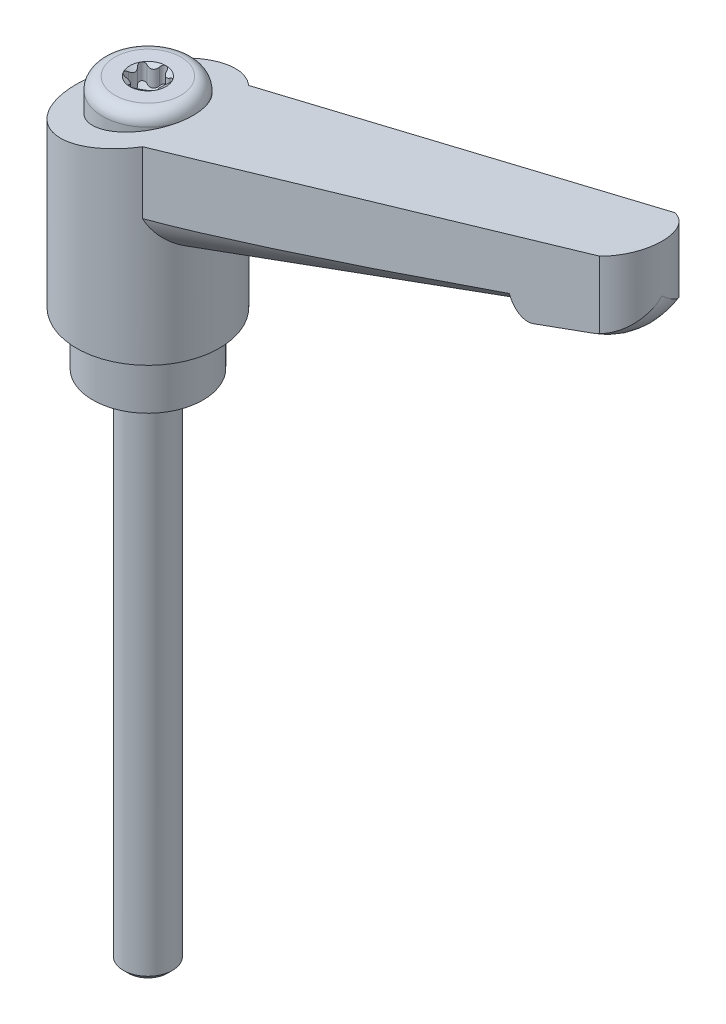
ISO-10303-21;
HEADER;
FILE_DESCRIPTION(('STEP AP214'),'2;1');
FILE_NAME('part.step','',(''),(''),'','','');
FILE_SCHEMA(('AUTOMOTIVE_DESIGN { 1 0 10303 214 1 1 1 1 }'));
ENDSEC;
DATA;
#1=APPLICATION_CONTEXT('core data for automotive mechanical design processes');
#2=APPLICATION_PROTOCOL_DEFINITION('international standard','automotive_design',2000,#1);
#3=PRODUCT_CONTEXT('',#1,'mechanical');
#4=PRODUCT('Part','Part','',(#3));
#5=PRODUCT_RELATED_PRODUCT_CATEGORY('part','',(#4));
#6=PRODUCT_DEFINITION_FORMATION('','',#4);
#7=PRODUCT_DEFINITION_CONTEXT('part definition',#1,'design');
#8=PRODUCT_DEFINITION('design','',#6,#7);
#9=PRODUCT_DEFINITION_SHAPE('','',#8);
#10=(LENGTH_UNIT() NAMED_UNIT(*) SI_UNIT(.MILLI.,.METRE.));
#11=(NAMED_UNIT(*) PLANE_ANGLE_UNIT() SI_UNIT($,.RADIAN.));
#12=(NAMED_UNIT(*) SI_UNIT($,.STERADIAN.) SOLID_ANGLE_UNIT());
#13=UNCERTAINTY_MEASURE_WITH_UNIT(LENGTH_MEASURE(1.E-05),#10,'distance_accuracy_value','');
#14=(GEOMETRIC_REPRESENTATION_CONTEXT(3) GLOBAL_UNCERTAINTY_ASSIGNED_CONTEXT((#13)) GLOBAL_UNIT_ASSIGNED_CONTEXT((#10,
#11,#12)) REPRESENTATION_CONTEXT('',''));
#15=CARTESIAN_POINT('',(0.,0.,0.));
#16=DIRECTION('',(0.,0.,1.));
#17=DIRECTION('',(1.,0.,0.));
#18=AXIS2_PLACEMENT_3D('',#15,#16,#17);
#19=CARTESIAN_POINT('',(1.53459701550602,27.,0.886000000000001));
#20=DIRECTION('',(0.,1.,0.));
#21=DIRECTION('',(0.,0.,1.));
#22=AXIS2_PLACEMENT_3D('',#19,#20,#21);
#23=CYLINDRICAL_SURFACE('',#22,0.443);
#24=DIRECTION('',(0.,1.,0.));
#25=VECTOR('',#24,1.);
#26=CARTESIAN_POINT('',(1.83864943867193,27.,0.563818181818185));
#27=LINE('',#26,#25);
#28=CARTESIAN_POINT('',(1.83864943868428,28.8315028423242,0.563818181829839));
#29=VERTEX_POINT('',#28);
#30=CARTESIAN_POINT('',(1.83864943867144,30.8315028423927,0.563818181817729));
#31=VERTEX_POINT('',#30);
#32=EDGE_CURVE('E187',#29,#31,#27,.T.);
#33=ORIENTED_EDGE('',*,*,#32,.F.);
#34=CARTESIAN_POINT('',(1.40760557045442,28.8315028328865,1.31040802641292));
#35=CARTESIAN_POINT('',(1.43210071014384,28.8447477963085,1.31775635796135));
#36=CARTESIAN_POINT('',(1.45748061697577,28.857597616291,1.32301894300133));
#37=CARTESIAN_POINT('',(1.50939354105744,28.8822631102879,1.32905299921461));
#38=CARTESIAN_POINT('',(1.53593128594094,28.8940738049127,1.32980389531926));
#39=CARTESIAN_POINT('',(1.58939185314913,28.916326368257,1.32641640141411));
#40=CARTESIAN_POINT('',(1.6163156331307,28.9267637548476,1.32226242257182));
#41=CARTESIAN_POINT('',(1.6694679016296,28.945880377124,1.30885630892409));
#42=CARTESIAN_POINT('',(1.69569771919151,28.9545632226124,1.29961479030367));
#43=CARTESIAN_POINT('',(1.74416106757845,28.9691875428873,1.27712730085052));
#44=CARTESIAN_POINT('',(1.76654208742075,28.9753049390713,1.26431433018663));
#45=CARTESIAN_POINT('',(1.80902319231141,28.9856214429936,1.23472360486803));
#46=CARTESIAN_POINT('',(1.82912382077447,28.9898210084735,1.217946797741));
#47=CARTESIAN_POINT('',(1.8644468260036,28.9958358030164,1.18266742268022));
#48=CARTESIAN_POINT('',(1.87995072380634,28.9978388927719,1.16447789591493));
#49=CARTESIAN_POINT('',(1.90786323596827,29.0000666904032,1.12577049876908));
#50=CARTESIAN_POINT('',(1.92027330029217,29.0002922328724,1.10525372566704));
#51=CARTESIAN_POINT('',(1.94108819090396,28.9989909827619,1.06356864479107));
#52=CARTESIAN_POINT('',(1.94965709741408,28.9975480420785,1.04247927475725));
#53=CARTESIAN_POINT('',(1.96343610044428,28.993092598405,0.99939142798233));
#54=CARTESIAN_POINT('',(1.96864617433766,28.9900800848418,0.977392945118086));
#55=CARTESIAN_POINT('',(1.97568144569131,28.9825486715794,0.932944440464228));
#56=CARTESIAN_POINT('',(1.97748072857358,28.9780185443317,0.910492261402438));
#57=CARTESIAN_POINT('',(1.97770242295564,28.9675868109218,0.865898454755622));
#58=CARTESIAN_POINT('',(1.97612450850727,28.9616850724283,0.843756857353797));
#59=CARTESIAN_POINT('',(1.96960698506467,28.9482940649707,0.799093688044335));
#60=CARTESIAN_POINT('',(1.96448424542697,28.940734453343,0.776620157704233));
#61=CARTESIAN_POINT('',(1.9510022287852,28.9244342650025,0.733110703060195));
#62=CARTESIAN_POINT('',(1.94264047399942,28.9156927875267,0.712075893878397));
#63=CARTESIAN_POINT('',(1.92216028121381,28.896380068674,0.670039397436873));
#64=CARTESIAN_POINT('',(1.9097697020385,28.8857147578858,0.649214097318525));
#65=CARTESIAN_POINT('',(1.88209462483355,28.8634511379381,0.610200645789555));
#66=CARTESIAN_POINT('',(1.86681439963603,28.851854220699,0.592008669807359));
#67=CARTESIAN_POINT('',(1.8465126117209,28.8371252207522,0.571376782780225));
#68=CARTESIAN_POINT('',(1.84261149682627,28.8343227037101,0.567556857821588));
#69=CARTESIAN_POINT('',(1.83864943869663,28.831502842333,0.563818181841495));
#70=B_SPLINE_CURVE_WITH_KNOTS('',3,(#34,#35,#36,#37,#38,#39,#40,#41,#42,#43,#44,#45,#46,#47,#48,
#49,#50,#51,#52,#53,#54,#55,#56,#57,#58,#59,#60,#61,#62,#63,#64,#65,#66,#67,#68,#69),
.UNSPECIFIED.,.F.,.F.,(4,2,2,2,2,2,2,2,2,2,2,2,2,2,2,2,2,4),(0.,0.0863713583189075,
0.173136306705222,0.260177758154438,0.347038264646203,0.426115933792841,0.505174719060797,
0.576760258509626,0.648312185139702,0.71641889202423,0.784526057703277,0.853148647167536,
0.921777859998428,0.99424651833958,1.06677072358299,1.14587928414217,1.22487177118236,
1.24327909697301),.UNSPECIFIED.);
#71=CARTESIAN_POINT('',(1.40760557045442,28.8315028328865,1.31040802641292));
#72=VERTEX_POINT('',#71);
#73=EDGE_CURVE('E188',#72,#29,#70,.T.);
#74=ORIENTED_EDGE('',*,*,#73,.F.);
#75=DIRECTION('',(0.,1.,0.));
#76=VECTOR('',#75,1.);
#77=CARTESIAN_POINT('',(1.40760557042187,27.,1.31040802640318));
#78=LINE('',#77,#76);
#79=CARTESIAN_POINT('',(1.40760557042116,30.8315028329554,1.31040802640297));
#80=VERTEX_POINT('',#79);
#81=EDGE_CURVE('E212',#80,#72,#78,.F.);
#82=ORIENTED_EDGE('',*,*,#81,.F.);
#83=CARTESIAN_POINT('',(1.91824626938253,31.0000000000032,1.1075));
#84=CARTESIAN_POINT('',(1.906667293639,31.0000094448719,1.12761045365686));
#85=CARTESIAN_POINT('',(1.89347208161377,30.9991586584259,1.14676721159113));
#86=CARTESIAN_POINT('',(1.86439253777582,30.9958118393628,1.1826633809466));
#87=CARTESIAN_POINT('',(1.84851632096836,30.993320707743,1.19940981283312));
#88=CARTESIAN_POINT('',(1.81454830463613,30.9867685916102,1.23009586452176));
#89=CARTESIAN_POINT('',(1.79645716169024,30.9827080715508,1.24403631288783));
#90=CARTESIAN_POINT('',(1.75862707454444,30.9731405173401,1.26884607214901));
#91=CARTESIAN_POINT('',(1.73888757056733,30.9676329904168,1.27971433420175));
#92=CARTESIAN_POINT('',(1.69766423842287,30.9551138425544,1.29853923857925));
#93=CARTESIAN_POINT('',(1.67614422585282,30.9480582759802,1.3063869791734));
#94=CARTESIAN_POINT('',(1.63255624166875,30.9327355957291,1.31862689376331));
#95=CARTESIAN_POINT('',(1.61048794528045,30.9244677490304,1.32301696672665));
#96=CARTESIAN_POINT('',(1.56443830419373,30.9061413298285,1.32865366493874));
#97=CARTESIAN_POINT('',(1.54045694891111,30.8959896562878,1.32959482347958));
#98=CARTESIAN_POINT('',(1.49312012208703,30.8747062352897,1.32768899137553));
#99=CARTESIAN_POINT('',(1.46976415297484,30.8635752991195,1.32484510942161));
#100=CARTESIAN_POINT('',(1.43363861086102,30.8453326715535,1.31755783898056));
#101=CARTESIAN_POINT('',(1.42050076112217,30.8384715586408,1.31426920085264));
#102=CARTESIAN_POINT('',(1.40760557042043,30.831502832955,1.31040802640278));
#103=B_SPLINE_CURVE_WITH_KNOTS('',3,(#83,#84,#85,#86,#87,#88,#89,#90,#91,#92,#93,#94,#95,#96,
#97,#98,#99,#100,#101,#102),.UNSPECIFIED.,.F.,.F.,(4,2,2,2,2,2,2,2,2,4),(0.,0.0695001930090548,
0.138793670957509,0.208066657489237,0.277363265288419,0.348965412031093,0.420611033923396,
0.498467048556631,0.576259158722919,0.621744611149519),.UNSPECIFIED.);
#104=CARTESIAN_POINT('',(1.91824626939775,31.0000000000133,1.10750000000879));
#105=VERTEX_POINT('',#104);
#106=EDGE_CURVE('E20',#105,#80,#103,.T.);
#107=ORIENTED_EDGE('',*,*,#106,.F.);
#108=CARTESIAN_POINT('',(1.83864943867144,30.8315028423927,0.56381818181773));
#109=CARTESIAN_POINT('',(1.8572576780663,30.844745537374,0.581354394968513));
#110=CARTESIAN_POINT('',(1.87450246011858,30.8575932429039,0.600699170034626));
#111=CARTESIAN_POINT('',(1.90568571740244,30.8822591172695,0.642639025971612));
#112=CARTESIAN_POINT('',(1.91960758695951,30.894071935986,0.665249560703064));
#113=CARTESIAN_POINT('',(1.94340691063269,30.916326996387,0.713246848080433));
#114=CARTESIAN_POINT('',(1.95327180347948,30.9267649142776,0.738641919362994));
#115=CARTESIAN_POINT('',(1.96823731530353,30.9458813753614,0.791376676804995));
#116=CARTESIAN_POINT('',(1.97334832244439,30.9545637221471,0.818711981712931));
#117=CARTESIAN_POINT('',(1.97810579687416,30.9691889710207,0.871929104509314));
#118=CARTESIAN_POINT('',(1.97819974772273,30.9753073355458,0.897722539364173));
#119=CARTESIAN_POINT('',(1.97381135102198,30.9856234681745,0.949310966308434));
#120=CARTESIAN_POINT('',(1.96933204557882,30.9898225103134,0.975105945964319));
#121=CARTESIAN_POINT('',(1.95758987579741,30.9953007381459,1.01903441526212));
#122=CARTESIAN_POINT('',(1.95137244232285,30.9970578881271,1.03739460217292));
#123=CARTESIAN_POINT('',(1.93656393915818,30.9994094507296,1.07321574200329));
#124=CARTESIAN_POINT('',(1.92797210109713,31.0000034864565,1.09067640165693));
#125=CARTESIAN_POINT('',(1.91824626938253,31.0000000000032,1.1075));
#126=B_SPLINE_CURVE_WITH_KNOTS('',3,(#108,#109,#110,#111,#112,#113,#114,#115,#116,#117,#118,
#119,#120,#121,#122,#123,#124,#125),.UNSPECIFIED.,.F.,.F.,(4,2,2,2,2,2,2,2,4),(0.,
0.0863566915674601,0.173136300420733,0.260182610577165,0.347038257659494,0.42613277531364,
0.505174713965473,0.563374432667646,0.621593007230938),.UNSPECIFIED.);
#127=EDGE_CURVE('E176',#31,#105,#126,.T.);
#128=ORIENTED_EDGE('',*,*,#127,.F.);
#129=EDGE_LOOP('',(#33,#74,#82,#107,#128));
#130=FACE_BOUND('',#129,.T.);
#131=ADVANCED_FACE('F16',(#130),#23,.F.);
#132=CARTESIAN_POINT('',(2.37074117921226,27.,0.));
#133=DIRECTION('',(0.,1.,0.));
#134=DIRECTION('',(0.,0.,1.));
#135=AXIS2_PLACEMENT_3D('',#132,#133,#134);
#136=CYLINDRICAL_SURFACE('',#135,0.77525);
#137=DIRECTION('',(0.,1.,0.));
#138=VECTOR('',#137,1.);
#139=CARTESIAN_POINT('',(1.83864943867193,27.,-0.56381818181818));
#140=LINE('',#139,#138);
#141=CARTESIAN_POINT('',(1.83864943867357,30.8315028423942,-0.56381818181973));
#142=VERTEX_POINT('',#141);
#143=CARTESIAN_POINT('',(1.83864943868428,28.8315028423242,-0.563818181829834));
#144=VERTEX_POINT('',#143);
#145=EDGE_CURVE('E407',#142,#144,#140,.F.);
#146=ORIENTED_EDGE('',*,*,#145,.T.);
#147=CARTESIAN_POINT('',(1.83864943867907,28.8315028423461,-0.563818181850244));
#148=CARTESIAN_POINT('',(1.80915300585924,28.8105445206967,-0.53598682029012));
#149=CARTESIAN_POINT('',(1.7814886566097,28.7902259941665,-0.505493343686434));
#150=CARTESIAN_POINT('',(1.73058626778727,28.751896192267,-0.439285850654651));
#151=CARTESIAN_POINT('',(1.70738543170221,28.7339046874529,-0.403531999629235));
#152=CARTESIAN_POINT('',(1.67019355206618,28.7044191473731,-0.333946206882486));
#153=CARTESIAN_POINT('',(1.65530380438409,28.6923395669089,-0.300849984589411));
#154=CARTESIAN_POINT('',(1.630122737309,28.6716281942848,-0.232021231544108));
#155=CARTESIAN_POINT('',(1.61981761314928,28.6629860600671,-0.196296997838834));
#156=CARTESIAN_POINT('',(1.60432487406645,28.6498980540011,-0.122654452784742));
#157=CARTESIAN_POINT('',(1.59918123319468,28.6454882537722,-0.0847201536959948));
#158=CARTESIAN_POINT('',(1.59459047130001,28.6415559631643,-0.00824210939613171));
#159=CARTESIAN_POINT('',(1.59514288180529,28.6420330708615,0.030301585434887));
#160=CARTESIAN_POINT('',(1.60146702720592,28.6474413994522,0.101762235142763));
#161=CARTESIAN_POINT('',(1.60658332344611,28.6518131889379,0.134784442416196));
#162=CARTESIAN_POINT('',(1.62082381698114,28.6638273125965,0.199321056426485));
#163=CARTESIAN_POINT('',(1.62994854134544,28.6714700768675,0.230835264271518));
#164=CARTESIAN_POINT('',(1.65234234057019,28.6899169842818,0.293391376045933));
#165=CARTESIAN_POINT('',(1.66580585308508,28.7008675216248,0.32431922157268));
#166=CARTESIAN_POINT('',(1.69616628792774,28.7250583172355,0.383495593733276));
#167=CARTESIAN_POINT('',(1.71306681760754,28.7383009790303,0.411741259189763));
#168=CARTESIAN_POINT('',(1.74731799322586,28.7645480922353,0.461676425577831));
#169=CARTESIAN_POINT('',(1.76429766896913,28.777341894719,0.483735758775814));
#170=CARTESIAN_POINT('',(1.80012754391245,28.8038211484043,0.525514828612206));
#171=CARTESIAN_POINT('',(1.81897016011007,28.8175029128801,0.545243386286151));
#172=CARTESIAN_POINT('',(1.83864943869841,28.8315028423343,0.563818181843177));
#173=B_SPLINE_CURVE_WITH_KNOTS('',3,(#147,#148,#149,#150,#151,#152,#153,#154,#155,#156,#157,
#158,#159,#160,#161,#162,#163,#164,#165,#166,#167,#168,#169,#170,#171,#172),.UNSPECIFIED.,.F.,
.F.,(4,2,2,2,2,2,2,2,2,2,2,2,4),(0.,0.137065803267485,0.275228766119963,0.389514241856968,
0.503453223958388,0.618354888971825,0.733247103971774,0.833898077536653,0.934562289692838,
1.04057496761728,1.146699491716,1.23845086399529,1.32984304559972),.UNSPECIFIED.);
#174=EDGE_CURVE('E242',#144,#29,#173,.T.);
#175=ORIENTED_EDGE('',*,*,#174,.T.);
#176=ORIENTED_EDGE('',*,*,#32,.T.);
#177=CARTESIAN_POINT('',(1.83864943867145,30.8315028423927,0.563818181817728));
#178=CARTESIAN_POINT('',(1.80915300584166,30.8105445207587,0.535986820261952));
#179=CARTESIAN_POINT('',(1.78148865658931,30.7902259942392,0.505493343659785));
#180=CARTESIAN_POINT('',(1.73058626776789,30.7518961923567,0.439285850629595));
#181=CARTESIAN_POINT('',(1.70738543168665,30.7339046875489,0.403531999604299));
#182=CARTESIAN_POINT('',(1.67019355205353,30.704419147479,0.333946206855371));
#183=CARTESIAN_POINT('',(1.65530380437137,30.6923395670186,0.300849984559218));
#184=CARTESIAN_POINT('',(1.63012273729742,30.6716281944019,0.232021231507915));
#185=CARTESIAN_POINT('',(1.61981761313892,30.6629860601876,0.196296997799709));
#186=CARTESIAN_POINT('',(1.60432487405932,30.6498980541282,0.122654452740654));
#187=CARTESIAN_POINT('',(1.59918123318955,30.6454882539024,0.0847201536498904));
#188=CARTESIAN_POINT('',(1.5945904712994,30.6415559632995,0.00824210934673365));
#189=CARTESIAN_POINT('',(1.5951428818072,30.6420330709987,-0.0303015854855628));
#190=CARTESIAN_POINT('',(1.60146702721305,30.6474413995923,-0.101762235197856));
#191=CARTESIAN_POINT('',(1.60658332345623,30.6518131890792,-0.134784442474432));
#192=CARTESIAN_POINT('',(1.62082381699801,30.6638273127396,-0.199321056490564));
#193=CARTESIAN_POINT('',(1.62994854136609,30.6714700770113,-0.230835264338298));
#194=CARTESIAN_POINT('',(1.65234234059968,30.6899169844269,-0.293391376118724));
#195=CARTESIAN_POINT('',(1.66580585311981,30.7008675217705,-0.324319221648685));
#196=CARTESIAN_POINT('',(1.69616628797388,30.7250583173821,-0.383495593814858));
#197=CARTESIAN_POINT('',(1.71306681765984,30.7383009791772,-0.411741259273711));
#198=CARTESIAN_POINT('',(1.74731799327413,30.7645480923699,-0.461676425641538));
#199=CARTESIAN_POINT('',(1.76429766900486,30.7773418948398,-0.483735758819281));
#200=CARTESIAN_POINT('',(1.80012754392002,30.8038211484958,-0.525514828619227));
#201=CARTESIAN_POINT('',(1.81897016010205,30.817502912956,-0.545243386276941));
#202=CARTESIAN_POINT('',(1.83864943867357,30.8315028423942,-0.56381818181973));
#203=B_SPLINE_CURVE_WITH_KNOTS('',3,(#177,#178,#179,#180,#181,#182,#183,#184,#185,#186,#187,
#188,#189,#190,#191,#192,#193,#194,#195,#196,#197,#198,#199,#200,#201,#202),.UNSPECIFIED.,.F.,
.F.,(4,2,2,2,2,2,2,2,2,2,2,2,4),(0.,0.137065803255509,0.275228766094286,0.389514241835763,
0.50345322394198,0.618354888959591,0.733247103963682,0.833898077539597,0.93456228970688,
1.04057496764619,1.14669949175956,1.23845086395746,1.32984304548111),.UNSPECIFIED.);
#204=EDGE_CURVE('E182',#31,#142,#203,.T.);
#205=ORIENTED_EDGE('',*,*,#204,.T.);
#206=EDGE_LOOP('',(#146,#175,#176,#205));
#207=FACE_BOUND('',#206,.T.);
#208=ADVANCED_FACE('F349',(#207),#136,.T.);
#209=CARTESIAN_POINT('',(1.18537058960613,27.,2.0531220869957));
#210=DIRECTION('',(0.,1.,0.));
#211=DIRECTION('',(0.,0.,1.));
#212=AXIS2_PLACEMENT_3D('',#209,#210,#211);
#213=CYLINDRICAL_SURFACE('',#212,0.775250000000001);
#214=ORIENTED_EDGE('',*,*,#81,.T.);
#215=CARTESIAN_POINT('',(1.40760557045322,28.8315028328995,1.31040802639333));
#216=CARTESIAN_POINT('',(1.36875468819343,28.8105445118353,1.29877904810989));
#217=CARTESIAN_POINT('',(1.32851438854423,28.7902259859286,1.29006775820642));
#218=CARTESIAN_POINT('',(1.2457258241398,28.751896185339,1.2790887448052));
#219=CARTESIAN_POINT('',(1.20316166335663,28.7339046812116,1.27687315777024));
#220=CARTESIAN_POINT('',(1.12430266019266,28.7044191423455,1.27945694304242));
#221=CARTESIAN_POINT('',(1.08819561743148,28.6923395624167,1.28311015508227));
#222=CARTESIAN_POINT('',(1.0159976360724,28.6716281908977,1.29571708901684));
#223=CARTESIAN_POINT('',(0.979906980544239,28.6629860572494,1.30465470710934));
#224=CARTESIAN_POINT('',(0.90838429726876,28.6498980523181,1.32805887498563));
#225=CARTESIAN_POINT('',(0.872960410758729,28.6454882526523,1.34257150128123));
#226=CARTESIAN_POINT('',(0.804433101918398,28.641555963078,1.37683480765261));
#227=CARTESIAN_POINT('',(0.77132948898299,28.6420330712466,1.39658505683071));
#228=CARTESIAN_POINT('',(0.712604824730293,28.6474414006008,1.43779225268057));
#229=CARTESIAN_POINT('',(0.686564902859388,28.6518131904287,1.45873419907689));
#230=CARTESIAN_POINT('',(0.637794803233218,28.6638273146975,1.50333513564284));
#231=CARTESIAN_POINT('',(0.615065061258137,28.6714700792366,1.52699448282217));
#232=CARTESIAN_POINT('',(0.572086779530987,28.6899169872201,1.57766613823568));
#233=CARTESIAN_POINT('',(0.552034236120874,28.7008675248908,1.60478980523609));
#234=CARTESIAN_POINT('',(0.515966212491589,28.7250583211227,1.66067089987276));
#235=CARTESIAN_POINT('',(0.499955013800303,28.7383009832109,1.68943002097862));
#236=CARTESIAN_POINT('',(0.473835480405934,28.7645480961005,1.74405999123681));
#237=CARTESIAN_POINT('',(0.46322137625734,28.777341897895,1.76979448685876));
#238=CARTESIAN_POINT('',(0.444954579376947,28.8038211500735,1.82171360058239));
#239=CARTESIAN_POINT('',(0.437290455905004,28.8175029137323,1.84789606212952));
#240=CARTESIAN_POINT('',(0.431043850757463,28.8315028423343,1.87422621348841));
#241=B_SPLINE_CURVE_WITH_KNOTS('',3,(#215,#216,#217,#218,#219,#220,#221,#222,#223,#224,#225,
#226,#227,#228,#229,#230,#231,#232,#233,#234,#235,#236,#237,#238,#239,#240),.UNSPECIFIED.,.F.,
.F.,(4,2,2,2,2,2,2,2,2,2,2,2,4),(0.,0.137065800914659,0.275228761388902,0.38951423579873,
0.503453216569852,0.618354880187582,0.733247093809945,0.833898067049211,0.934562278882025,
1.04057495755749,1.14669948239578,1.23845084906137,1.32984302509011),.UNSPECIFIED.);
#242=CARTESIAN_POINT('',(0.431043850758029,28.831502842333,1.87422621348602));
#243=VERTEX_POINT('',#242);
#244=EDGE_CURVE('E328',#72,#243,#241,.T.);
#245=ORIENTED_EDGE('',*,*,#244,.T.);
#246=DIRECTION('',(0.,1.,0.));
#247=VECTOR('',#246,1.);
#248=CARTESIAN_POINT('',(0.431043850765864,27.,1.87422621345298));
#249=LINE('',#248,#247);
#250=CARTESIAN_POINT('',(0.431043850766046,30.8315028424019,1.87422621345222));
#251=VERTEX_POINT('',#250);
#252=EDGE_CURVE('E381',#243,#251,#249,.T.);
#253=ORIENTED_EDGE('',*,*,#252,.T.);
#254=CARTESIAN_POINT('',(0.431043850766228,30.8315028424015,1.87422621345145));
#255=CARTESIAN_POINT('',(0.440398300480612,30.8105445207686,1.83476587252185));
#256=CARTESIAN_POINT('',(0.452974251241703,30.7902259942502,1.79556110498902));
#257=CARTESIAN_POINT('',(0.484860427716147,30.7518961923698,1.71837459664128));
#258=CARTESIAN_POINT('',(0.504223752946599,30.733904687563,1.6804051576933));
#259=CARTESIAN_POINT('',(0.545890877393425,30.7044191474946,1.61340314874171));
#260=CARTESIAN_POINT('',(0.567108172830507,30.6923395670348,1.58396013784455));
#261=CARTESIAN_POINT('',(0.614125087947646,30.671628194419,1.52773831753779));
#262=CARTESIAN_POINT('',(0.639910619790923,30.6629860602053,1.50095170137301));
#263=CARTESIAN_POINT('',(0.695940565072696,30.6498980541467,1.45071332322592));
#264=CARTESIAN_POINT('',(0.726220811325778,30.6454882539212,1.42729165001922));
#265=CARTESIAN_POINT('',(0.790157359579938,30.6415559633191,1.38507691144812));
#266=CARTESIAN_POINT('',(0.823813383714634,30.6420330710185,1.36628346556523));
#267=CARTESIAN_POINT('',(0.888862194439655,30.6474413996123,1.33603001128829));
#268=CARTESIAN_POINT('',(0.920018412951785,30.6518131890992,1.32394975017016));
#269=CARTESIAN_POINT('',(0.983029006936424,30.6638273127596,1.3040140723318));
#270=CARTESIAN_POINT('',(1.01488347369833,30.6714700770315,1.29615921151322));
#271=CARTESIAN_POINT('',(1.08025555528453,30.6899169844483,1.2842747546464));
#272=CARTESIAN_POINT('',(1.11377161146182,30.7008675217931,1.28047057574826));
#273=CARTESIAN_POINT('',(1.18020007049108,30.7250583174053,1.27717529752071));
#274=CARTESIAN_POINT('',(1.2131117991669,30.7383009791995,1.2776887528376));
#275=CARTESIAN_POINT('',(1.27348250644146,30.7645480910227,1.28238355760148));
#276=CARTESIAN_POINT('',(1.30107628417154,30.7773418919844,1.28605872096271));
#277=CARTESIAN_POINT('',(1.35517295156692,30.8038211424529,1.29619876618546));
#278=CARTESIAN_POINT('',(1.38167968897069,30.8175029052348,1.3026526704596));
#279=CARTESIAN_POINT('',(1.40760557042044,30.831502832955,1.31040802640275));
#280=B_SPLINE_CURVE_WITH_KNOTS('',3,(#254,#255,#256,#257,#258,#259,#260,#261,#262,#263,#264,
#265,#266,#267,#268,#269,#270,#271,#272,#273,#274,#275,#276,#277,#278,#279),.UNSPECIFIED.,.F.,
.F.,(4,2,2,2,2,2,2,2,2,2,2,2,4),(0.,0.137065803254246,0.275228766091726,0.389514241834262,
0.503453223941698,0.618354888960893,0.733247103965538,0.833898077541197,0.934562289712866,
1.04057496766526,1.14669949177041,1.23845085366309,1.32984302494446),.UNSPECIFIED.);
#281=EDGE_CURVE('E340',#251,#80,#280,.T.);
#282=ORIENTED_EDGE('',*,*,#281,.T.);
#283=EDGE_LOOP('',(#214,#245,#253,#282));
#284=FACE_BOUND('',#283,.T.);
#285=ADVANCED_FACE('F345',(#284),#213,.T.);
#286=CARTESIAN_POINT('',(1.53459701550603,27.,-0.886));
#287=DIRECTION('',(0.,1.,0.));
#288=DIRECTION('',(0.,0.,1.));
#289=AXIS2_PLACEMENT_3D('',#286,#287,#288);
#290=CYLINDRICAL_SURFACE('',#289,0.443);
#291=DIRECTION('',(0.,1.,0.));
#292=VECTOR('',#291,1.);
#293=CARTESIAN_POINT('',(1.40760558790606,27.,-1.31040803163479));
#294=LINE('',#293,#292);
#295=CARTESIAN_POINT('',(1.40760558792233,28.8315028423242,-1.31040803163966));
#296=VERTEX_POINT('',#295);
#297=CARTESIAN_POINT('',(1.40760558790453,30.8315028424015,-1.31040803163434));
#298=VERTEX_POINT('',#297);
#299=EDGE_CURVE('E380',#296,#298,#294,.T.);
#300=ORIENTED_EDGE('',*,*,#299,.F.);
#301=CARTESIAN_POINT('',(1.83864943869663,28.831502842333,-0.563818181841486));
#302=CARTESIAN_POINT('',(1.85726084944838,28.844747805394,-0.581357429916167));
#303=CARTESIAN_POINT('',(1.87450833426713,28.8575976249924,-0.600705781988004));
#304=CARTESIAN_POINT('',(1.90569044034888,28.8822631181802,-0.642646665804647));
#305=CARTESIAN_POINT('',(1.91960960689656,28.8940738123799,-0.665253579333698));
#306=CARTESIAN_POINT('',(1.94340623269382,28.9163263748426,-0.713245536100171));
#307=CARTESIAN_POINT('',(1.95327067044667,28.9267637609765,-0.738639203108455));
#308=CARTESIAN_POINT('',(1.96823676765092,28.9458803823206,-0.791373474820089));
#309=CARTESIAN_POINT('',(1.9733482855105,28.9545632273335,-0.81870992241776));
#310=CARTESIAN_POINT('',(1.97810522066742,28.9691875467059,-0.871924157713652));
#311=CARTESIAN_POINT('',(1.97819937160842,28.975304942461,-0.897713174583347));
#312=CARTESIAN_POINT('',(1.97381360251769,28.9856214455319,-0.949298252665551));
#313=CARTESIAN_POINT('',(1.96933477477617,28.9898210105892,-0.975094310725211));
#314=CARTESIAN_POINT('',(1.95644344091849,28.9958358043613,-1.02332461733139));
#315=CARTESIAN_POINT('',(1.94844279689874,28.9978388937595,-1.04584614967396));
#316=CARTESIAN_POINT('',(1.92887746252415,29.0000666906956,-1.08937279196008));
#317=CARTESIAN_POINT('',(1.91731444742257,29.0002922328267,-1.11037860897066));
#318=CARTESIAN_POINT('',(1.89162155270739,28.9989909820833,-1.14924737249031));
#319=CARTESIAN_POINT('',(1.87764207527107,28.9975480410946,-1.16721294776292));
#320=CARTESIAN_POINT('',(1.84721640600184,28.9930925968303,-1.20068983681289));
#321=CARTESIAN_POINT('',(1.8307701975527,28.9900800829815,-1.21620113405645));
#322=CARTESIAN_POINT('',(1.79579429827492,28.982548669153,-1.24451810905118));
#323=CARTESIAN_POINT('',(1.7772497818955,28.9780185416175,-1.25730242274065));
#324=CARTESIAN_POINT('',(1.73874125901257,28.9675868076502,-1.27979131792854));
#325=CARTESIAN_POINT('',(1.71877711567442,28.9616850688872,-1.289495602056));
#326=CARTESIAN_POINT('',(1.67683891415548,28.9482940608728,-1.30618284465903));
#327=CARTESIAN_POINT('',(1.65481489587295,28.940734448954,-1.3129831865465));
#328=CARTESIAN_POINT('',(1.61039359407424,28.9244342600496,-1.32306214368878));
#329=CARTESIAN_POINT('',(1.58799603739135,28.9156927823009,-1.32633805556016));
#330=CARTESIAN_POINT('',(1.54135126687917,28.8963800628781,-1.32961993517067));
#331=CARTESIAN_POINT('',(1.51712073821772,28.8857147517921,-1.32930202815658));
#332=CARTESIAN_POINT('',(1.46949655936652,28.8634511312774,-1.32484143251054));
#333=CARTESIAN_POINT('',(1.44610173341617,28.8518542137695,-1.32070435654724));
#334=CARTESIAN_POINT('',(1.41808310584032,28.837125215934,-1.31343843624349));
#335=CARTESIAN_POINT('',(1.41282440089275,28.834322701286,-1.31196993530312));
#336=CARTESIAN_POINT('',(1.40760558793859,28.831502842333,-1.31040803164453));
#337=B_SPLINE_CURVE_WITH_KNOTS('',3,(#301,#302,#303,#304,#305,#306,#307,#308,#309,#310,#311,
#312,#313,#314,#315,#316,#317,#318,#319,#320,#321,#322,#323,#324,#325,#326,#327,#328,#329,#330,
#331,#332,#333,#334,#335,#336),.UNSPECIFIED.,.F.,.F.,(4,2,2,2,2,2,2,2,2,2,2,2,2,2,2,2,2,4),(0.,
0.0863713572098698,0.17313630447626,0.260177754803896,0.34703826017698,0.426115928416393,
0.505174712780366,0.576760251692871,0.648312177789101,0.716418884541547,0.784526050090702,
0.853148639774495,0.921777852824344,0.994246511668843,1.06677071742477,1.14587927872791,
1.22487176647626,1.24327907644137),.UNSPECIFIED.);
#338=EDGE_CURVE('E319',#144,#296,#337,.T.);
#339=ORIENTED_EDGE('',*,*,#338,.F.);
#340=ORIENTED_EDGE('',*,*,#145,.F.);
#341=CARTESIAN_POINT('',(1.91824626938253,31.0000000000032,-1.1075));
#342=CARTESIAN_POINT('',(1.92987294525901,31.0000094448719,-1.08741708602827));
#343=CARTESIAN_POINT('',(1.93986557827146,30.9991586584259,-1.06641131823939));
#344=CARTESIAN_POINT('',(1.95641280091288,30.9958118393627,-1.02327960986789));
#345=CARTESIAN_POINT('',(1.96297752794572,30.9933207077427,-1.00115718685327));
#346=CARTESIAN_POINT('',(1.97256842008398,30.9867685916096,-0.956396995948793));
#347=CARTESIAN_POINT('',(1.97559563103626,30.98270807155,-0.933759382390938));
#348=CARTESIAN_POINT('',(1.97816646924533,30.9731405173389,-0.88859268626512));
#349=CARTESIAN_POINT('',(1.9777089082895,30.9676329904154,-0.866063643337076));
#350=CARTESIAN_POINT('',(1.97340008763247,30.9551138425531,-0.820950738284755));
#351=CARTESIAN_POINT('',(1.96943642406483,30.948058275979,-0.798389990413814));
#352=CARTESIAN_POINT('',(1.95824250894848,30.9327355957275,-0.754521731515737));
#353=CARTESIAN_POINT('',(1.95101027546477,30.9244677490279,-0.733214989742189));
#354=CARTESIAN_POINT('',(1.93286697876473,30.9061413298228,-0.690516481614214));
#355=CARTESIAN_POINT('',(1.92169136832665,30.8959896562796,-0.669277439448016));
#356=CARTESIAN_POINT('',(1.89637245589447,30.8747062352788,-0.629235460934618));
#357=CARTESIAN_POINT('',(1.88223159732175,30.863575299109,-0.610430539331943));
#358=CARTESIAN_POINT('',(1.85785786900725,30.8453326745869,-0.582788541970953));
#359=CARTESIAN_POINT('',(1.84844090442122,30.8384715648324,-0.573055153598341));
#360=CARTESIAN_POINT('',(1.83864943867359,30.8315028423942,-0.563818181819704));
#361=B_SPLINE_CURVE_WITH_KNOTS('',3,(#341,#342,#343,#344,#345,#346,#347,#348,#349,#350,#351,
#352,#353,#354,#355,#356,#357,#358,#359,#360),.UNSPECIFIED.,.F.,.F.,(4,2,2,2,2,2,2,2,2,4),(0.,
0.069500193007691,0.138793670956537,0.20806665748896,0.277363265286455,0.348965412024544,
0.420611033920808,0.498467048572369,0.576259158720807,0.621744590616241),.UNSPECIFIED.);
#362=CARTESIAN_POINT('',(1.91824626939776,31.0000000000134,-1.10750000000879));
#363=VERTEX_POINT('',#362);
#364=EDGE_CURVE('E335',#363,#142,#361,.T.);
#365=ORIENTED_EDGE('',*,*,#364,.F.);
#366=CARTESIAN_POINT('',(1.40760558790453,30.8315028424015,-1.31040803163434));
#367=CARTESIAN_POINT('',(1.43209651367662,30.844745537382,-1.31775513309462));
#368=CARTESIAN_POINT('',(1.45747197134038,30.8575932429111,-1.3230171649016));
#369=CARTESIAN_POINT('',(1.50938458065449,30.8822591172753,-1.32905272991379));
#370=CARTESIAN_POINT('',(1.53592681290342,30.8940719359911,-1.32980415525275));
#371=CARTESIAN_POINT('',(1.58939334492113,30.9163269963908,-1.32641633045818));
#372=CARTESIAN_POINT('',(1.6163185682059,30.9267649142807,-1.322262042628));
#373=CARTESIAN_POINT('',(1.66947096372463,30.9458813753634,-1.30885517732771));
#374=CARTESIAN_POINT('',(1.69569953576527,30.9545637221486,-1.29961378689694));
#375=CARTESIAN_POINT('',(1.74416565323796,30.9691889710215,-1.27712531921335));
#376=CARTESIAN_POINT('',(1.76655039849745,30.9753073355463,-1.26430996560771));
#377=CARTESIAN_POINT('',(1.80903308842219,30.9856234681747,-1.23471528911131));
#378=CARTESIAN_POINT('',(1.82913254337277,30.9898225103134,-1.21793860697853));
#379=CARTESIAN_POINT('',(1.86130462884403,30.9953007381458,-1.18580535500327));
#380=CARTESIAN_POINT('',(1.87409630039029,30.9970578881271,-1.17124080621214));
#381=CARTESIAN_POINT('',(1.89771406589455,30.9994094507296,-1.14050569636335));
#382=CARTESIAN_POINT('',(1.90853952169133,31.0000034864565,-1.12433461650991));
#383=CARTESIAN_POINT('',(1.91824626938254,31.0000000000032,-1.1075));
#384=B_SPLINE_CURVE_WITH_KNOTS('',3,(#366,#367,#368,#369,#370,#371,#372,#373,#374,#375,#376,
#377,#378,#379,#380,#381,#382,#383),.UNSPECIFIED.,.F.,.F.,(4,2,2,2,2,2,2,2,4),(0.,
0.0863566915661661,0.173136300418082,0.260182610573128,0.347038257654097,0.426132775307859,
0.505174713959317,0.563374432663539,0.621593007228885),.UNSPECIFIED.);
#385=EDGE_CURVE('E400',#298,#363,#384,.T.);
#386=ORIENTED_EDGE('',*,*,#385,.F.);
#387=EDGE_LOOP('',(#300,#339,#340,#365,#386));
#388=FACE_BOUND('',#387,.T.);
#389=ADVANCED_FACE('F348',(#388),#290,.F.);
#390=CARTESIAN_POINT('',(0.,27.,1.772));
#391=DIRECTION('',(0.,1.,0.));
#392=DIRECTION('',(0.,0.,1.));
#393=AXIS2_PLACEMENT_3D('',#390,#391,#392);
#394=CYLINDRICAL_SURFACE('',#393,0.443);
#395=ORIENTED_EDGE('',*,*,#252,.F.);
#396=CARTESIAN_POINT('',(-0.431043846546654,28.8315028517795,1.87422623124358));
#397=CARTESIAN_POINT('',(-0.425160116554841,28.8447478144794,1.89911380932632));
#398=CARTESIAN_POINT('',(-0.417027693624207,28.8575976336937,1.92372474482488));
#399=CARTESIAN_POINT('',(-0.396296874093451,28.8822631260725,1.97169968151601));
#400=CARTESIAN_POINT('',(-0.383678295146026,28.8940738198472,1.99505748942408));
#401=CARTESIAN_POINT('',(-0.354014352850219,28.9163263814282,2.03966194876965));
#402=CARTESIAN_POINT('',(-0.336955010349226,28.9267637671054,2.06090163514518));
#403=CARTESIAN_POINT('',(-0.298768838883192,28.9458803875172,2.10022978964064));
#404=CARTESIAN_POINT('',(-0.277650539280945,28.9545632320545,2.11832471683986));
#405=CARTESIAN_POINT('',(-0.233944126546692,28.9691875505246,2.14905145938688));
#406=CARTESIAN_POINT('',(-0.211657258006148,28.9753049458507,2.16202750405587));
#407=CARTESIAN_POINT('',(-0.164790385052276,28.9856214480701,2.18402185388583));
#408=CARTESIAN_POINT('',(-0.140210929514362,28.989821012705,2.19304110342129));
#409=CARTESIAN_POINT('',(-0.0919965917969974,28.9958358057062,2.20599203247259));
#410=CARTESIAN_POINT('',(-0.0684920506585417,28.9978388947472,2.21032403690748));
#411=CARTESIAN_POINT('',(-0.0210142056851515,29.000066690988,2.21514327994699));
#412=CARTESIAN_POINT('',(0.0029588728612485,29.000292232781,2.21563232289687));
#413=CARTESIAN_POINT('',(0.0494666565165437,28.9989909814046,2.21281600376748));
#414=CARTESIAN_POINT('',(0.072015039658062,28.9975480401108,2.20969220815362));
#415=CARTESIAN_POINT('',(0.116219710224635,28.9930925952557,2.20008124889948));
#416=CARTESIAN_POINT('',(0.137875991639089,28.9900800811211,2.19359406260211));
#417=CARTESIAN_POINT('',(0.179887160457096,28.9825486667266,2.17746253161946));
#418=CARTESIAN_POINT('',(0.200230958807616,28.9780185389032,2.16779466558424));
#419=CARTESIAN_POINT('',(0.23896117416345,28.9675868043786,2.14568975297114));
#420=CARTESIAN_POINT('',(0.257347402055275,28.9616850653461,2.13325243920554));
#421=CARTESIAN_POINT('',(0.292768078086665,28.9482940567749,2.10527651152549));
#422=CARTESIAN_POINT('',(0.309669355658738,28.9407344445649,2.08960332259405));
#423=CARTESIAN_POINT('',(0.340608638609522,28.9244342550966,2.05617282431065));
#424=CARTESIAN_POINT('',(0.354644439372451,28.915692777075,2.03841392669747));
#425=CARTESIAN_POINT('',(0.380809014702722,28.8963800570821,1.999659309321));
#426=CARTESIAN_POINT('',(0.392648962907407,28.8857147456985,1.9785161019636));
#427=CARTESIAN_POINT('',(0.41259806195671,28.8634511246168,1.93504205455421));
#428=CARTESIAN_POINT('',(0.420712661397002,28.8518542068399,1.91271300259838));
#429=CARTESIAN_POINT('',(0.428429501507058,28.8371252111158,1.88481520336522));
#430=CARTESIAN_POINT('',(0.429787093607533,28.8343226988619,1.8795267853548));
#431=CARTESIAN_POINT('',(0.431043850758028,28.831502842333,1.87422621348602));
#432=B_SPLINE_CURVE_WITH_KNOTS('',3,(#396,#397,#398,#399,#400,#401,#402,#403,#404,#405,#406,
#407,#408,#409,#410,#411,#412,#413,#414,#415,#416,#417,#418,#419,#420,#421,#422,#423,#424,#425,
#426,#427,#428,#429,#430,#431),.UNSPECIFIED.,.F.,.F.,(4,2,2,2,2,2,2,2,2,2,2,2,2,2,2,2,2,4),(0.,
0.0863713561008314,0.173136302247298,0.260177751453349,0.347038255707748,0.426115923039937,
0.505174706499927,0.576760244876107,0.648312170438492,0.716418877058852,0.784526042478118,
0.853148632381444,0.921777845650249,0.994246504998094,1.06677071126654,1.14587927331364,
1.22487176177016,1.24327905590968),.UNSPECIFIED.);
#433=CARTESIAN_POINT('',(-0.431043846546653,28.8315028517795,1.87422623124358));
#434=VERTEX_POINT('',#433);
#435=EDGE_CURVE('E310',#434,#243,#432,.T.);
#436=ORIENTED_EDGE('',*,*,#435,.F.);
#437=DIRECTION('',(0.,1.,0.));
#438=VECTOR('',#437,1.);
#439=CARTESIAN_POINT('',(-0.431043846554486,27.,1.87422623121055));
#440=LINE('',#439,#438);
#441=CARTESIAN_POINT('',(-0.431043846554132,30.8315028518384,1.87422623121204));
#442=VERTEX_POINT('',#441);
#443=EDGE_CURVE('E1084',#442,#434,#440,.F.);
#444=ORIENTED_EDGE('',*,*,#443,.F.);
#445=CARTESIAN_POINT('',(0.,31.0000000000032,2.215));
#446=CARTESIAN_POINT('',(-0.0232056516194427,31.0000094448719,2.21502753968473));
#447=CARTESIAN_POINT('',(-0.046393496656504,30.9991586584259,2.21317852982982));
#448=CARTESIAN_POINT('',(-0.0920202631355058,30.9958118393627,2.20594299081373));
#449=CARTESIAN_POINT('',(-0.114461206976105,30.9933207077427,2.20056699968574));
#450=CARTESIAN_POINT('',(-0.158020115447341,30.9867685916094,2.18649286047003));
#451=CARTESIAN_POINT('',(-0.179138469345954,30.9827080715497,2.17779569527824));
#452=CARTESIAN_POINT('',(-0.219539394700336,30.9731405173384,2.15743875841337));
#453=CARTESIAN_POINT('',(-0.238821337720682,30.967632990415,2.14577797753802));
#454=CARTESIAN_POINT('',(-0.275735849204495,30.9551138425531,2.11948997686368));
#455=CARTESIAN_POINT('',(-0.293292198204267,30.9480582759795,2.10477696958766));
#456=CARTESIAN_POINT('',(-0.325686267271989,30.9327355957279,2.07314862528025));
#457=CARTESIAN_POINT('',(-0.340522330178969,30.9244677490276,2.05623195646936));
#458=CARTESIAN_POINT('',(-0.3684286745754,30.90614132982,2.01917014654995));
#459=CARTESIAN_POINT('',(-0.381234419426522,30.8959896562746,1.99887226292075));
#460=CARTESIAN_POINT('',(-0.403252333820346,30.8747062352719,1.95692445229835));
#461=CARTESIAN_POINT('',(-0.412467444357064,30.8635752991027,1.93527564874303));
#462=CARTESIAN_POINT('',(-0.424219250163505,30.8453326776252,1.90034638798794));
#463=CARTESIAN_POINT('',(-0.427940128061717,30.8384715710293,1.88732436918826));
#464=CARTESIAN_POINT('',(-0.43104384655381,30.8315028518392,1.87422623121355));
#465=B_SPLINE_CURVE_WITH_KNOTS('',3,(#445,#446,#447,#448,#449,#450,#451,#452,#453,#454,#455,
#456,#457,#458,#459,#460,#461,#462,#463,#464),.UNSPECIFIED.,.F.,.F.,(4,2,2,2,2,2,2,2,2,4),(0.,
0.0695001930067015,0.138793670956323,0.208066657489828,0.277363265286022,0.348965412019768,
0.42061103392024,0.49846704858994,0.57625915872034,0.621744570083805),.UNSPECIFIED.);
#466=CARTESIAN_POINT('',(0.,31.0000000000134,2.21500000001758));
#467=VERTEX_POINT('',#466);
#468=EDGE_CURVE('E395',#467,#442,#465,.T.);
#469=ORIENTED_EDGE('',*,*,#468,.F.);
#470=CARTESIAN_POINT('',(0.431043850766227,30.8315028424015,1.87422621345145));
#471=CARTESIAN_POINT('',(0.42516116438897,30.844745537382,1.89910952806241));
#472=CARTESIAN_POINT('',(0.417030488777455,30.8575932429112,1.92371633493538));
#473=CARTESIAN_POINT('',(0.396301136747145,30.8822591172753,1.97169175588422));
#474=CARTESIAN_POINT('',(0.383680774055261,30.8940719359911,1.99505371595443));
#475=CARTESIAN_POINT('',(0.354013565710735,30.9163269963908,2.03966317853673));
#476=CARTESIAN_POINT('',(0.33695323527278,30.9267649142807,2.06090396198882));
#477=CARTESIAN_POINT('',(0.298766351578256,30.9458813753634,2.10023185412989));
#478=CARTESIAN_POINT('',(0.277648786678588,30.9545637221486,2.11832576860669));
#479=CARTESIAN_POINT('',(0.233940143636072,30.9691889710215,2.14905442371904));
#480=CARTESIAN_POINT('',(0.211649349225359,30.9753073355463,2.16203250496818));
#481=CARTESIAN_POINT('',(0.164778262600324,30.9856234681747,2.1840262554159));
#482=CARTESIAN_POINT('',(0.140199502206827,30.9898225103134,2.19304455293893));
#483=CARTESIAN_POINT('',(0.0962852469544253,30.9953007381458,2.20483977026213));
#484=CARTESIAN_POINT('',(0.077276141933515,30.9970578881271,2.20863540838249));
#485=CARTESIAN_POINT('',(0.0388498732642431,30.9994094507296,2.21372143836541));
#486=CARTESIAN_POINT('',(0.0194325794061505,31.0000034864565,2.21501101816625));
#487=CARTESIAN_POINT('',(0.,31.0000000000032,2.215));
#488=B_SPLINE_CURVE_WITH_KNOTS('',3,(#470,#471,#472,#473,#474,#475,#476,#477,#478,#479,#480,
#481,#482,#483,#484,#485,#486,#487),.UNSPECIFIED.,.F.,.F.,(4,2,2,2,2,2,2,2,4),(0.,
0.0863566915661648,0.173136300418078,0.260182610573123,0.34703825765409,0.426132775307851,
0.505174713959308,0.563374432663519,0.621593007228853),.UNSPECIFIED.);
#489=EDGE_CURVE('E208',#251,#467,#488,.T.);
#490=ORIENTED_EDGE('',*,*,#489,.F.);
#491=EDGE_LOOP('',(#395,#436,#444,#469,#490));
#492=FACE_BOUND('',#491,.T.);
#493=ADVANCED_FACE('F387',(#492),#394,.F.);
#494=CARTESIAN_POINT('',(1.18537058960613,27.,-2.05312208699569));
#495=DIRECTION('',(0.,1.,0.));
#496=DIRECTION('',(0.,0.,1.));
#497=AXIS2_PLACEMENT_3D('',#494,#495,#496);
#498=CYLINDRICAL_SURFACE('',#497,0.775249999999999);
#499=DIRECTION('',(0.,1.,0.));
#500=VECTOR('',#499,1.);
#501=CARTESIAN_POINT('',(0.431043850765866,27.,-1.87422621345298));
#502=LINE('',#501,#500);
#503=CARTESIAN_POINT('',(0.431043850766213,30.8315028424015,-1.87422621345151));
#504=VERTEX_POINT('',#503);
#505=CARTESIAN_POINT('',(0.431043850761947,28.8315028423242,-1.8742262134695));
#506=VERTEX_POINT('',#505);
#507=EDGE_CURVE('E1080',#504,#506,#502,.F.);
#508=ORIENTED_EDGE('',*,*,#507,.T.);
#509=CARTESIAN_POINT('',(0.431043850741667,28.8315028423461,-1.87422621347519));
#510=CARTESIAN_POINT('',(0.440398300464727,28.8105445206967,-1.83476587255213));
#511=CARTESIAN_POINT('',(0.452974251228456,28.7902259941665,-1.79556110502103));
#512=CARTESIAN_POINT('',(0.484860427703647,28.751896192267,-1.7183745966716));
#513=CARTESIAN_POINT('',(0.504223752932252,28.7339046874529,-1.68040515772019));
#514=CARTESIAN_POINT('',(0.545890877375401,28.7044191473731,-1.61340314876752));
#515=CARTESIAN_POINT('',(0.567108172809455,28.6923395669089,-1.58396013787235));
#516=CARTESIAN_POINT('',(0.614125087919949,28.6716281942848,-1.52773831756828));
#517=CARTESIAN_POINT('',(0.63991061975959,28.6629860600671,-1.50095170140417));
#518=CARTESIAN_POINT('',(0.695940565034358,28.6498980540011,-1.45071332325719));
#519=CARTESIAN_POINT('',(0.726220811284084,28.6454882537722,-1.42729165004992));
#520=CARTESIAN_POINT('',(0.790157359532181,28.6415559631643,-1.38507691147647));
#521=CARTESIAN_POINT('',(0.8238133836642,28.6420330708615,-1.36628346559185));
#522=CARTESIAN_POINT('',(0.888862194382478,28.6474413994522,-1.33603001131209));
#523=CARTESIAN_POINT('',(0.920018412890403,28.6518131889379,-1.32394975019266));
#524=CARTESIAN_POINT('',(0.983029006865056,28.6638273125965,-1.30401407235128));
#525=CARTESIAN_POINT('',(1.01488347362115,28.6714700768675,-1.29615921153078));
#526=CARTESIAN_POINT('',(1.08025555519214,28.6899169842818,-1.28427475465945));
#527=CARTESIAN_POINT('',(1.11377161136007,28.7008675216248,-1.28047057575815));
#528=CARTESIAN_POINT('',(1.18020007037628,28.7250583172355,-1.27717529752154));
#529=CARTESIAN_POINT('',(1.2131117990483,28.7383009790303,-1.27768875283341));
#530=CARTESIAN_POINT('',(1.27348250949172,28.7645480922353,-1.28238355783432));
#531=CARTESIAN_POINT('',(1.30107629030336,28.777341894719,-1.28605872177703));
#532=CARTESIAN_POINT('',(1.35517296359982,28.8038211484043,-1.29619876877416));
#533=CARTESIAN_POINT('',(1.38167970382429,28.8175029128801,-1.30265267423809));
#534=CARTESIAN_POINT('',(1.40760558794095,28.8315028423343,-1.31040803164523));
#535=B_SPLINE_CURVE_WITH_KNOTS('',3,(#509,#510,#511,#512,#513,#514,#515,#516,#517,#518,#519,
#520,#521,#522,#523,#524,#525,#526,#527,#528,#529,#530,#531,#532,#533,#534),.UNSPECIFIED.,.F.,
.F.,(4,2,2,2,2,2,2,2,2,2,2,2,4),(0.,0.137065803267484,0.275228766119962,0.389514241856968,
0.503453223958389,0.618354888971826,0.733247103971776,0.833898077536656,0.93456228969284,
1.04057496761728,1.146699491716,1.23845086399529,1.32984304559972),.UNSPECIFIED.);
#536=EDGE_CURVE('E301',#506,#296,#535,.T.);
#537=ORIENTED_EDGE('',*,*,#536,.T.);
#538=ORIENTED_EDGE('',*,*,#299,.T.);
#539=CARTESIAN_POINT('',(1.40760558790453,30.8315028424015,-1.31040803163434));
#540=CARTESIAN_POINT('',(1.3687547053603,30.8105445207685,-1.29877905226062));
#541=CARTESIAN_POINT('',(1.32851440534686,30.7902259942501,-1.29006776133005));
#542=CARTESIAN_POINT('',(1.24572584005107,30.7518961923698,-1.27908874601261));
#543=CARTESIAN_POINT('',(1.20316167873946,30.733904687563,-1.27687315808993));
#544=CARTESIAN_POINT('',(1.12430267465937,30.7044191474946,-1.27945694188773));
#545=CARTESIAN_POINT('',(1.08819563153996,30.6923395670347,-1.28311015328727));
#546=CARTESIAN_POINT('',(1.01599764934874,30.671628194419,-1.29571708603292));
#547=CARTESIAN_POINT('',(0.979906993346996,30.6629860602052,-1.30465470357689));
#548=CARTESIAN_POINT('',(0.908384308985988,30.6498980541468,-1.32805887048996));
#549=CARTESIAN_POINT('',(0.872960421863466,30.6454882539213,-1.34257149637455));
#550=CARTESIAN_POINT('',(0.804433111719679,30.6415559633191,-1.37683480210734));
#551=CARTESIAN_POINT('',(0.77132949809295,30.6420330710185,-1.396585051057));
#552=CARTESIAN_POINT('',(0.712604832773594,30.6474413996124,-1.43779224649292));
#553=CARTESIAN_POINT('',(0.686564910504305,30.6518131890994,-1.45873419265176));
#554=CARTESIAN_POINT('',(0.637794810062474,30.66382731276,-1.5033351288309));
#555=CARTESIAN_POINT('',(0.61506506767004,30.6714700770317,-1.52699447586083));
#556=CARTESIAN_POINT('',(0.572086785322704,30.6899169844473,-1.57766613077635));
#557=CARTESIAN_POINT('',(0.552034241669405,30.700867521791,-1.60478979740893));
#558=CARTESIAN_POINT('',(0.515966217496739,30.7250583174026,-1.66067089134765));
#559=CARTESIAN_POINT('',(0.499955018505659,30.7383009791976,-1.68943001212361));
#560=CARTESIAN_POINT('',(0.473835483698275,30.7645480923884,-1.74405998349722));
#561=CARTESIAN_POINT('',(0.4632213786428,30.7773418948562,-1.76979448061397));
#562=CARTESIAN_POINT('',(0.444954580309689,30.8038211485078,-1.82171359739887));
#563=CARTESIAN_POINT('',(0.437290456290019,30.8175029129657,-1.84789606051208));
#564=CARTESIAN_POINT('',(0.431043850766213,30.8315028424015,-1.87422621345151));
#565=B_SPLINE_CURVE_WITH_KNOTS('',3,(#539,#540,#541,#542,#543,#544,#545,#546,#547,#548,#549,
#550,#551,#552,#553,#554,#555,#556,#557,#558,#559,#560,#561,#562,#563,#564),.UNSPECIFIED.,.F.,
.F.,(4,2,2,2,2,2,2,2,2,2,2,2,4),(0.,0.137065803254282,0.27522876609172,0.389514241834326,
0.503453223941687,0.61835488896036,0.733247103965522,0.8338980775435,0.934562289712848,
1.0405749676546,1.1466994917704,1.23845086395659,1.32984304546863),.UNSPECIFIED.);
#566=EDGE_CURVE('E382',#298,#504,#565,.T.);
#567=ORIENTED_EDGE('',*,*,#566,.T.);
#568=EDGE_LOOP('',(#508,#537,#538,#567));
#569=FACE_BOUND('',#568,.T.);
#570=ADVANCED_FACE('F390',(#569),#498,.T.);
#571=CARTESIAN_POINT('',(-1.18537058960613,27.,2.05312208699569));
#572=DIRECTION('',(0.,1.,0.));
#573=DIRECTION('',(0.,0.,1.));
#574=AXIS2_PLACEMENT_3D('',#571,#572,#573);
#575=CYLINDRICAL_SURFACE('',#574,0.775249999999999);
#576=ORIENTED_EDGE('',*,*,#443,.T.);
#577=CARTESIAN_POINT('',(-0.431043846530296,28.8315028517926,1.87422623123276));
#578=CARTESIAN_POINT('',(-0.440398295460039,28.810544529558,1.83476588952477));
#579=CARTESIAN_POINT('',(-0.452974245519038,28.7902260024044,1.79556112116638));
#580=CARTESIAN_POINT('',(-0.484860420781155,28.7518961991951,1.71837461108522));
#581=CARTESIAN_POINT('',(-0.504223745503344,28.7339046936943,1.68040517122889));
#582=CARTESIAN_POINT('',(-0.545890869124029,28.7044191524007,1.61340316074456));
#583=CARTESIAN_POINT('',(-0.567108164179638,28.6923395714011,1.583960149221));
#584=CARTESIAN_POINT('',(-0.614125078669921,28.6716281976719,1.52773832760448));
#585=CARTESIAN_POINT('',(-0.639910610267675,28.6629860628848,1.50095171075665));
#586=CARTESIAN_POINT('',(-0.695940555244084,28.6498980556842,1.45071333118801));
#587=CARTESIAN_POINT('',(-0.726220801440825,28.6454882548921,1.42729165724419));
#588=CARTESIAN_POINT('',(-0.79015734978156,28.6415559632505,1.38507691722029));
#589=CARTESIAN_POINT('',(-0.823813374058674,28.6420330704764,1.36628347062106));
#590=CARTESIAN_POINT('',(-0.888862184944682,28.6474413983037,1.33603001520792));
#591=CARTESIAN_POINT('',(-0.920018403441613,28.6518131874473,1.32394975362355));
#592=CARTESIAN_POINT('',(-0.983028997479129,28.6638273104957,1.30401407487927));
#593=CARTESIAN_POINT('',(-1.01488346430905,28.6714700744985,1.29615921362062));
#594=CARTESIAN_POINT('',(-1.08025554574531,28.689916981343,1.28427475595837));
#595=CARTESIAN_POINT('',(-1.11377160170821,28.7008675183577,1.2804705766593));
#596=CARTESIAN_POINT('',(-1.18020006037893,28.7250583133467,1.27717529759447));
#597=CARTESIAN_POINT('',(-1.2131117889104,28.7383009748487,1.27768875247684));
#598=CARTESIAN_POINT('',(-1.27348250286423,28.7645480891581,1.28238355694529));
#599=CARTESIAN_POINT('',(-1.30107628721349,28.7773418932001,1.28605872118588));
#600=CARTESIAN_POINT('',(-1.3551729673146,28.803821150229,1.29619876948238));
#601=CARTESIAN_POINT('',(-1.3816797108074,28.8175029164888,1.30265267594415));
#602=CARTESIAN_POINT('',(-1.40760559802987,28.8315028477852,1.31040803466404));
#603=B_SPLINE_CURVE_WITH_KNOTS('',3,(#577,#578,#579,#580,#581,#582,#583,#584,#585,#586,#587,
#588,#589,#590,#591,#592,#593,#594,#595,#596,#597,#598,#599,#600,#601,#602),.UNSPECIFIED.,.F.,
.F.,(4,2,2,2,2,2,2,2,2,2,2,2,4),(0.,0.13706580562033,0.27522877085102,0.389514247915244,
0.503453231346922,0.618354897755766,0.733247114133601,0.833898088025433,0.934562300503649,
1.04057497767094,1.14669950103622,1.23845088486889,1.32984307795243),.UNSPECIFIED.);
#604=CARTESIAN_POINT('',(-1.40760559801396,28.8315028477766,1.31040803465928));
#605=VERTEX_POINT('',#604);
#606=EDGE_CURVE('E292',#434,#605,#603,.T.);
#607=ORIENTED_EDGE('',*,*,#606,.T.);
#608=DIRECTION('',(0.,1.,0.));
#609=VECTOR('',#608,1.);
#610=CARTESIAN_POINT('',(-1.40760559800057,27.,1.31040803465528));
#611=LINE('',#610,#609);
#612=CARTESIAN_POINT('',(-1.40760559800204,30.8315028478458,1.31040803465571));
#613=VERTEX_POINT('',#612);
#614=EDGE_CURVE('E1092',#605,#613,#611,.T.);
#615=ORIENTED_EDGE('',*,*,#614,.T.);
#616=CARTESIAN_POINT('',(-1.40760559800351,30.8315028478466,1.31040803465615));
#617=CARTESIAN_POINT('',(-1.36875471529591,30.8105445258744,1.29877905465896));
#618=CARTESIAN_POINT('',(-1.3285144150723,30.7902259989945,1.29006776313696));
#619=CARTESIAN_POINT('',(-1.24572584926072,30.7518961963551,1.27908874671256));
#620=CARTESIAN_POINT('',(-1.20316168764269,30.7339046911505,1.27687315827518));
#621=CARTESIAN_POINT('',(-1.12430268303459,30.7044191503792,1.27945694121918));
#622=CARTESIAN_POINT('',(-1.08819563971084,30.6923395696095,1.28311015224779));
#623=CARTESIAN_POINT('',(-1.01599765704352,30.6716281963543,1.2957170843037));
#624=CARTESIAN_POINT('',(-0.979907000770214,30.6629860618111,1.30465470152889));
#625=CARTESIAN_POINT('',(-0.908384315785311,30.6498980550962,1.32805886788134));
#626=CARTESIAN_POINT('',(-0.872960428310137,30.645488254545,1.34257149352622));
#627=CARTESIAN_POINT('',(-0.804433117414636,30.641555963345,1.37683479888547));
#628=CARTESIAN_POINT('',(-0.771329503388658,30.642033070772,1.39658504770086));
#629=CARTESIAN_POINT('',(-0.712604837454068,30.6474413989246,1.43779224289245));
#630=CARTESIAN_POINT('',(-0.686564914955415,30.6518131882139,1.45873418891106));
#631=CARTESIAN_POINT('',(-0.637794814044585,30.6638273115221,1.50333512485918));
#632=CARTESIAN_POINT('',(-0.615065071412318,30.6714700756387,1.52699447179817));
#633=CARTESIAN_POINT('',(-0.572086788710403,30.6899169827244,1.57766612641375));
#634=CARTESIAN_POINT('',(-0.552034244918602,30.7008675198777,1.60478979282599));
#635=CARTESIAN_POINT('',(-0.515966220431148,30.7250583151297,1.66067088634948));
#636=CARTESIAN_POINT('',(-0.499955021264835,30.7383009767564,1.689430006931));
#637=CARTESIAN_POINT('',(-0.473835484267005,30.7645480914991,1.74405998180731));
#638=CARTESIAN_POINT('',(-0.463221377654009,30.7773418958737,1.76979448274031));
#639=CARTESIAN_POINT('',(-0.444954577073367,30.803821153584,1.82171360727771));
#640=CARTESIAN_POINT('',(-0.437290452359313,30.8175029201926,1.84789607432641));
#641=CARTESIAN_POINT('',(-0.431043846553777,30.8315028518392,1.87422623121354));
#642=B_SPLINE_CURVE_WITH_KNOTS('',3,(#616,#617,#618,#619,#620,#621,#622,#623,#624,#625,#626,
#627,#628,#629,#630,#631,#632,#633,#634,#635,#636,#637,#638,#639,#640,#641),.UNSPECIFIED.,.F.,
.F.,(4,2,2,2,2,2,2,2,2,2,2,2,4),(0.,0.137065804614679,0.275228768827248,0.389514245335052,
0.503453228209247,0.618354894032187,0.733247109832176,0.833898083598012,0.93456229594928,
1.04057497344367,1.14669949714,1.23845088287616,1.32984307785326),.UNSPECIFIED.);
#643=EDGE_CURVE('E1082',#613,#442,#642,.T.);
#644=ORIENTED_EDGE('',*,*,#643,.T.);
#645=EDGE_LOOP('',(#576,#607,#615,#644));
#646=FACE_BOUND('',#645,.T.);
#647=ADVANCED_FACE('F996',(#646),#575,.T.);
#648=CARTESIAN_POINT('',(0.,27.,-1.772));
#649=DIRECTION('',(0.,1.,0.));
#650=DIRECTION('',(0.,0.,1.));
#651=AXIS2_PLACEMENT_3D('',#648,#649,#650);
#652=CYLINDRICAL_SURFACE('',#651,0.443);
#653=DIRECTION('',(0.,1.,0.));
#654=VECTOR('',#653,1.);
#655=CARTESIAN_POINT('',(-0.431043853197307,27.,-1.87422620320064));
#656=LINE('',#655,#654);
#657=CARTESIAN_POINT('',(-0.431043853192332,28.8315028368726,-1.87422620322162));
#658=VERTEX_POINT('',#657);
#659=CARTESIAN_POINT('',(-0.431043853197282,30.8315028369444,-1.87422620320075));
#660=VERTEX_POINT('',#659);
#661=EDGE_CURVE('E1112',#658,#660,#656,.T.);
#662=ORIENTED_EDGE('',*,*,#661,.F.);
#663=CARTESIAN_POINT('',(0.43104385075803,28.831502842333,-1.87422621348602));
#664=CARTESIAN_POINT('',(0.425160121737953,28.844747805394,-1.89911379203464));
#665=CARTESIAN_POINT('',(0.417027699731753,28.8575976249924,-1.92372472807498));
#666=CARTESIAN_POINT('',(0.396296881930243,28.8822631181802,-1.9716996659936));
#667=CARTESIAN_POINT('',(0.383678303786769,28.8940738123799,-1.99505747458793));
#668=CARTESIAN_POINT('',(0.354014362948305,28.9163263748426,-2.03966193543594));
#669=CARTESIAN_POINT('',(0.336955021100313,28.9267637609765,-2.0609016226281));
#670=CARTESIAN_POINT('',(0.298768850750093,28.9458803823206,-2.10022977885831));
#671=CARTESIAN_POINT('',(0.277650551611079,28.9545632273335,-2.11832470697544));
#672=CARTESIAN_POINT('',(0.233944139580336,28.9691875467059,-2.14905145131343));
#673=CARTESIAN_POINT('',(0.211657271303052,28.975304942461,-2.16202749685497));
#674=CARTESIAN_POINT('',(0.164790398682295,28.9856214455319,-2.18402184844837));
#675=CARTESIAN_POINT('',(0.140210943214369,28.9898210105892,-2.19304109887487));
#676=CARTESIAN_POINT('',(0.0919966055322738,28.9958358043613,-2.20599202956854));
#677=CARTESIAN_POINT('',(0.0684920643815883,28.9978388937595,-2.21032403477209));
#678=CARTESIAN_POINT('',(0.0210142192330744,29.0000666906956,-2.21514327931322));
#679=CARTESIAN_POINT('',(-0.00295885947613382,29.0002922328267,-2.21563232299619));
#680=CARTESIAN_POINT('',(-0.0494666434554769,28.9989909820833,-2.21281600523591));
#681=CARTESIAN_POINT('',(-0.0720150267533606,28.9975480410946,-2.20969221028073));
#682=CARTESIAN_POINT('',(-0.116219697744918,28.9930925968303,-2.2000812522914));
#683=CARTESIAN_POINT('',(-0.137875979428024,28.9900800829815,-2.1935940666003));
#684=CARTESIAN_POINT('',(-0.179887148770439,28.9825486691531,-2.17746253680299));
#685=CARTESIAN_POINT('',(-0.200230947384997,28.9780185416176,-2.16779467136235));
#686=CARTESIAN_POINT('',(-0.23896116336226,28.9675868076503,-2.14568975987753));
#687=CARTESIAN_POINT('',(-0.257347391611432,28.9616850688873,-2.13325244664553));
#688=CARTESIAN_POINT('',(-0.29276806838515,28.9482940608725,-2.10527652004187));
#689=CARTESIAN_POINT('',(-0.309669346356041,28.9407344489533,-2.08960333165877));
#690=CARTESIAN_POINT('',(-0.340608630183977,28.9244342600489,-2.05617283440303));
#691=CARTESIAN_POINT('',(-0.354644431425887,28.9156927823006,-2.03841393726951));
#692=CARTESIAN_POINT('',(-0.380809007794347,28.8963800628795,-1.999659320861));
#693=CARTESIAN_POINT('',(-0.392648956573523,28.885714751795,-1.97851611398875));
#694=CARTESIAN_POINT('',(-0.412598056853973,28.8634511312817,-1.93504206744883));
#695=CARTESIAN_POINT('',(-0.420712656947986,28.8518542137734,-1.91271301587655));
#696=CARTESIAN_POINT('',(-0.428429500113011,28.8371252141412,-1.88481520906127));
#697=CARTESIAN_POINT('',(-0.429787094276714,28.8343226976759,-1.87952678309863));
#698=CARTESIAN_POINT('',(-0.431043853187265,28.831502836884,-1.87422620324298));
#699=B_SPLINE_CURVE_WITH_KNOTS('',3,(#663,#664,#665,#666,#667,#668,#669,#670,#671,#672,#673,
#674,#675,#676,#677,#678,#679,#680,#681,#682,#683,#684,#685,#686,#687,#688,#689,#690,#691,#692,
#693,#694,#695,#696,#697,#698),.UNSPECIFIED.,.F.,.F.,(4,2,2,2,2,2,2,2,2,2,2,2,2,2,2,2,2,4),(0.,
0.086371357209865,0.17313630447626,0.260177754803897,0.347038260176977,0.426115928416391,
0.505174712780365,0.576760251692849,0.648312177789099,0.716418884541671,0.7845260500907,
0.853148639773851,0.921777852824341,0.994246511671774,1.06677071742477,1.14587927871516,
1.22487176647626,1.2432790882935),.UNSPECIFIED.);
#700=EDGE_CURVE('E282',#506,#658,#699,.T.);
#701=ORIENTED_EDGE('',*,*,#700,.F.);
#702=ORIENTED_EDGE('',*,*,#507,.F.);
#703=CARTESIAN_POINT('',(0.,31.0000000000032,-2.215));
#704=CARTESIAN_POINT('',(0.0232056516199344,31.0000094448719,-2.21502753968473));
#705=CARTESIAN_POINT('',(0.0463934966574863,30.9991586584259,-2.21317852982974));
#706=CARTESIAN_POINT('',(0.0920202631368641,30.9958118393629,-2.20594299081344));
#707=CARTESIAN_POINT('',(0.114461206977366,30.993320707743,-2.2005669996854));
#708=CARTESIAN_POINT('',(0.15802011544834,30.9867685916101,-2.18649286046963));
#709=CARTESIAN_POINT('',(0.179138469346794,30.9827080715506,-2.17779569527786));
#710=CARTESIAN_POINT('',(0.219539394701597,30.9731405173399,-2.15743875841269));
#711=CARTESIAN_POINT('',(0.238821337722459,30.9676329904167,-2.14577797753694));
#712=CARTESIAN_POINT('',(0.27573584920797,30.9551138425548,-2.11948997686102));
#713=CARTESIAN_POINT('',(0.293292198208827,30.948058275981,-2.10477696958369));
#714=CARTESIAN_POINT('',(0.325686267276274,30.9327355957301,-2.07314862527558));
#715=CARTESIAN_POINT('',(0.340522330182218,30.9244677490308,-2.05623195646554));
#716=CARTESIAN_POINT('',(0.368428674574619,30.9061413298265,-2.01917014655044));
#717=CARTESIAN_POINT('',(0.381234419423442,30.8959896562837,-1.99887226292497));
#718=CARTESIAN_POINT('',(0.403252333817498,30.8747062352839,-1.95692445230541));
#719=CARTESIAN_POINT('',(0.412467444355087,30.8635752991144,-1.93527564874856));
#720=CARTESIAN_POINT('',(0.424219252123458,30.8453326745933,-1.90034638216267));
#721=CARTESIAN_POINT('',(0.427940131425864,30.8384715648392,-1.88732435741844));
#722=CARTESIAN_POINT('',(0.431043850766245,30.8315028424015,-1.87422621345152));
#723=B_SPLINE_CURVE_WITH_KNOTS('',3,(#703,#704,#705,#706,#707,#708,#709,#710,#711,#712,#713,
#714,#715,#716,#717,#718,#719,#720,#721,#722),.UNSPECIFIED.,.F.,.F.,(4,2,2,2,2,2,2,2,2,4),(0.,
0.0695001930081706,0.13879367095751,0.20806665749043,0.277363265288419,0.348965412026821,
0.420611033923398,0.49846704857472,0.576259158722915,0.621744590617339),.UNSPECIFIED.);
#724=CARTESIAN_POINT('',(0.,31.0000000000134,-2.21500000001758));
#725=VERTEX_POINT('',#724);
#726=EDGE_CURVE('E1087',#725,#504,#723,.T.);
#727=ORIENTED_EDGE('',*,*,#726,.F.);
#728=CARTESIAN_POINT('',(-0.431043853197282,30.8315028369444,-1.87422620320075));
#729=CARTESIAN_POINT('',(-0.425161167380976,30.8447455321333,-1.8991095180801));
#730=CARTESIAN_POINT('',(-0.417030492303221,30.8575932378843,-1.92371632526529));
#731=CARTESIAN_POINT('',(-0.396301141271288,30.8822591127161,-1.97169174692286));
#732=CARTESIAN_POINT('',(-0.383680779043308,30.8940719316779,-1.99505370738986));
#733=CARTESIAN_POINT('',(-0.354013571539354,30.9163269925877,-2.03966317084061));
#734=CARTESIAN_POINT('',(-0.336953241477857,30.9267649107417,-2.0609039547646));
#735=CARTESIAN_POINT('',(-0.29876635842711,30.945881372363,-2.10023184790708));
#736=CARTESIAN_POINT('',(-0.277648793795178,30.9545637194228,-2.11832576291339));
#737=CARTESIAN_POINT('',(-0.233940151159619,30.9691889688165,-2.14905441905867));
#738=CARTESIAN_POINT('',(-0.21164935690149,30.9753073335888,-2.16203250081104));
#739=CARTESIAN_POINT('',(-0.164778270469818,30.9856234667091,-2.18402625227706));
#740=CARTESIAN_POINT('',(-0.140199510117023,30.989822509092,-2.19304455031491));
#741=CARTESIAN_POINT('',(-0.0962852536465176,30.9953007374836,-2.2048397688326));
#742=CARTESIAN_POINT('',(-0.0772761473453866,30.9970578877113,-2.20863540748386));
#743=CARTESIAN_POINT('',(-0.0388498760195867,30.9994094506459,-2.21372143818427));
#744=CARTESIAN_POINT('',(-0.0194325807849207,31.0000034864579,-2.21501101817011));
#745=CARTESIAN_POINT('',(0.,31.0000000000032,-2.215));
#746=B_SPLINE_CURVE_WITH_KNOTS('',3,(#728,#729,#730,#731,#732,#733,#734,#735,#736,#737,#738,
#739,#740,#741,#742,#743,#744,#745),.UNSPECIFIED.,.F.,.F.,(4,2,2,2,2,2,2,2,4),(0.,
0.0863566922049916,0.173136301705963,0.260182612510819,0.347038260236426,0.426132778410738,
0.50517471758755,0.563374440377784,0.62159301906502),.UNSPECIFIED.);
#747=EDGE_CURVE('E1089',#660,#725,#746,.T.);
#748=ORIENTED_EDGE('',*,*,#747,.F.);
#749=EDGE_LOOP('',(#662,#701,#702,#727,#748));
#750=FACE_BOUND('',#749,.T.);
#751=ADVANCED_FACE('F986',(#750),#652,.F.);
#752=CARTESIAN_POINT('',(-1.53459701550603,27.,0.886));
#753=DIRECTION('',(0.,1.,0.));
#754=DIRECTION('',(0.,0.,1.));
#755=AXIS2_PLACEMENT_3D('',#752,#753,#754);
#756=CYLINDRICAL_SURFACE('',#755,0.443);
#757=ORIENTED_EDGE('',*,*,#614,.F.);
#758=CARTESIAN_POINT('',(-1.40760559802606,28.8315028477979,1.31040803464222));
#759=CARTESIAN_POINT('',(-1.43210073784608,28.8447478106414,1.31775636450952));
#760=CARTESIAN_POINT('',(-1.45748064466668,28.8575976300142,1.32301894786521));
#761=CARTESIAN_POINT('',(-1.50939356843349,28.8822631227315,1.32905300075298));
#762=CARTESIAN_POINT('',(-1.53593131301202,28.8940738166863,1.32980389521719));
#763=CARTESIAN_POINT('',(-1.5893918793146,28.9163263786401,1.32641639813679));
#764=CARTESIAN_POINT('',(-1.61631565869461,28.9267637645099,1.32226241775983));
#765=CARTESIAN_POINT('',(-1.66946792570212,28.9458803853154,1.30885630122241));
#766=CARTESIAN_POINT('',(-1.69569774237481,28.9545632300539,1.29961478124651));
#767=CARTESIAN_POINT('',(-1.74416108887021,28.9691875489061,1.27712728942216));
#768=CARTESIAN_POINT('',(-1.76654210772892,28.975304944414,1.26431431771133));
#769=CARTESIAN_POINT('',(-1.80902321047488,28.9856214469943,1.23472359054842));
#770=CARTESIAN_POINT('',(-1.82912383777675,28.9898210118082,1.21794678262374));
#771=CARTESIAN_POINT('',(-1.86444684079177,28.9958358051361,1.18266740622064));
#772=CARTESIAN_POINT('',(-1.87995073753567,28.9978388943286,1.16447787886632));
#773=CARTESIAN_POINT('',(-1.90786324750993,29.0000666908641,1.12577048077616));
#774=CARTESIAN_POINT('',(-1.92027331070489,29.0002922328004,1.10525370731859));
#775=CARTESIAN_POINT('',(-1.9410881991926,28.9989909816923,1.06356862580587));
#776=CARTESIAN_POINT('',(-1.94965710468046,28.9975480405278,1.04247925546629));
#777=CARTESIAN_POINT('',(-1.96343610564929,28.9930925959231,0.999391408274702));
#778=CARTESIAN_POINT('',(-1.96864617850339,28.9900800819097,0.977392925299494));
#779=CARTESIAN_POINT('',(-1.97568144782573,28.9825486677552,0.932944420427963));
#780=CARTESIAN_POINT('',(-1.97748072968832,28.9780185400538,0.910492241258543));
#781=CARTESIAN_POINT('',(-1.97770242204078,28.9675868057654,0.865898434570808));
#782=CARTESIAN_POINT('',(-1.97612450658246,28.9616850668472,0.843756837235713));
#783=CARTESIAN_POINT('',(-1.96960698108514,28.9482940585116,0.799093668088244));
#784=CARTESIAN_POINT('',(-1.96448424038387,28.9407344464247,0.776620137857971));
#785=CARTESIAN_POINT('',(-1.95100222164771,28.9244342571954,0.73311068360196));
#786=CARTESIAN_POINT('',(-1.94264046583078,28.9156927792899,0.712075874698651));
#787=CARTESIAN_POINT('',(-1.92216027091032,28.8963800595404,0.670039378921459));
#788=CARTESIAN_POINT('',(-1.90976969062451,28.8857147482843,0.649214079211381));
#789=CARTESIAN_POINT('',(-1.8820946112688,28.8634511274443,0.6102006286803));
#790=CARTESIAN_POINT('',(-1.86681438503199,28.8518542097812,0.592008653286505));
#791=CARTESIAN_POINT('',(-1.84651259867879,28.8371252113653,0.571376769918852));
#792=CARTESIAN_POINT('',(-1.84261148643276,28.8343226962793,0.567556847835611));
#793=CARTESIAN_POINT('',(-1.83864943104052,28.831502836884,0.563818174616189));
#794=B_SPLINE_CURVE_WITH_KNOTS('',3,(#758,#759,#760,#761,#762,#763,#764,#765,#766,#767,#768,
#769,#770,#771,#772,#773,#774,#775,#776,#777,#778,#779,#780,#781,#782,#783,#784,#785,#786,#787,
#788,#789,#790,#791,#792,#793),.UNSPECIFIED.,.F.,.F.,(4,2,2,2,2,2,2,2,2,2,2,2,2,2,2,2,2,4),(0.,
0.0863713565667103,0.173136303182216,0.260177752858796,0.347038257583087,0.426115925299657,
0.505174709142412,0.576760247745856,0.648312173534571,0.716418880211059,0.784526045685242,
0.853148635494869,0.921777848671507,0.994246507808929,1.0667707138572,1.1458792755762,
1.2248717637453,1.24327907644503),.UNSPECIFIED.);
#795=CARTESIAN_POINT('',(-1.83864943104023,28.8315028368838,0.563818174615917));
#796=VERTEX_POINT('',#795);
#797=EDGE_CURVE('E274',#605,#796,#794,.T.);
#798=ORIENTED_EDGE('',*,*,#797,.T.);
#799=DIRECTION('',(0.,1.,0.));
#800=VECTOR('',#799,1.);
#801=CARTESIAN_POINT('',(-1.83864943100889,27.,0.563818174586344));
#802=LINE('',#801,#800);
#803=CARTESIAN_POINT('',(-1.8386494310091,30.8315028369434,0.563818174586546));
#804=VERTEX_POINT('',#803);
#805=EDGE_CURVE('E1154',#804,#796,#802,.F.);
#806=ORIENTED_EDGE('',*,*,#805,.F.);
#807=CARTESIAN_POINT('',(-1.91824626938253,31.0000000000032,1.1075));
#808=CARTESIAN_POINT('',(-1.92987294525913,31.0000094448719,1.08741708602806));
#809=CARTESIAN_POINT('',(-1.93986557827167,30.9991586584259,1.06641131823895));
#810=CARTESIAN_POINT('',(-1.95641280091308,30.9958118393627,1.02327960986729));
#811=CARTESIAN_POINT('',(-1.96297752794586,30.9933207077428,1.00115718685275));
#812=CARTESIAN_POINT('',(-1.97256842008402,30.9867685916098,0.956396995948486));
#813=CARTESIAN_POINT('',(-1.97559563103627,30.9827080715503,0.933759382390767));
#814=CARTESIAN_POINT('',(-1.97816646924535,30.9731405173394,0.888592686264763));
#815=CARTESIAN_POINT('',(-1.9777089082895,30.967632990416,0.8660636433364));
#816=CARTESIAN_POINT('',(-1.97340008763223,30.9551138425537,0.82095073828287));
#817=CARTESIAN_POINT('',(-1.9694364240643,30.9480582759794,0.798389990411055));
#818=CARTESIAN_POINT('',(-1.95824250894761,30.9327355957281,0.754521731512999));
#819=CARTESIAN_POINT('',(-1.95101027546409,30.924467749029,0.733214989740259));
#820=CARTESIAN_POINT('',(-1.93286697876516,30.9061413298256,0.690516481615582));
#821=CARTESIAN_POINT('',(-1.92169136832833,30.8959896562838,0.669277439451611));
#822=CARTESIAN_POINT('',(-1.89637245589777,30.8747062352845,0.629235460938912));
#823=CARTESIAN_POINT('',(-1.8822315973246,30.8635752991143,0.610430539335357));
#824=CARTESIAN_POINT('',(-1.85785786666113,30.8453326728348,0.582788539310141));
#825=CARTESIAN_POINT('',(-1.84844089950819,30.8384715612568,0.573055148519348));
#826=CARTESIAN_POINT('',(-1.83864943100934,30.8315028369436,0.563818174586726));
#827=B_SPLINE_CURVE_WITH_KNOTS('',3,(#807,#808,#809,#810,#811,#812,#813,#814,#815,#816,#817,
#818,#819,#820,#821,#822,#823,#824,#825,#826),.UNSPECIFIED.,.F.,.F.,(4,2,2,2,2,2,2,2,2,4),(0.,
0.0695001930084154,0.138793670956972,0.208066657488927,0.277363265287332,0.348965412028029,
0.420611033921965,0.498467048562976,0.57625915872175,0.621744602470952),.UNSPECIFIED.);
#828=CARTESIAN_POINT('',(-1.91824626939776,31.0000000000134,1.10750000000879));
#829=VERTEX_POINT('',#828);
#830=EDGE_CURVE('E1105',#829,#804,#827,.T.);
#831=ORIENTED_EDGE('',*,*,#830,.F.);
#832=CARTESIAN_POINT('',(-1.40760559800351,30.8315028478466,1.31040803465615));
#833=CARTESIAN_POINT('',(-1.43209652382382,30.8447455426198,1.31775513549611));
#834=CARTESIAN_POINT('',(-1.45747198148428,30.8575932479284,1.3230171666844));
#835=CARTESIAN_POINT('',(-1.50938459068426,30.882259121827,1.32905273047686));
#836=CARTESIAN_POINT('',(-1.53592682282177,30.8940719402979,1.32980415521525));
#837=CARTESIAN_POINT('',(-1.58939335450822,30.9163270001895,1.32641632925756));
#838=CARTESIAN_POINT('',(-1.61631857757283,30.9267649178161,1.32226204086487));
#839=CARTESIAN_POINT('',(-1.66947097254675,30.9458813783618,1.30885517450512));
#840=CARTESIAN_POINT('',(-1.69569954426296,30.9545637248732,1.29961378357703));
#841=CARTESIAN_POINT('',(-1.74416566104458,30.9691889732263,1.27712531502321));
#842=CARTESIAN_POINT('',(-1.76655040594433,30.9753073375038,1.26430996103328));
#843=CARTESIAN_POINT('',(-1.80903309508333,30.9856234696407,1.23471528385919));
#844=CARTESIAN_POINT('',(-1.82913254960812,30.9898225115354,1.21793860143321));
#845=CARTESIAN_POINT('',(-1.86130463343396,30.9953007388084,1.185805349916));
#846=CARTESIAN_POINT('',(-1.87409630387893,30.9970578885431,1.17124080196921));
#847=CARTESIAN_POINT('',(-1.89771406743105,30.9994094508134,1.14050569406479));
#848=CARTESIAN_POINT('',(-1.90853952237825,31.0000034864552,1.12433461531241));
#849=CARTESIAN_POINT('',(-1.91824626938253,31.0000000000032,1.1075));
#850=B_SPLINE_CURVE_WITH_KNOTS('',3,(#832,#833,#834,#835,#836,#837,#838,#839,#840,#841,#842,
#843,#844,#845,#846,#847,#848,#849),.UNSPECIFIED.,.F.,.F.,(4,2,2,2,2,2,2,2,4),(0.,
0.0863566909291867,0.173136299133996,0.260182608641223,0.347038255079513,0.426132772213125,
0.505174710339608,0.563374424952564,0.621592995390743),.UNSPECIFIED.);
#851=EDGE_CURVE('E1104',#613,#829,#850,.T.);
#852=ORIENTED_EDGE('',*,*,#851,.F.);
#853=EDGE_LOOP('',(#757,#798,#806,#831,#852));
#854=FACE_BOUND('',#853,.T.);
#855=ADVANCED_FACE('F976',(#854),#756,.F.);
#856=CARTESIAN_POINT('',(-1.18537058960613,27.,-2.05312208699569));
#857=DIRECTION('',(0.,1.,0.));
#858=DIRECTION('',(0.,0.,1.));
#859=AXIS2_PLACEMENT_3D('',#856,#857,#858);
#860=CYLINDRICAL_SURFACE('',#859,0.775249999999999);
#861=DIRECTION('',(0.,1.,0.));
#862=VECTOR('',#861,1.);
#863=CARTESIAN_POINT('',(-1.40760558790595,27.,-1.31040803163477));
#864=LINE('',#863,#862);
#865=CARTESIAN_POINT('',(-1.40760558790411,30.8315028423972,-1.31040803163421));
#866=VERTEX_POINT('',#865);
#867=CARTESIAN_POINT('',(-1.40760558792,28.8315028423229,-1.31040803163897));
#868=VERTEX_POINT('',#867);
#869=EDGE_CURVE('E1180',#866,#868,#864,.F.);
#870=ORIENTED_EDGE('',*,*,#869,.T.);
#871=CARTESIAN_POINT('',(-1.40760558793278,28.8315028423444,-1.3104080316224));
#872=CARTESIAN_POINT('',(-1.36875470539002,28.8105445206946,-1.29877905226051));
#873=CARTESIAN_POINT('',(-1.32851440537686,28.7902259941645,-1.29006776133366));
#874=CARTESIAN_POINT('',(-1.24572584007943,28.7518961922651,-1.27908874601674));
#875=CARTESIAN_POINT('',(-1.20316167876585,28.7339046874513,-1.27687315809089));
#876=CARTESIAN_POINT('',(-1.12430267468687,28.7044191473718,-1.27945694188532));
#877=CARTESIAN_POINT('',(-1.08819563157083,28.6923395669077,-1.28311015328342));
#878=CARTESIAN_POINT('',(-1.01599764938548,28.6716281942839,-1.29571708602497));
#879=CARTESIAN_POINT('',(-0.979906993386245,28.6629860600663,-1.30465470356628));
#880=CARTESIAN_POINT('',(-0.908384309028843,28.6498980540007,-1.32805887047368));
#881=CARTESIAN_POINT('',(-0.872960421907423,28.6454882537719,-1.34257149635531));
#882=CARTESIAN_POINT('',(-0.804433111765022,28.6415559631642,-1.37683480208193));
#883=CARTESIAN_POINT('',(-0.771329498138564,28.6420330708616,-1.39658505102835));
#884=CARTESIAN_POINT('',(-0.712604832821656,28.6474413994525,-1.43779224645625));
#885=CARTESIAN_POINT('',(-0.686564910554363,28.6518131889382,-1.45873419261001));
#886=CARTESIAN_POINT('',(-0.637794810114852,28.6638273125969,-1.50333512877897));
#887=CARTESIAN_POINT('',(-0.615065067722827,28.671470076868,-1.52699447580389));
#888=CARTESIAN_POINT('',(-0.57208678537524,28.6899169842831,-1.57766613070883));
#889=CARTESIAN_POINT('',(-0.5520342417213,28.7008675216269,-1.60478979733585));
#890=CARTESIAN_POINT('',(-0.515966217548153,28.7250583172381,-1.66067089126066));
#891=CARTESIAN_POINT('',(-0.499955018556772,28.7383009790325,-1.68943001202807));
#892=CARTESIAN_POINT('',(-0.473835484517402,28.7645480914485,-1.74405998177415));
#893=CARTESIAN_POINT('',(-0.463221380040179,28.7773418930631,-1.76979447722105));
#894=CARTESIAN_POINT('',(-0.444954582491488,28.8038211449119,-1.82171359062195));
#895=CARTESIAN_POINT('',(-0.43729045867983,28.8175029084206,-1.84789605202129));
#896=CARTESIAN_POINT('',(-0.431043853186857,28.8315028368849,-1.8742262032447));
#897=B_SPLINE_CURVE_WITH_KNOTS('',3,(#871,#872,#873,#874,#875,#876,#877,#878,#879,#880,#881,
#882,#883,#884,#885,#886,#887,#888,#889,#890,#891,#892,#893,#894,#895,#896),.UNSPECIFIED.,.F.,
.F.,(4,2,2,2,2,2,2,2,2,2,2,2,4),(0.,0.137065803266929,0.275228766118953,0.389514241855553,
0.503453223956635,0.618354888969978,0.733247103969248,0.833898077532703,0.934562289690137,
1.04057496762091,1.14669949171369,1.23845085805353,1.32984303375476),.UNSPECIFIED.);
#898=EDGE_CURVE('E267',#868,#658,#897,.T.);
#899=ORIENTED_EDGE('',*,*,#898,.T.);
#900=ORIENTED_EDGE('',*,*,#661,.T.);
#901=CARTESIAN_POINT('',(-0.431043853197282,30.8315028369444,-1.87422620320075));
#902=CARTESIAN_POINT('',(-0.440398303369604,30.8105445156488,-1.8347658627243));
#903=CARTESIAN_POINT('',(-0.452974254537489,30.7902259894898,-1.79556109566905));
#904=CARTESIAN_POINT('',(-0.484860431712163,30.7518961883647,-1.718374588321));
#905=CARTESIAN_POINT('',(-0.504223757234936,30.7339046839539,-1.6804051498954));
#906=CARTESIAN_POINT('',(-0.545890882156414,30.7044191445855,-1.61340314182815));
#907=CARTESIAN_POINT('',(-0.567108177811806,30.6923395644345,-1.5839601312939));
#908=CARTESIAN_POINT('',(-0.614125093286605,30.6716281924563,-1.52773831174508));
#909=CARTESIAN_POINT('',(-0.639910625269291,30.662986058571,-1.50095169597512));
#910=CARTESIAN_POINT('',(-0.6959405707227,30.6498980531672,-1.45071331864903));
#911=CARTESIAN_POINT('',(-0.726220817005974,30.6454882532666,-1.42729164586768));
#912=CARTESIAN_POINT('',(-0.790157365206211,30.6415559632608,-1.38507690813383));
#913=CARTESIAN_POINT('',(-0.823813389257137,30.6420330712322,-1.36628346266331));
#914=CARTESIAN_POINT('',(-0.888862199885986,30.6474414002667,-1.33603000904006));
#915=CARTESIAN_POINT('',(-0.920018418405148,30.6518131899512,-1.32394974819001));
#916=CARTESIAN_POINT('',(-0.983029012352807,30.663827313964,-1.304014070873));
#917=CARTESIAN_POINT('',(-1.01488347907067,30.6714700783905,-1.29615921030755));
#918=CARTESIAN_POINT('',(-1.08025556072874,30.6899169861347,-1.28427475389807));
#919=CARTESIAN_POINT('',(-1.11377161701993,30.7008675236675,-1.2804705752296));
#920=CARTESIAN_POINT('',(-1.18020007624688,30.7250583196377,-1.27717529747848));
#921=CARTESIAN_POINT('',(-1.2131118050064,30.7383009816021,-1.27768875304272));
#922=CARTESIAN_POINT('',(-1.27348251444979,30.7645480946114,-1.28238355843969));
#923=CARTESIAN_POINT('',(-1.30107629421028,30.7773418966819,-1.28605872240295));
#924=CARTESIAN_POINT('',(-1.35517296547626,30.8038211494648,-1.29619876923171));
#925=CARTESIAN_POINT('',(-1.38167970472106,30.8175029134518,-1.30265267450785));
#926=CARTESIAN_POINT('',(-1.40760558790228,30.8315028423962,-1.31040803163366));
#927=B_SPLINE_CURVE_WITH_KNOTS('',3,(#901,#902,#903,#904,#905,#906,#907,#908,#909,#910,#911,
#912,#913,#914,#915,#916,#917,#918,#919,#920,#921,#922,#923,#924,#925,#926),.UNSPECIFIED.,.F.,
.F.,(4,2,2,2,2,2,2,2,2,2,2,2,4),(0.,0.137065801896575,0.275228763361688,0.389514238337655,
0.503453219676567,0.618354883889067,0.733247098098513,0.833898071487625,0.934562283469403,
1.04057496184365,1.14669948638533,1.23845085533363,1.32984303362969),.UNSPECIFIED.);
#928=EDGE_CURVE('E1109',#660,#866,#927,.T.);
#929=ORIENTED_EDGE('',*,*,#928,.T.);
#930=EDGE_LOOP('',(#870,#899,#900,#929));
#931=FACE_BOUND('',#930,.T.);
#932=ADVANCED_FACE('F233',(#931),#860,.T.);
#933=CARTESIAN_POINT('',(0.,29.007704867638,0.));
#934=DIRECTION('',(0.,1.,0.));
#935=DIRECTION('',(0.,0.,1.));
#936=AXIS2_PLACEMENT_3D('',#933,#934,#935);
#937=CONICAL_SURFACE('',#936,2.22834522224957,1.04719755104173);
#938=CARTESIAN_POINT('',(0.,27.7211691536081,-2.27373675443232E-10));
#939=VERTEX_POINT('',#938);
#940=VERTEX_LOOP('',#939);
#941=FACE_BOUND('',#940,.T.);
#942=ORIENTED_EDGE('',*,*,#898,.F.);
#943=CARTESIAN_POINT('',(-1.40760558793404,28.8315028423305,-1.31040803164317));
#944=CARTESIAN_POINT('',(-1.43210072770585,28.8447478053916,-1.31775636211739));
#945=CARTESIAN_POINT('',(-1.4574806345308,28.8575976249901,-1.32301894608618));
#946=CARTESIAN_POINT('',(-1.50939355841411,28.8822631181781,-1.3290530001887));
#947=CARTESIAN_POINT('',(-1.53593130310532,28.894073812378,-1.32980389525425));
#948=CARTESIAN_POINT('',(-1.58939186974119,28.9163263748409,-1.32641639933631));
#949=CARTESIAN_POINT('',(-1.61631564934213,28.9267637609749,-1.32226241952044));
#950=CARTESIAN_POINT('',(-1.66946791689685,28.9458803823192,-1.30885630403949));
#951=CARTESIAN_POINT('',(-1.69569773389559,28.9545632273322,-1.29961478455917));
#952=CARTESIAN_POINT('',(-1.74416108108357,28.9691875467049,-1.27712729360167));
#953=CARTESIAN_POINT('',(-1.76654210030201,28.9753049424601,-1.26431432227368));
#954=CARTESIAN_POINT('',(-1.80902320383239,28.9856214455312,-1.23472359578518));
#955=CARTESIAN_POINT('',(-1.82912383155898,28.9898210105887,-1.21794678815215));
#956=CARTESIAN_POINT('',(-1.86444683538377,28.995835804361,-1.18266741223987));
#957=CARTESIAN_POINT('',(-1.87995073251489,28.9978388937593,-1.16447788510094));
#958=CARTESIAN_POINT('',(-1.90786324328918,29.0000666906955,-1.1257704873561));
#959=CARTESIAN_POINT('',(-1.92027330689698,29.0002922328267,-1.10525371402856));
#960=CARTESIAN_POINT('',(-1.94108819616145,28.9989909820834,-1.06356863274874));
#961=CARTESIAN_POINT('',(-1.94965710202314,28.9975480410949,-1.042479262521));
#962=CARTESIAN_POINT('',(-1.96343610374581,28.9930925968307,-0.999391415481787));
#963=CARTESIAN_POINT('',(-1.96864617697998,28.9900800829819,-0.977392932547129));
#964=CARTESIAN_POINT('',(-1.97568144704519,28.9825486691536,-0.932944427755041));
#965=CARTESIAN_POINT('',(-1.97748072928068,28.9780185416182,-0.910492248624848));
#966=CARTESIAN_POINT('',(-1.97770242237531,28.967586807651,-0.865898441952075));
#967=CARTESIAN_POINT('',(-1.97612450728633,28.9616850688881,-0.843756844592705));
#968=CARTESIAN_POINT('',(-1.96960698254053,28.9482940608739,-0.799093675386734));
#969=CARTESIAN_POINT('',(-1.96448424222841,28.9407344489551,-0.77662014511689));
#970=CARTESIAN_POINT('',(-1.95100222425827,28.9244342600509,-0.733110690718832));
#971=CARTESIAN_POINT('',(-1.94264046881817,28.9156927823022,-0.712075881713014));
#972=CARTESIAN_POINT('',(-1.9221602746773,28.8963800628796,-0.670039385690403));
#973=CARTESIAN_POINT('',(-1.90976969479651,28.8857147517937,-0.649214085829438));
#974=CARTESIAN_POINT('',(-1.88209461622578,28.8634511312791,-0.610200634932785));
#975=CARTESIAN_POINT('',(-1.86681439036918,28.8518542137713,-0.59200865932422));
#976=CARTESIAN_POINT('',(-1.84651260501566,28.8371252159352,-0.571376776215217));
#977=CARTESIAN_POINT('',(-1.84261149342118,28.8343227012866,-0.567556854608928));
#978=CARTESIAN_POINT('',(-1.83864943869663,28.831502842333,-0.563818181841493));
#979=B_SPLINE_CURVE_WITH_KNOTS('',3,(#943,#944,#945,#946,#947,#948,#949,#950,#951,#952,#953,
#954,#955,#956,#957,#958,#959,#960,#961,#962,#963,#964,#965,#966,#967,#968,#969,#970,#971,#972,
#973,#974,#975,#976,#977,#978),.UNSPECIFIED.,.F.,.F.,(4,2,2,2,2,2,2,2,2,2,2,2,2,2,2,2,2,4),(0.,
0.0863713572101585,0.173136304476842,0.260177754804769,0.347038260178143,0.426115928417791,
0.505174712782,0.576760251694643,0.648312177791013,0.716418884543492,0.784526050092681,
0.853148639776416,0.921777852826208,0.994246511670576,1.06677071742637,1.14587927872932,
1.22487176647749,1.24327907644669),.UNSPECIFIED.);
#980=CARTESIAN_POINT('',(-1.83864943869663,28.831502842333,-0.563818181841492));
#981=VERTEX_POINT('',#980);
#982=EDGE_CURVE('E251',#868,#981,#979,.T.);
#983=ORIENTED_EDGE('',*,*,#982,.T.);
#984=CARTESIAN_POINT('',(-1.83864943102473,28.8315028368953,0.563818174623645));
#985=CARTESIAN_POINT('',(-1.80915299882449,28.8105445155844,0.535986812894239));
#986=CARTESIAN_POINT('',(-1.78148865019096,28.7902259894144,0.505493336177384));
#987=CARTESIAN_POINT('',(-1.73058626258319,28.7518961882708,0.439285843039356));
#988=CARTESIAN_POINT('',(-1.70738542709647,28.7339046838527,0.403531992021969));
#989=CARTESIAN_POINT('',(-1.67019354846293,28.704419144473,0.333946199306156));
#990=CARTESIAN_POINT('',(-1.65530380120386,28.6923395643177,0.300849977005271));
#991=CARTESIAN_POINT('',(-1.63012273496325,28.6716281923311,0.232021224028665));
#992=CARTESIAN_POINT('',(-1.61981761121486,28.6629860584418,0.196296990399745));
#993=CARTESIAN_POINT('',(-1.60432487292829,28.6498980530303,0.122654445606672));
#994=CARTESIAN_POINT('',(-1.59918123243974,28.6454882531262,0.0847201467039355));
#995=CARTESIAN_POINT('',(-1.59459047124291,28.6415559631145,0.00824210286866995));
#996=CARTESIAN_POINT('',(-1.59514288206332,28.6420330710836,-0.0303015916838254));
#997=CARTESIAN_POINT('',(-1.6014670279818,28.6474414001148,-0.101762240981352));
#998=CARTESIAN_POINT('',(-1.60658332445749,28.6518131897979,-0.134784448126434));
#999=CARTESIAN_POINT('',(-1.62082381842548,28.6638273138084,-0.199321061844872));
#1000=CARTESIAN_POINT('',(-1.62994854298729,28.6714700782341,-0.230835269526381));
#1001=CARTESIAN_POINT('',(-1.65234234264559,28.6899169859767,-0.293391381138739));
#1002=CARTESIAN_POINT('',(-1.66580585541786,28.7008675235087,-0.324319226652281));
#1003=CARTESIAN_POINT('',(-1.69616629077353,28.7250583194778,-0.383495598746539));
#1004=CARTESIAN_POINT('',(-1.71306682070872,28.7383009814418,-0.411741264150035));
#1005=CARTESIAN_POINT('',(-1.74731799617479,28.7645480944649,-0.461676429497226));
#1006=CARTESIAN_POINT('',(-1.76429767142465,28.777341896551,-0.483735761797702));
#1007=CARTESIAN_POINT('',(-1.80012754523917,28.8038211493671,-0.525514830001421));
#1008=CARTESIAN_POINT('',(-1.81897016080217,28.8175029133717,-0.545243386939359));
#1009=CARTESIAN_POINT('',(-1.83864943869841,28.8315028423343,-0.563818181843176));
#1010=B_SPLINE_CURVE_WITH_KNOTS('',3,(#984,#985,#986,#987,#988,#989,#990,#991,#992,#993,#994,
#995,#996,#997,#998,#999,#1000,#1001,#1002,#1003,#1004,#1005,#1006,#1007,#1008,#1009),
.UNSPECIFIED.,.F.,.F.,(4,2,2,2,2,2,2,2,2,2,2,2,4),(0.,0.137065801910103,0.275228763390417,
0.389514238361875,0.503453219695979,0.618354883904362,0.733247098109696,0.83389807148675,
0.934562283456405,1.04057496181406,1.1466994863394,1.23845085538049,1.32984303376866),.UNSPECIFIED.);
#1011=EDGE_CURVE('E259',#796,#981,#1010,.T.);
#1012=ORIENTED_EDGE('',*,*,#1011,.F.);
#1013=ORIENTED_EDGE('',*,*,#797,.F.);
#1014=ORIENTED_EDGE('',*,*,#606,.F.);
#1015=ORIENTED_EDGE('',*,*,#435,.T.);
#1016=ORIENTED_EDGE('',*,*,#244,.F.);
#1017=ORIENTED_EDGE('',*,*,#73,.T.);
#1018=ORIENTED_EDGE('',*,*,#174,.F.);
#1019=ORIENTED_EDGE('',*,*,#338,.T.);
#1020=ORIENTED_EDGE('',*,*,#536,.F.);
#1021=ORIENTED_EDGE('',*,*,#700,.T.);
#1022=EDGE_LOOP('',(#942,#983,#1012,#1013,#1014,#1015,#1016,#1017,#1018,#1019,#1020,#1021));
#1023=FACE_BOUND('',#1022,.T.);
#1024=ADVANCED_FACE('F227',(#941,#1023),#937,.F.);
#1025=CARTESIAN_POINT('',(-2.37074117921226,27.,0.));
#1026=DIRECTION('',(0.,1.,0.));
#1027=DIRECTION('',(0.,0.,1.));
#1028=AXIS2_PLACEMENT_3D('',#1025,#1026,#1027);
#1029=CYLINDRICAL_SURFACE('',#1028,0.77525);
#1030=ORIENTED_EDGE('',*,*,#805,.T.);
#1031=ORIENTED_EDGE('',*,*,#1011,.T.);
#1032=DIRECTION('',(0.,1.,0.));
#1033=VECTOR('',#1032,1.);
#1034=CARTESIAN_POINT('',(-1.83864943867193,27.,-0.563818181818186));
#1035=LINE('',#1034,#1033);
#1036=CARTESIAN_POINT('',(-1.83864943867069,30.8315028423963,-0.563818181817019));
#1037=VERTEX_POINT('',#1036);
#1038=EDGE_CURVE('E1137',#981,#1037,#1035,.T.);
#1039=ORIENTED_EDGE('',*,*,#1038,.T.);
#1040=CARTESIAN_POINT('',(-1.83864943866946,30.8315028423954,-0.563818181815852));
#1041=CARTESIAN_POINT('',(-1.80915300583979,30.810544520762,-0.535986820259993));
#1042=CARTESIAN_POINT('',(-1.78148865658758,30.7902259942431,-0.50549334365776));
#1043=CARTESIAN_POINT('',(-1.73058626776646,30.7518961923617,-0.439285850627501));
#1044=CARTESIAN_POINT('',(-1.70738543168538,30.7339046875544,-0.403531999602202));
#1045=CARTESIAN_POINT('',(-1.67019355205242,30.7044191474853,-0.333946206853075));
#1046=CARTESIAN_POINT('',(-1.6553038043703,30.6923395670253,-0.300849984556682));
#1047=CARTESIAN_POINT('',(-1.63012273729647,30.6716281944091,-0.232021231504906));
#1048=CARTESIAN_POINT('',(-1.61981761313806,30.6629860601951,-0.196296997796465));
#1049=CARTESIAN_POINT('',(-1.60432487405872,30.6498980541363,-0.122654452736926));
#1050=CARTESIAN_POINT('',(-1.5991812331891,30.6454882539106,-0.084720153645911));
#1051=CARTESIAN_POINT('',(-1.59459047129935,30.6415559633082,-0.0082421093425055));
#1052=CARTESIAN_POINT('',(-1.59514288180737,30.6420330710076,0.0303015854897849));
#1053=CARTESIAN_POINT('',(-1.60146702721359,30.6474413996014,0.101762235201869));
#1054=CARTESIAN_POINT('',(-1.6065833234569,30.6518131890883,0.134784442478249));
#1055=CARTESIAN_POINT('',(-1.62082381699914,30.6638273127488,0.19932105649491));
#1056=CARTESIAN_POINT('',(-1.62994854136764,30.6714700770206,0.230835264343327));
#1057=CARTESIAN_POINT('',(-1.65234234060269,30.6899169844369,0.293391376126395));
#1058=CARTESIAN_POINT('',(-1.66580585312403,30.7008675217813,0.324319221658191));
#1059=CARTESIAN_POINT('',(-1.69616628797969,30.7250583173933,0.383495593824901));
#1060=CARTESIAN_POINT('',(-1.71306681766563,30.7383009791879,0.411741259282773));
#1061=CARTESIAN_POINT('',(-1.74731799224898,30.7645480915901,0.46167642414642));
#1062=CARTESIAN_POINT('',(-1.76429766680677,30.7773418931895,0.483735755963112));
#1063=CARTESIAN_POINT('',(-1.80012753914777,30.8038211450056,0.525514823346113));
#1064=CARTESIAN_POINT('',(-1.81897015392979,30.8175029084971,0.545243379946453));
#1065=CARTESIAN_POINT('',(-1.83864943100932,30.8315028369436,0.563818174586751));
#1066=B_SPLINE_CURVE_WITH_KNOTS('',3,(#1040,#1041,#1042,#1043,#1044,#1045,#1046,#1047,#1048,
#1049,#1050,#1051,#1052,#1053,#1054,#1055,#1056,#1057,#1058,#1059,#1060,#1061,#1062,#1063,#1064,
#1065),.UNSPECIFIED.,.F.,.F.,(4,2,2,2,2,2,2,2,2,2,2,2,4),(0.,0.13706580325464,0.275228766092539,
0.38951424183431,0.503453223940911,0.618354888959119,0.733247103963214,0.833898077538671,
0.934562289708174,1.04057496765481,1.14669949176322,1.23845085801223,1.32984303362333),.UNSPECIFIED.);
#1067=EDGE_CURVE('E1111',#1037,#804,#1066,.T.);
#1068=ORIENTED_EDGE('',*,*,#1067,.T.);
#1069=EDGE_LOOP('',(#1030,#1031,#1039,#1068));
#1070=FACE_BOUND('',#1069,.T.);
#1071=ADVANCED_FACE('F232',(#1070),#1029,.T.);
#1072=CARTESIAN_POINT('',(-1.53459701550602,27.,-0.886));
#1073=DIRECTION('',(0.,1.,0.));
#1074=DIRECTION('',(0.,0.,1.));
#1075=AXIS2_PLACEMENT_3D('',#1072,#1073,#1074);
#1076=CYLINDRICAL_SURFACE('',#1075,0.443);
#1077=ORIENTED_EDGE('',*,*,#1038,.F.);
#1078=ORIENTED_EDGE('',*,*,#982,.F.);
#1079=ORIENTED_EDGE('',*,*,#869,.F.);
#1080=CARTESIAN_POINT('',(-1.40760558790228,30.8315028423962,-1.31040803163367));
#1081=CARTESIAN_POINT('',(-1.43209651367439,30.8447455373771,-1.3177551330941));
#1082=CARTESIAN_POINT('',(-1.45747197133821,30.8575932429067,-1.32301716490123));
#1083=CARTESIAN_POINT('',(-1.50938458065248,30.8822591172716,-1.32905272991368));
#1084=CARTESIAN_POINT('',(-1.53592681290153,30.8940719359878,-1.32980415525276));
#1085=CARTESIAN_POINT('',(-1.58939334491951,30.9163269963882,-1.32641633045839));
#1086=CARTESIAN_POINT('',(-1.61631856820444,30.9267649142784,-1.32226204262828));
#1087=CARTESIAN_POINT('',(-1.66947096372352,30.9458813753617,-1.30885517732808));
#1088=CARTESIAN_POINT('',(-1.69569953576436,30.9545637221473,-1.2996137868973));
#1089=CARTESIAN_POINT('',(-1.7441656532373,30.9691889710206,-1.2771253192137));
#1090=CARTESIAN_POINT('',(-1.76655039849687,30.9753073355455,-1.26430996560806));
#1091=CARTESIAN_POINT('',(-1.80903308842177,30.9856234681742,-1.23471528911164));
#1092=CARTESIAN_POINT('',(-1.82913254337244,30.9898225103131,-1.21793860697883));
#1093=CARTESIAN_POINT('',(-1.86130462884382,30.9953007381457,-1.1858053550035));
#1094=CARTESIAN_POINT('',(-1.87409630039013,30.997057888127,-1.17124080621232));
#1095=CARTESIAN_POINT('',(-1.89771406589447,30.9994094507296,-1.14050569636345));
#1096=CARTESIAN_POINT('',(-1.90853952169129,31.0000034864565,-1.12433461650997));
#1097=CARTESIAN_POINT('',(-1.91824626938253,31.0000000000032,-1.1075));
#1098=B_SPLINE_CURVE_WITH_KNOTS('',3,(#1080,#1081,#1082,#1083,#1084,#1085,#1086,#1087,#1088,
#1089,#1090,#1091,#1092,#1093,#1094,#1095,#1096,#1097),.UNSPECIFIED.,.F.,.F.,(4,2,2,2,2,2,2,2,
4),(0.,0.0863566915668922,0.173136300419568,0.260182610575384,0.347038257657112,
0.426132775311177,0.505174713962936,0.563374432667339,0.621593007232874),.UNSPECIFIED.);
#1099=CARTESIAN_POINT('',(-1.91824626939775,31.0000000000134,-1.10750000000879));
#1100=VERTEX_POINT('',#1099);
#1101=EDGE_CURVE('E1130',#866,#1100,#1098,.T.);
#1102=ORIENTED_EDGE('',*,*,#1101,.T.);
#1103=CARTESIAN_POINT('',(-1.91824626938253,31.0000000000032,-1.1075));
#1104=CARTESIAN_POINT('',(-1.92987294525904,31.0000094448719,-1.08741708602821));
#1105=CARTESIAN_POINT('',(-1.93986557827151,30.9991586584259,-1.06641131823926));
#1106=CARTESIAN_POINT('',(-1.95641280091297,30.9958118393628,-1.02327960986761));
#1107=CARTESIAN_POINT('',(-1.96297752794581,30.9933207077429,-1.00115718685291));
#1108=CARTESIAN_POINT('',(-1.97256842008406,30.9867685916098,-0.95639699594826));
#1109=CARTESIAN_POINT('',(-1.97559563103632,30.9827080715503,-0.933759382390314));
#1110=CARTESIAN_POINT('',(-1.97816646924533,30.9731405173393,-0.888592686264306));
#1111=CARTESIAN_POINT('',(-1.97770890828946,30.967632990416,-0.866063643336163));
#1112=CARTESIAN_POINT('',(-1.97340008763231,30.9551138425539,-0.820950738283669));
#1113=CARTESIAN_POINT('',(-1.96943642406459,30.9480582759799,-0.798389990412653));
#1114=CARTESIAN_POINT('',(-1.95824250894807,30.9327355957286,-0.754521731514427));
#1115=CARTESIAN_POINT('',(-1.95101027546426,30.9244677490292,-0.733214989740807));
#1116=CARTESIAN_POINT('',(-1.93286697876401,30.9061413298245,-0.690516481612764));
#1117=CARTESIAN_POINT('',(-1.92169136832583,30.8959896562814,-0.669277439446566));
#1118=CARTESIAN_POINT('',(-1.89637245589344,30.8747062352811,-0.629235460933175));
#1119=CARTESIAN_POINT('',(-1.8822315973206,30.8635752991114,-0.610430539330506));
#1120=CARTESIAN_POINT('',(-1.8578578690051,30.8453326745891,-0.582788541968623));
#1121=CARTESIAN_POINT('',(-1.84844090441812,30.8384715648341,-0.573055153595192));
#1122=CARTESIAN_POINT('',(-1.83864943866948,30.8315028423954,-0.56381818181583));
#1123=B_SPLINE_CURVE_WITH_KNOTS('',3,(#1103,#1104,#1105,#1106,#1107,#1108,#1109,#1110,#1111,
#1112,#1113,#1114,#1115,#1116,#1117,#1118,#1119,#1120,#1121,#1122),.UNSPECIFIED.,.F.,.F.,(4,2,2,
2,2,2,2,2,2,4),(0.,0.0695001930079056,0.138793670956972,0.208066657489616,0.277363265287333,
0.34896541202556,0.420611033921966,0.498467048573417,0.576259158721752,0.62174459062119),.UNSPECIFIED.);
#1124=EDGE_CURVE('E1136',#1100,#1037,#1123,.T.);
#1125=ORIENTED_EDGE('',*,*,#1124,.T.);
#1126=EDGE_LOOP('',(#1077,#1078,#1079,#1102,#1125));
#1127=FACE_BOUND('',#1126,.T.);
#1128=ADVANCED_FACE('F940',(#1127),#1076,.F.);
#1129=CARTESIAN_POINT('',(0.,30.9999999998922,0.));
#1130=DIRECTION('',(0.,1.,0.));
#1131=DIRECTION('',(-1.,0.,0.));
#1132=AXIS2_PLACEMENT_3D('',#1129,#1130,#1131);
#1133=CONICAL_SURFACE('',#1132,2.21499999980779,1.04719755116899);
#1134=CARTESIAN_POINT('',(0.,31.0000000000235,0.));
#1135=DIRECTION('',(0.,1.,0.));
#1136=DIRECTION('',(-1.,0.,0.));
#1137=AXIS2_PLACEMENT_3D('',#1134,#1135,#1136);
#1138=CIRCLE('',#1137,2.21500000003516);
#1139=EDGE_CURVE('E209',#829,#467,#1138,.T.);
#1140=ORIENTED_EDGE('',*,*,#1139,.T.);
#1141=ORIENTED_EDGE('',*,*,#468,.T.);
#1142=ORIENTED_EDGE('',*,*,#643,.F.);
#1143=ORIENTED_EDGE('',*,*,#851,.T.);
#1144=EDGE_LOOP('',(#1140,#1141,#1142,#1143));
#1145=FACE_BOUND('',#1144,.T.);
#1146=ADVANCED_FACE('F372',(#1145),#1133,.F.);
#1147=CARTESIAN_POINT('',(0.,30.9999999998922,0.));
#1148=DIRECTION('',(0.,1.,0.));
#1149=DIRECTION('',(-1.,0.,0.));
#1150=AXIS2_PLACEMENT_3D('',#1147,#1148,#1149);
#1151=CONICAL_SURFACE('',#1150,2.21499999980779,1.0471975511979);
#1152=ORIENTED_EDGE('',*,*,#281,.F.);
#1153=ORIENTED_EDGE('',*,*,#489,.T.);
#1154=CARTESIAN_POINT('',(0.,31.0000000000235,0.));
#1155=DIRECTION('',(0.,1.,0.));
#1156=DIRECTION('',(-1.,0.,0.));
#1157=AXIS2_PLACEMENT_3D('',#1154,#1155,#1156);
#1158=CIRCLE('',#1157,2.21500000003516);
#1159=EDGE_CURVE('E198',#467,#105,#1158,.T.);
#1160=ORIENTED_EDGE('',*,*,#1159,.T.);
#1161=ORIENTED_EDGE('',*,*,#106,.T.);
#1162=EDGE_LOOP('',(#1152,#1153,#1160,#1161));
#1163=FACE_BOUND('',#1162,.T.);
#1164=ADVANCED_FACE('F205',(#1163),#1151,.F.);
#1165=CARTESIAN_POINT('',(0.,30.9999999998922,0.));
#1166=DIRECTION('',(0.,1.,0.));
#1167=DIRECTION('',(-1.,0.,0.));
#1168=AXIS2_PLACEMENT_3D('',#1165,#1166,#1167);
#1169=CONICAL_SURFACE('',#1168,2.21499999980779,1.04719755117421);
#1170=ORIENTED_EDGE('',*,*,#204,.F.);
#1171=ORIENTED_EDGE('',*,*,#127,.T.);
#1172=CARTESIAN_POINT('',(0.,31.0000000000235,0.));
#1173=DIRECTION('',(0.,1.,0.));
#1174=DIRECTION('',(-1.,0.,0.));
#1175=AXIS2_PLACEMENT_3D('',#1172,#1173,#1174);
#1176=CIRCLE('',#1175,2.21500000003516);
#1177=EDGE_CURVE('E179',#105,#363,#1176,.T.);
#1178=ORIENTED_EDGE('',*,*,#1177,.T.);
#1179=ORIENTED_EDGE('',*,*,#364,.T.);
#1180=EDGE_LOOP('',(#1170,#1171,#1178,#1179));
#1181=FACE_BOUND('',#1180,.T.);
#1182=ADVANCED_FACE('F178',(#1181),#1169,.F.);
#1183=CARTESIAN_POINT('',(0.,30.9999999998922,0.));
#1184=DIRECTION('',(0.,1.,0.));
#1185=DIRECTION('',(-1.,0.,0.));
#1186=AXIS2_PLACEMENT_3D('',#1183,#1184,#1185);
#1187=CONICAL_SURFACE('',#1186,2.21499999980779,1.0471975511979);
#1188=ORIENTED_EDGE('',*,*,#566,.F.);
#1189=ORIENTED_EDGE('',*,*,#385,.T.);
#1190=CARTESIAN_POINT('',(0.,31.0000000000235,0.));
#1191=DIRECTION('',(0.,1.,0.));
#1192=DIRECTION('',(-1.,0.,0.));
#1193=AXIS2_PLACEMENT_3D('',#1190,#1191,#1192);
#1194=CIRCLE('',#1193,2.21500000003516);
#1195=EDGE_CURVE('E201',#363,#725,#1194,.T.);
#1196=ORIENTED_EDGE('',*,*,#1195,.T.);
#1197=ORIENTED_EDGE('',*,*,#726,.T.);
#1198=EDGE_LOOP('',(#1188,#1189,#1196,#1197));
#1199=FACE_BOUND('',#1198,.T.);
#1200=ADVANCED_FACE('F364',(#1199),#1187,.F.);
#1201=CARTESIAN_POINT('',(0.,30.9999999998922,0.));
#1202=DIRECTION('',(0.,1.,0.));
#1203=DIRECTION('',(-1.,0.,0.));
#1204=AXIS2_PLACEMENT_3D('',#1201,#1202,#1203);
#1205=CONICAL_SURFACE('',#1204,2.21499999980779,1.04719755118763);
#1206=CARTESIAN_POINT('',(0.,31.0000000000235,0.));
#1207=DIRECTION('',(0.,1.,0.));
#1208=DIRECTION('',(-1.,0.,0.));
#1209=AXIS2_PLACEMENT_3D('',#1206,#1207,#1208);
#1210=CIRCLE('',#1209,2.21500000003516);
#1211=EDGE_CURVE('E1148',#725,#1100,#1210,.T.);
#1212=ORIENTED_EDGE('',*,*,#1211,.T.);
#1213=ORIENTED_EDGE('',*,*,#1101,.F.);
#1214=ORIENTED_EDGE('',*,*,#928,.F.);
#1215=ORIENTED_EDGE('',*,*,#747,.T.);
#1216=EDGE_LOOP('',(#1212,#1213,#1214,#1215));
#1217=FACE_BOUND('',#1216,.T.);
#1218=ADVANCED_FACE('F899',(#1217),#1205,.F.);
#1219=CARTESIAN_POINT('',(0.,30.9999999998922,0.));
#1220=DIRECTION('',(0.,1.,0.));
#1221=DIRECTION('',(-1.,0.,0.));
#1222=AXIS2_PLACEMENT_3D('',#1219,#1220,#1221);
#1223=CONICAL_SURFACE('',#1222,2.21499999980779,1.04719755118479);
#1224=CARTESIAN_POINT('',(0.,31.0000000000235,0.));
#1225=DIRECTION('',(0.,1.,0.));
#1226=DIRECTION('',(-1.,0.,0.));
#1227=AXIS2_PLACEMENT_3D('',#1224,#1225,#1226);
#1228=CIRCLE('',#1227,2.21500000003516);
#1229=EDGE_CURVE('E488',#1100,#829,#1228,.T.);
#1230=ORIENTED_EDGE('',*,*,#1229,.T.);
#1231=ORIENTED_EDGE('',*,*,#830,.T.);
#1232=ORIENTED_EDGE('',*,*,#1067,.F.);
#1233=ORIENTED_EDGE('',*,*,#1124,.F.);
#1234=EDGE_LOOP('',(#1230,#1231,#1232,#1233));
#1235=FACE_BOUND('',#1234,.T.);
#1236=ADVANCED_FACE('F888',(#1235),#1223,.F.);
#1237=CARTESIAN_POINT('',(0.,31.,0.));
#1238=DIRECTION('',(0.,-1.,0.));
#1239=DIRECTION('',(0.,0.,-1.));
#1240=AXIS2_PLACEMENT_3D('',#1237,#1238,#1239);
#1241=PLANE('',#1240);
#1242=ORIENTED_EDGE('',*,*,#1211,.F.);
#1243=ORIENTED_EDGE('',*,*,#1195,.F.);
#1244=ORIENTED_EDGE('',*,*,#1177,.F.);
#1245=ORIENTED_EDGE('',*,*,#1159,.F.);
#1246=ORIENTED_EDGE('',*,*,#1139,.F.);
#1247=ORIENTED_EDGE('',*,*,#1229,.F.);
#1248=EDGE_LOOP('',(#1242,#1243,#1244,#1245,#1246,#1247));
#1249=FACE_BOUND('',#1248,.T.);
#1250=CARTESIAN_POINT('',(0.,31.,0.));
#1251=DIRECTION('',(0.,-1.,0.));
#1252=DIRECTION('',(0.,0.,-1.));
#1253=AXIS2_PLACEMENT_3D('',#1250,#1251,#1252);
#1254=CIRCLE('',#1253,4.05);
#1255=CARTESIAN_POINT('',(0.,31.,-4.05));
#1256=VERTEX_POINT('',#1255);
#1257=EDGE_CURVE('E560',#1256,#1256,#1254,.T.);
#1258=ORIENTED_EDGE('',*,*,#1257,.F.);
#1259=EDGE_LOOP('',(#1258));
#1260=FACE_BOUND('',#1259,.T.);
#1261=ADVANCED_FACE('F195',(#1249,#1260),#1241,.F.);
#1262=CARTESIAN_POINT('',(56.6993234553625,42.6885353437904,0.));
#1263=DIRECTION('',(-0.939692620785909,-0.342020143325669,0.));
#1264=DIRECTION('',(0.342020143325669,-0.939692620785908,0.));
#1265=AXIS2_PLACEMENT_3D('',#1262,#1263,#1264);
#1266=DEGENERATE_TOROIDAL_SURFACE('',#1265,3.80000000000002,4.99999999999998,.T.);
#1267=CARTESIAN_POINT('',(56.6993234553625,42.6885353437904,0.));
#1268=DIRECTION('',(-0.939692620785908,-0.342020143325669,0.));
#1269=DIRECTION('',(0.342020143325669,-0.939692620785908,0.));
#1270=AXIS2_PLACEMENT_3D('',#1267,#1268,#1269);
#1271=CIRCLE('',#1270,8.79999999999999);
#1272=CARTESIAN_POINT('',(59.257731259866,35.6593676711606,-4.63522937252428));
#1273=VERTEX_POINT('',#1272);
#1274=CARTESIAN_POINT('',(59.257731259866,35.6593676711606,4.63522937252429));
#1275=VERTEX_POINT('',#1274);
#1276=EDGE_CURVE('E697',#1273,#1275,#1271,.T.);
#1277=ORIENTED_EDGE('',*,*,#1276,.F.);
#1278=CARTESIAN_POINT('',(59.257731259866,35.6593676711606,-4.63522937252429));
#1279=CARTESIAN_POINT('',(59.3749553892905,35.6993556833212,-4.63113581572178));
#1280=CARTESIAN_POINT('',(59.4899858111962,35.7443085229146,-4.62711886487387));
#1281=CARTESIAN_POINT('',(59.7156592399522,35.8441438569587,-4.61923817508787));
#1282=CARTESIAN_POINT('',(59.8263022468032,35.8990263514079,-4.61537443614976));
#1283=CARTESIAN_POINT('',(59.9347515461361,35.9588736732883,-4.61158730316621));
#1284=B_SPLINE_CURVE_WITH_KNOTS('',3,(#1278,#1279,#1280,#1281,#1282,#1283),.UNSPECIFIED.,.F.,
.F.,(4,2,4),(0.,0.370702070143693,0.741404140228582),.UNSPECIFIED.);
#1285=CARTESIAN_POINT('',(59.9347515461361,35.9588736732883,-4.61158730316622));
#1286=VERTEX_POINT('',#1285);
#1287=EDGE_CURVE('E487',#1273,#1286,#1284,.T.);
#1288=ORIENTED_EDGE('',*,*,#1287,.T.);
#1289=CARTESIAN_POINT('',(62.9980997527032,39.1201767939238,-0.170293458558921));
#1290=CARTESIAN_POINT('',(62.9981023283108,39.112361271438,-0.170203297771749));
#1291=CARTESIAN_POINT('',(62.9980767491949,39.104597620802,-0.170969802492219));
#1292=CARTESIAN_POINT('',(62.9979774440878,39.0894963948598,-0.173855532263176));
#1293=CARTESIAN_POINT('',(62.9979048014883,39.082153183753,-0.175944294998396));
#1294=CARTESIAN_POINT('',(62.9976673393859,39.0638780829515,-0.1825839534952));
#1295=CARTESIAN_POINT('',(62.9974737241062,39.0532216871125,-0.187858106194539));
#1296=CARTESIAN_POINT('',(62.9970083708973,39.0326393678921,-0.199868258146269));
#1297=CARTESIAN_POINT('',(62.9967356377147,39.0227249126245,-0.206622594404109));
#1298=CARTESIAN_POINT('',(62.9951431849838,38.9722545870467,-0.24374798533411));
#1299=CARTESIAN_POINT('',(62.993288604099,38.9362338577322,-0.27989154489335));
#1300=CARTESIAN_POINT('',(62.9886079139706,38.8665176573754,-0.353943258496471));
#1301=CARTESIAN_POINT('',(62.9857787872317,38.8328298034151,-0.391856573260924));
#1302=CARTESIAN_POINT('',(62.975864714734,38.7341334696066,-0.506472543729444));
#1303=CARTESIAN_POINT('',(62.9673295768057,38.6708762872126,-0.584682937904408));
#1304=CARTESIAN_POINT('',(62.946274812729,38.5463454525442,-0.742137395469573));
#1305=CARTESIAN_POINT('',(62.933750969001,38.485073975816,-0.821382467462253));
#1306=CARTESIAN_POINT('',(62.904639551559,38.3643848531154,-0.980304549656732));
#1307=CARTESIAN_POINT('',(62.8880605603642,38.3049635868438,-1.05998030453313));
#1308=CARTESIAN_POINT('',(62.8507382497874,38.1876661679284,-1.21944982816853));
#1309=CARTESIAN_POINT('',(62.8299957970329,38.1297896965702,-1.29924356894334));
#1310=CARTESIAN_POINT('',(62.765727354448,37.9692441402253,-1.52327190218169));
#1311=CARTESIAN_POINT('',(62.7173539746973,37.8682574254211,-1.66736198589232));
#1312=CARTESIAN_POINT('',(62.6062581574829,37.6711949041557,-1.95344742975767));
#1313=CARTESIAN_POINT('',(62.5435294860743,37.5751212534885,-2.09544185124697));
#1314=CARTESIAN_POINT('',(62.4033545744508,37.3879684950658,-2.37594156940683));
#1315=CARTESIAN_POINT('',(62.3258774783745,37.2969003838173,-2.51443884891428));
#1316=CARTESIAN_POINT('',(62.1562613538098,37.1203332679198,-2.78587480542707));
#1317=CARTESIAN_POINT('',(62.0641251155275,37.0348332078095,-2.91881453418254));
#1318=CARTESIAN_POINT('',(61.8680654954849,36.8720462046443,-3.1738348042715));
#1319=CARTESIAN_POINT('',(61.7645330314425,36.7945986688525,-3.29611282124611));
#1320=CARTESIAN_POINT('',(61.5441282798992,36.6457722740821,-3.53202556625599));
#1321=CARTESIAN_POINT('',(61.4272582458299,36.5743923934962,-3.64566174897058));
#1322=CARTESIAN_POINT('',(61.181153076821,36.4383591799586,-3.86226100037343));
#1323=CARTESIAN_POINT('',(61.0519558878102,36.3736864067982,-3.96525491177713));
#1324=CARTESIAN_POINT('',(60.7818562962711,36.251358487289,-4.15919211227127));
#1325=CARTESIAN_POINT('',(60.6409636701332,36.1936975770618,-4.25014530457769));
#1326=CARTESIAN_POINT('',(60.4051802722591,36.1067314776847,-4.38586518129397));
#1327=CARTESIAN_POINT('',(60.3135718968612,36.0750842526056,-4.43489030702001));
#1328=CARTESIAN_POINT('',(60.1267814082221,36.0147456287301,-4.5274345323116));
#1329=CARTESIAN_POINT('',(60.0316023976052,35.9860517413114,-4.57095827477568));
#1330=CARTESIAN_POINT('',(59.9347515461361,35.9588736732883,-4.61158730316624));
#1331=B_SPLINE_CURVE_WITH_KNOTS('',3,(#1289,#1290,#1291,#1292,#1293,#1294,#1295,#1296,#1297,
#1298,#1299,#1300,#1301,#1302,#1303,#1304,#1305,#1306,#1307,#1308,#1309,#1310,#1311,#1312,#1313,
#1314,#1315,#1316,#1317,#1318,#1319,#1320,#1321,#1322,#1323,#1324,#1325,#1326,#1327,#1328,#1329,
#1330),.UNSPECIFIED.,.F.,.F.,(4,2,2,2,2,2,2,2,2,2,2,2,2,2,2,2,2,2,2,2,4),(0.,0.0233128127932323,
0.046107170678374,0.0815789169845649,0.117517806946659,0.269614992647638,0.422187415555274,
0.724682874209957,1.02749925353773,1.32968019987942,1.63179831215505,2.17858047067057,
2.72560052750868,3.27377786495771,3.82185098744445,4.35494670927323,4.88795249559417,
5.41936747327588,5.95034262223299,6.27596718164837,6.60131506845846),.UNSPECIFIED.);
#1332=CARTESIAN_POINT('',(62.9980997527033,39.1201767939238,-0.170293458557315));
#1333=VERTEX_POINT('',#1332);
#1334=EDGE_CURVE('E654',#1333,#1286,#1331,.T.);
#1335=ORIENTED_EDGE('',*,*,#1334,.F.);
#1336=CARTESIAN_POINT('',(62.9980997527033,39.1201767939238,0.170293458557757));
#1337=CARTESIAN_POINT('',(62.9985830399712,39.1197646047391,0.156109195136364));
#1338=CARTESIAN_POINT('',(62.9990059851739,39.1194038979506,0.141921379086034));
#1339=CARTESIAN_POINT('',(62.9997310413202,39.1187855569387,0.113542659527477));
#1340=CARTESIAN_POINT('',(63.0000331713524,39.1185279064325,0.0993517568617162));
#1341=CARTESIAN_POINT('',(63.0005165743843,39.1181156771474,0.0709678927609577));
#1342=CARTESIAN_POINT('',(63.0006978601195,39.1179610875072,0.0567749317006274));
#1343=CARTESIAN_POINT('',(63.0009395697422,39.1177549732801,0.028387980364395));
#1344=CARTESIAN_POINT('',(63.001,39.1177034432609,0.0141939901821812));
#1345=CARTESIAN_POINT('',(63.001,39.1177034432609,-0.0141939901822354));
#1346=CARTESIAN_POINT('',(63.0009395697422,39.1177549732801,-0.0283879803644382));
#1347=CARTESIAN_POINT('',(63.0006978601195,39.1179610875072,-0.056774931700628));
#1348=CARTESIAN_POINT('',(63.0005165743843,39.1181156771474,-0.0709678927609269));
#1349=CARTESIAN_POINT('',(63.0000331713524,39.1185279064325,-0.0993517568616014));
#1350=CARTESIAN_POINT('',(62.9997310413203,39.1187855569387,-0.11354265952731));
#1351=CARTESIAN_POINT('',(62.999005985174,39.1194038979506,-0.14192137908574));
#1352=CARTESIAN_POINT('',(62.9985830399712,39.1197646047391,-0.156109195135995));
#1353=CARTESIAN_POINT('',(62.9980997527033,39.1201767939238,-0.170293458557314));
#1354=B_SPLINE_CURVE_WITH_KNOTS('',3,(#1336,#1337,#1338,#1339,#1340,#1341,#1342,#1343,#1344,
#1345,#1346,#1347,#1348,#1349,#1350,#1351,#1352,#1353),.UNSPECIFIED.,.F.,.F.,(4,2,2,2,2,2,2,2,
4),(0.,0.0425952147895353,0.0851836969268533,0.127767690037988,0.170349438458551,
0.21293118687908,0.25551517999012,0.298103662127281,0.340698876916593),.UNSPECIFIED.);
#1355=CARTESIAN_POINT('',(62.9980997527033,39.1201767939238,0.170293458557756));
#1356=VERTEX_POINT('',#1355);
#1357=EDGE_CURVE('E648',#1356,#1333,#1354,.T.);
#1358=ORIENTED_EDGE('',*,*,#1357,.F.);
#1359=CARTESIAN_POINT('',(59.9347515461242,35.958873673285,4.61158730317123));
#1360=CARTESIAN_POINT('',(60.0664211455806,35.9958159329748,4.55636928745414));
#1361=CARTESIAN_POINT('',(60.1950025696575,36.0355711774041,4.49577217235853));
#1362=CARTESIAN_POINT('',(60.4451255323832,36.1203808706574,4.36477043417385));
#1363=CARTESIAN_POINT('',(60.5666715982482,36.1654318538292,4.29437221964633));
#1364=CARTESIAN_POINT('',(60.8013864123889,36.2602935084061,4.14505652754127));
#1365=CARTESIAN_POINT('',(60.9145975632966,36.310076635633,4.06618804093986));
#1366=CARTESIAN_POINT('',(61.1328012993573,36.414329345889,3.900553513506));
#1367=CARTESIAN_POINT('',(61.2377927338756,36.4687995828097,3.81378637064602));
#1368=CARTESIAN_POINT('',(61.4388023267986,36.581992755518,3.63356769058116));
#1369=CARTESIAN_POINT('',(61.5348437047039,36.6407039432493,3.54013462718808));
#1370=CARTESIAN_POINT('',(61.7179613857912,36.7622694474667,3.34730483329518));
#1371=CARTESIAN_POINT('',(61.8050345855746,36.8251251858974,3.24790605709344));
#1372=CARTESIAN_POINT('',(61.9700710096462,36.9548170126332,3.04397259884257));
#1373=CARTESIAN_POINT('',(62.0480207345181,37.0216587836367,2.93943062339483));
#1374=CARTESIAN_POINT('',(62.194542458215,37.1590257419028,2.72626933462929));
#1375=CARTESIAN_POINT('',(62.2631135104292,37.2295512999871,2.61764961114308));
#1376=CARTESIAN_POINT('',(62.397047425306,37.3811191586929,2.38652560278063));
#1377=CARTESIAN_POINT('',(62.4614502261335,37.4625172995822,2.26369812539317));
#1378=CARTESIAN_POINT('',(62.5789679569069,37.6292792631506,2.01541896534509));
#1379=CARTESIAN_POINT('',(62.6320849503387,37.7146423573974,1.88996776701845));
#1380=CARTESIAN_POINT('',(62.7271528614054,37.889071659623,1.63773284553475));
#1381=CARTESIAN_POINT('',(62.7691199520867,37.9781322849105,1.51095133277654));
#1382=CARTESIAN_POINT('',(62.8422445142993,38.1599902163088,1.25702213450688));
#1383=CARTESIAN_POINT('',(62.8734063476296,38.2527859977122,1.12987461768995));
#1384=CARTESIAN_POINT('',(62.9116565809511,38.392581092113,0.943081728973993));
#1385=CARTESIAN_POINT('',(62.9227909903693,38.4380254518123,0.883069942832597));
#1386=CARTESIAN_POINT('',(62.942758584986,38.5299587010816,0.763421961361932));
#1387=CARTESIAN_POINT('',(62.9515909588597,38.5764479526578,0.70378590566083));
#1388=CARTESIAN_POINT('',(62.9640984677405,38.6530250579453,0.607552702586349));
#1389=CARTESIAN_POINT('',(62.9684642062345,38.6827094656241,0.570721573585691));
#1390=CARTESIAN_POINT('',(62.9763173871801,38.7427028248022,0.497605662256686));
#1391=CARTESIAN_POINT('',(62.9798067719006,38.773010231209,0.461319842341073));
#1392=CARTESIAN_POINT('',(62.9847277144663,38.8226265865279,0.403696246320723));
#1393=CARTESIAN_POINT('',(62.9864296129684,38.8415872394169,0.382077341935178));
#1394=CARTESIAN_POINT('',(62.9895278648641,38.8802753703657,0.339224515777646));
#1395=CARTESIAN_POINT('',(62.9909221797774,38.9000070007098,0.31799397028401));
#1396=CARTESIAN_POINT('',(62.9933996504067,38.9407802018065,0.276414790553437));
#1397=CARTESIAN_POINT('',(62.9944789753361,38.9618343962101,0.256079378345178));
#1398=CARTESIAN_POINT('',(62.9962823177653,39.0061805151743,0.217939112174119));
#1399=CARTESIAN_POINT('',(62.9970107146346,39.0294402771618,0.200105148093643));
#1400=CARTESIAN_POINT('',(62.9976333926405,39.0625083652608,0.183514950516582));
#1401=CARTESIAN_POINT('',(62.9977501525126,39.069898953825,0.180282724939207));
#1402=CARTESIAN_POINT('',(62.997936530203,39.0850791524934,0.175036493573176));
#1403=CARTESIAN_POINT('',(62.9980064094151,39.0928662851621,0.173015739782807));
#1404=CARTESIAN_POINT('',(62.9980667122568,39.1039705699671,0.171261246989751));
#1405=CARTESIAN_POINT('',(62.9980796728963,39.1071904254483,0.170882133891));
#1406=CARTESIAN_POINT('',(62.998096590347,39.1136654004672,0.170386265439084));
#1407=CARTESIAN_POINT('',(62.9981005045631,39.1169206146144,0.170270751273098));
#1408=CARTESIAN_POINT('',(62.9980997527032,39.1201767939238,0.170293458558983));
#1409=B_SPLINE_CURVE_WITH_KNOTS('',3,(#1359,#1360,#1361,#1362,#1363,#1364,#1365,#1366,#1367,
#1368,#1369,#1370,#1371,#1372,#1373,#1374,#1375,#1376,#1377,#1378,#1379,#1380,#1381,#1382,#1383,
#1384,#1385,#1386,#1387,#1388,#1389,#1390,#1391,#1392,#1393,#1394,#1395,#1396,#1397,#1398,#1399,
#1400,#1401,#1402,#1403,#1404,#1405,#1406,#1407,#1408),.UNSPECIFIED.,.F.,.F.,(4,2,2,2,2,2,2,2,2,
2,2,2,2,2,2,2,2,2,2,2,2,2,2,2,4),(0.,0.442231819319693,0.884175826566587,1.32368888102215,
1.76326335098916,2.20166366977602,2.64021518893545,3.07940761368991,3.51864433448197,
4.00058488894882,4.4824372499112,4.96358681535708,5.44454192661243,5.67279772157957,
5.90113385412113,6.04364135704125,6.18583017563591,6.27225275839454,6.35923195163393,
6.44722863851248,6.53409674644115,6.55822566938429,6.5822189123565,6.59193569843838,
6.6016981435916),.UNSPECIFIED.);
#1410=CARTESIAN_POINT('',(59.9347515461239,35.9588736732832,4.61158730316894));
#1411=VERTEX_POINT('',#1410);
#1412=EDGE_CURVE('E531',#1411,#1356,#1409,.T.);
#1413=ORIENTED_EDGE('',*,*,#1412,.F.);
#1414=CARTESIAN_POINT('',(59.9347515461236,35.9588736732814,4.61158730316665));
#1415=CARTESIAN_POINT('',(59.8263022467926,35.8990263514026,4.61537443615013));
#1416=CARTESIAN_POINT('',(59.7156592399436,35.8441438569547,4.61923817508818));
#1417=CARTESIAN_POINT('',(59.4899858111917,35.7443085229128,4.62711886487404));
#1418=CARTESIAN_POINT('',(59.3749553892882,35.6993556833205,4.63113581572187));
#1419=CARTESIAN_POINT('',(59.257731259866,35.6593676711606,4.63522937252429));
#1420=B_SPLINE_CURVE_WITH_KNOTS('',3,(#1414,#1415,#1416,#1417,#1418,#1419),.UNSPECIFIED.,.F.,
.F.,(4,2,4),(0.,0.370702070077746,0.741404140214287),.UNSPECIFIED.);
#1421=EDGE_CURVE('E479',#1411,#1275,#1420,.T.);
#1422=ORIENTED_EDGE('',*,*,#1421,.T.);
#1423=EDGE_LOOP('',(#1277,#1288,#1335,#1358,#1413,#1422));
#1424=FACE_BOUND('',#1423,.T.);
#1425=ADVANCED_FACE('F495',(#1424),#1266,.T.);
#1426=CARTESIAN_POINT('',(0.,45.0002693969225,0.));
#1427=DIRECTION('',(0.,1.,0.));
#1428=DIRECTION('',(0.,0.,1.));
#1429=AXIS2_PLACEMENT_3D('',#1426,#1427,#1428);
#1430=CONICAL_SURFACE('',#1429,63.0010054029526,1.30899694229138);
#1431=CARTESIAN_POINT('',(63.0000026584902,45.0000007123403,0.100004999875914));
#1432=DIRECTION('',(0.,0.,-1.));
#1433=VECTOR('',#1432,1.);
#1434=LINE('',#1431,#1433);
#1435=CARTESIAN_POINT('',(62.9999999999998,45.0000106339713,0.10000499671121));
#1436=VERTEX_POINT('',#1435);
#1437=CARTESIAN_POINT('',(63.000001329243,45.000000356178,0.));
#1438=VERTEX_POINT('',#1437);
#1439=EDGE_CURVE('E627',#1436,#1438,#1434,.T.);
#1440=ORIENTED_EDGE('',*,*,#1439,.F.);
#1441=CARTESIAN_POINT('',(62.9999999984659,45.0000212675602,-0.1000050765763));
#1442=CARTESIAN_POINT('',(63.0006666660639,45.000185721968,-0.0666700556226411));
#1443=CARTESIAN_POINT('',(63.0009999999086,45.0002679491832,-0.0333350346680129));
#1444=CARTESIAN_POINT('',(63.0010000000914,45.0002679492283,0.0333350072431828));
#1445=CARTESIAN_POINT('',(63.0006666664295,45.0001857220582,0.0666700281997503));
#1446=CARTESIAN_POINT('',(62.9999999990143,45.0000212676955,0.100005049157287));
#1447=B_SPLINE_CURVE_WITH_KNOTS('',3,(#1441,#1442,#1443,#1444,#1445,#1446),.UNSPECIFIED.,.F.,
.F.,(4,2,4),(0.,0.100010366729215,0.200020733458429),.UNSPECIFIED.);
#1448=CARTESIAN_POINT('',(62.9999987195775,45.0000102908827,-0.100004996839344));
#1449=VERTEX_POINT('',#1448);
#1450=EDGE_CURVE('E532',#1449,#1436,#1447,.T.);
#1451=ORIENTED_EDGE('',*,*,#1450,.F.);
#1452=CARTESIAN_POINT('',(63.,45.,0.));
#1453=DIRECTION('',(0.,0.,-1.));
#1454=VECTOR('',#1453,1.);
#1455=LINE('',#1452,#1454);
#1456=EDGE_CURVE('E615',#1438,#1449,#1455,.T.);
#1457=ORIENTED_EDGE('',*,*,#1456,.F.);
#1458=EDGE_LOOP('',(#1440,#1451,#1457));
#1459=FACE_BOUND('',#1458,.T.);
#1460=ADVANCED_FACE('F500',(#1459),#1430,.F.);
#1461=CARTESIAN_POINT('',(0.,29.5,0.));
#1462=DIRECTION('',(0.,-1.,0.));
#1463=DIRECTION('',(0.,0.,-1.));
#1464=AXIS2_PLACEMENT_3D('',#1461,#1462,#1463);
#1465=TOROIDAL_SURFACE('',#1464,4.05,1.5);
#1466=CARTESIAN_POINT('',(0.,29.5,0.));
#1467=DIRECTION('',(0.,-1.,0.));
#1468=DIRECTION('',(0.,0.,-1.));
#1469=AXIS2_PLACEMENT_3D('',#1466,#1467,#1468);
#1470=CIRCLE('',#1469,5.55);
#1471=CARTESIAN_POINT('',(5.15321248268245,29.5,2.0608010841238));
#1472=VERTEX_POINT('',#1471);
#1473=CARTESIAN_POINT('',(5.15321248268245,29.5,-2.0608010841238));
#1474=VERTEX_POINT('',#1473);
#1475=EDGE_CURVE('E552',#1472,#1474,#1470,.T.);
#1476=ORIENTED_EDGE('',*,*,#1475,.F.);
#1477=CARTESIAN_POINT('',(5.15321248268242,29.5,-2.06080108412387));
#1478=CARTESIAN_POINT('',(5.20001274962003,29.5125400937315,-1.94376735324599));
#1479=CARTESIAN_POINT('',(5.24270673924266,29.5239799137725,-1.82502275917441));
#1480=CARTESIAN_POINT('',(5.31978919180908,29.5446340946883,-1.58470727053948));
#1481=CARTESIAN_POINT('',(5.35417953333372,29.5538489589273,-1.46313702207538));
#1482=CARTESIAN_POINT('',(5.4448349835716,29.578140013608,-1.09479544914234));
#1483=CARTESIAN_POINT('',(5.48850635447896,29.589841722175,-0.844589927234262));
#1484=CARTESIAN_POINT('',(5.54676086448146,29.6054509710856,-0.292929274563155));
#1485=CARTESIAN_POINT('',(5.55433465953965,29.6074803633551,0.00932011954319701));
#1486=CARTESIAN_POINT('',(5.52123204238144,29.5986105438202,0.610788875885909));
#1487=CARTESIAN_POINT('',(5.48060905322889,29.5877256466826,0.910011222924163));
#1488=CARTESIAN_POINT('',(5.38413191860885,29.5618746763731,1.34992462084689));
#1489=CARTESIAN_POINT('',(5.34607710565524,29.5516779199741,1.49500513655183));
#1490=CARTESIAN_POINT('',(5.25833003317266,29.5281661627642,1.7811142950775));
#1491=CARTESIAN_POINT('',(5.20865441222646,29.5148556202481,1.92214841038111));
#1492=CARTESIAN_POINT('',(5.15321248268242,29.5,2.06080108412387));
#1493=B_SPLINE_CURVE_WITH_KNOTS('',3,(#1477,#1478,#1479,#1480,#1481,#1482,#1483,#1484,#1485,
#1486,#1487,#1488,#1489,#1490,#1491,#1492),.UNSPECIFIED.,.F.,.F.,(4,2,2,2,2,2,2,4),(0.,
0.379830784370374,0.759575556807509,1.51969713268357,2.42267538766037,3.32465368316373,
3.77519071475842,4.2250865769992),.UNSPECIFIED.);
#1494=EDGE_CURVE('E576',#1474,#1472,#1493,.T.);
#1495=ORIENTED_EDGE('',*,*,#1494,.F.);
#1496=EDGE_LOOP('',(#1476,#1495));
#1497=FACE_BOUND('',#1496,.T.);
#1498=ORIENTED_EDGE('',*,*,#1257,.T.);
#1499=EDGE_LOOP('',(#1498));
#1500=FACE_BOUND('',#1499,.T.);
#1501=ADVANCED_FACE('F565',(#1497,#1500),#1465,.T.);
#1502=CARTESIAN_POINT('',(0.,15.2042939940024,0.));
#1503=DIRECTION('',(0.,-1.,0.));
#1504=DIRECTION('',(0.,0.,-1.));
#1505=AXIS2_PLACEMENT_3D('',#1502,#1503,#1504);
#1506=CYLINDRICAL_SURFACE('',#1505,5.55);
#1507=CARTESIAN_POINT('',(0.,28.1192008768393,0.));
#1508=DIRECTION('',(-0.258819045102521,0.965925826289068,0.));
#1509=DIRECTION('',(-0.965925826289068,-0.258819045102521,0.));
#1510=AXIS2_PLACEMENT_3D('',#1507,#1508,#1509);
#1511=ELLIPSE('',#1510,5.74578280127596,5.55);
#1512=EDGE_CURVE('E585',#1472,#1474,#1511,.F.);
#1513=ORIENTED_EDGE('',*,*,#1512,.F.);
#1514=ORIENTED_EDGE('',*,*,#1475,.T.);
#1515=EDGE_LOOP('',(#1513,#1514));
#1516=FACE_BOUND('',#1515,.T.);
#1517=ADVANCED_FACE('F539',(#1516),#1506,.T.);
#1518=CARTESIAN_POINT('',(58.,49.,0.));
#1519=DIRECTION('',(0.,-1.,0.));
#1520=DIRECTION('',(0.,0.,-1.));
#1521=AXIS2_PLACEMENT_3D('',#1518,#1519,#1520);
#1522=CYLINDRICAL_SURFACE('',#1521,5.00100000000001);
#1523=ORIENTED_EDGE('',*,*,#1334,.T.);
#1524=DIRECTION('',(0.,1.,0.));
#1525=VECTOR('',#1524,1.);
#1526=CARTESIAN_POINT('',(59.9347515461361,49.,-4.61158730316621));
#1527=LINE('',#1526,#1525);
#1528=CARTESIAN_POINT('',(59.9347515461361,44.1786691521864,-4.61158730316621));
#1529=VERTEX_POINT('',#1528);
#1530=EDGE_CURVE('E678',#1286,#1529,#1527,.T.);
#1531=ORIENTED_EDGE('',*,*,#1530,.T.);
#1532=CARTESIAN_POINT('',(58.,43.6602540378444,0.));
#1533=DIRECTION('',(-0.258819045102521,0.965925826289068,0.));
#1534=DIRECTION('',(-0.965925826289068,-0.258819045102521,0.));
#1535=AXIS2_PLACEMENT_3D('',#1532,#1533,#1534);
#1536=ELLIPSE('',#1535,5.17741617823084,5.00100000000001);
#1537=EDGE_CURVE('E586',#1449,#1529,#1536,.T.);
#1538=ORIENTED_EDGE('',*,*,#1537,.F.);
#1539=ORIENTED_EDGE('',*,*,#1450,.T.);
#1540=CARTESIAN_POINT('',(58.,43.6602540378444,0.));
#1541=DIRECTION('',(-0.258819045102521,0.965925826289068,0.));
#1542=DIRECTION('',(-0.965925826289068,-0.258819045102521,0.));
#1543=AXIS2_PLACEMENT_3D('',#1540,#1541,#1542);
#1544=ELLIPSE('',#1543,5.17741617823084,5.00100000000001);
#1545=CARTESIAN_POINT('',(59.9347515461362,44.1786691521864,4.61158730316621));
#1546=VERTEX_POINT('',#1545);
#1547=EDGE_CURVE('E660',#1546,#1436,#1544,.T.);
#1548=ORIENTED_EDGE('',*,*,#1547,.F.);
#1549=DIRECTION('',(0.,1.,0.));
#1550=VECTOR('',#1549,1.);
#1551=CARTESIAN_POINT('',(59.9347515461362,49.,4.61158730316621));
#1552=LINE('',#1551,#1550);
#1553=EDGE_CURVE('E657',#1546,#1411,#1552,.F.);
#1554=ORIENTED_EDGE('',*,*,#1553,.T.);
#1555=ORIENTED_EDGE('',*,*,#1412,.T.);
#1556=ORIENTED_EDGE('',*,*,#1357,.T.);
#1557=EDGE_LOOP('',(#1523,#1531,#1538,#1539,#1548,#1554,#1555,#1556));
#1558=FACE_BOUND('',#1557,.T.);
#1559=ADVANCED_FACE('F533',(#1558),#1522,.T.);
#1560=CARTESIAN_POINT('',(-2.32573697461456,21.2051702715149,0.));
#1561=DIRECTION('',(-0.939692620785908,-0.342020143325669,0.));
#1562=DIRECTION('',(0.342020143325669,-0.939692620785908,0.));
#1563=AXIS2_PLACEMENT_3D('',#1560,#1561,#1562);
#1564=CYLINDRICAL_SURFACE('',#1563,8.79999999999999);
#1565=ORIENTED_EDGE('',*,*,#1276,.T.);
#1566=CARTESIAN_POINT('',(59.257731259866,35.6593676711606,4.63522937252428));
#1567=CARTESIAN_POINT('',(58.9525350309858,35.5553133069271,4.64588706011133));
#1568=CARTESIAN_POINT('',(58.6473285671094,35.4512889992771,4.65654511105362));
#1569=CARTESIAN_POINT('',(58.0383787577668,35.2438065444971,4.67781012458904));
#1570=CARTESIAN_POINT('',(57.7346355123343,35.140348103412,4.68841708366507));
#1571=CARTESIAN_POINT('',(57.1286122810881,34.9339969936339,4.70957990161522));
#1572=CARTESIAN_POINT('',(56.8263323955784,34.8311040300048,4.72013575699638));
#1573=CARTESIAN_POINT('',(56.2232360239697,34.6258834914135,4.74119635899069));
#1574=CARTESIAN_POINT('',(55.9224196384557,34.5235556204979,4.75170110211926));
#1575=CARTESIAN_POINT('',(55.3222504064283,34.3194648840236,4.77265947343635));
#1576=CARTESIAN_POINT('',(55.0228976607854,34.2177017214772,4.78311309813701));
#1577=CARTESIAN_POINT('',(54.4256558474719,34.0147400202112,4.80396922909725));
#1578=CARTESIAN_POINT('',(54.1277668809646,33.9135411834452,4.81437173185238));
#1579=CARTESIAN_POINT('',(53.5334527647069,33.7117077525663,4.835125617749));
#1580=CARTESIAN_POINT('',(53.2370277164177,33.6110728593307,4.84547699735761));
#1581=CARTESIAN_POINT('',(52.6456415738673,33.4103669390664,4.86612863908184));
#1582=CARTESIAN_POINT('',(52.3506805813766,33.3102956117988,4.87642889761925));
#1583=CARTESIAN_POINT('',(52.0557094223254,33.2102542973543,4.88672951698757));
#1584=B_SPLINE_CURVE_WITH_KNOTS('',3,(#1566,#1567,#1568,#1569,#1570,#1571,#1572,#1573,#1574,
#1575,#1576,#1577,#1578,#1579,#1580,#1581,#1582,#1583),.UNSPECIFIED.,.F.,.F.,(4,2,2,2,2,2,2,2,
4),(0.,0.967869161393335,1.9310332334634,2.88949222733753,3.84324615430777,4.7922950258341,
5.73663885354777,6.67627764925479,7.6112114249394),.UNSPECIFIED.);
#1585=CARTESIAN_POINT('',(52.0557094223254,33.2102542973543,4.88672951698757));
#1586=VERTEX_POINT('',#1585);
#1587=EDGE_CURVE('E702',#1275,#1586,#1584,.T.);
#1588=ORIENTED_EDGE('',*,*,#1587,.T.);
#1589=CARTESIAN_POINT('',(49.5526482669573,40.0873583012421,0.));
#1590=DIRECTION('',(-0.939692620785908,-0.342020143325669,0.));
#1591=DIRECTION('',(0.342020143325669,-0.939692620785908,0.));
#1592=AXIS2_PLACEMENT_3D('',#1589,#1590,#1591);
#1593=CIRCLE('',#1592,8.79999999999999);
#1594=CARTESIAN_POINT('',(52.0557094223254,33.2102542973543,-4.88672951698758));
#1595=VERTEX_POINT('',#1594);
#1596=EDGE_CURVE('E694',#1595,#1586,#1593,.T.);
#1597=ORIENTED_EDGE('',*,*,#1596,.F.);
#1598=CARTESIAN_POINT('',(52.0557094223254,33.2102542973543,-4.88672951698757));
#1599=CARTESIAN_POINT('',(52.3506805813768,33.3102956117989,-4.87642889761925));
#1600=CARTESIAN_POINT('',(52.6456415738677,33.4103669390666,-4.86612863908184));
#1601=CARTESIAN_POINT('',(53.2370277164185,33.611072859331,-4.8454769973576));
#1602=CARTESIAN_POINT('',(53.5334527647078,33.7117077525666,-4.835125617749));
#1603=CARTESIAN_POINT('',(54.1277668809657,33.9135411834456,-4.81437173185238));
#1604=CARTESIAN_POINT('',(54.4256558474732,34.0147400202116,-4.80396922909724));
#1605=CARTESIAN_POINT('',(55.0228976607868,34.2177017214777,-4.783113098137));
#1606=CARTESIAN_POINT('',(55.3222504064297,34.3194648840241,-4.77265947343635));
#1607=CARTESIAN_POINT('',(55.9224196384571,34.5235556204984,-4.75170110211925));
#1608=CARTESIAN_POINT('',(56.2232360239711,34.625883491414,-4.74119635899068));
#1609=CARTESIAN_POINT('',(56.8263323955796,34.8311040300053,-4.72013575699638));
#1610=CARTESIAN_POINT('',(57.1286122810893,34.9339969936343,-4.70957990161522));
#1611=CARTESIAN_POINT('',(57.7346355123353,35.1403481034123,-4.68841708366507));
#1612=CARTESIAN_POINT('',(58.0383787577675,35.2438065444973,-4.67781012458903));
#1613=CARTESIAN_POINT('',(58.6473285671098,35.4512889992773,-4.65654511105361));
#1614=CARTESIAN_POINT('',(58.952535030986,35.5553133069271,-4.64588706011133));
#1615=CARTESIAN_POINT('',(59.257731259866,35.6593676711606,-4.63522937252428));
#1616=B_SPLINE_CURVE_WITH_KNOTS('',3,(#1598,#1599,#1600,#1601,#1602,#1603,#1604,#1605,#1606,
#1607,#1608,#1609,#1610,#1611,#1612,#1613,#1614,#1615),.UNSPECIFIED.,.F.,.F.,(4,2,2,2,2,2,2,2,
4),(0.,0.934933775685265,1.87457257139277,2.81891639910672,3.76796527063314,4.72171919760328,
5.68017819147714,6.64334226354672,7.6112114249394),.UNSPECIFIED.);
#1617=EDGE_CURVE('E691',#1595,#1273,#1616,.T.);
#1618=ORIENTED_EDGE('',*,*,#1617,.T.);
#1619=EDGE_LOOP('',(#1565,#1588,#1597,#1618));
#1620=FACE_BOUND('',#1619,.T.);
#1621=ADVANCED_FACE('F538',(#1620),#1564,.T.);
#1622=CARTESIAN_POINT('',(49.5526482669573,40.0873583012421,0.));
#1623=DIRECTION('',(-0.939692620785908,-0.342020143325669,0.));
#1624=DIRECTION('',(0.342020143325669,-0.939692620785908,0.));
#1625=AXIS2_PLACEMENT_3D('',#1622,#1623,#1624);
#1626=TOROIDAL_SURFACE('',#1625,6.8,1.99999999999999);
#1627=CARTESIAN_POINT('',(47.6732630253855,39.4033180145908,0.));
#1628=DIRECTION('',(-0.939692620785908,-0.342020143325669,0.));
#1629=DIRECTION('',(0.342020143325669,-0.939692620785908,0.));
#1630=AXIS2_PLACEMENT_3D('',#1627,#1628,#1629);
#1631=CIRCLE('',#1630,6.8);
#1632=CARTESIAN_POINT('',(49.2552503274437,35.0568436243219,-4.98452370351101));
#1633=VERTEX_POINT('',#1632);
#1634=CARTESIAN_POINT('',(49.2552503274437,35.0568436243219,4.98452370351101));
#1635=VERTEX_POINT('',#1634);
#1636=EDGE_CURVE('E689',#1633,#1635,#1631,.T.);
#1637=ORIENTED_EDGE('',*,*,#1636,.F.);
#1638=CARTESIAN_POINT('',(49.2552503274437,35.0568436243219,-4.98452370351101));
#1639=CARTESIAN_POINT('',(49.2909521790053,34.9587584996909,-4.9832769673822));
#1640=CARTESIAN_POINT('',(49.3301379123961,34.8618697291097,-4.98190857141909));
#1641=CARTESIAN_POINT('',(49.4160849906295,34.6712003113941,-4.97890723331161));
#1642=CARTESIAN_POINT('',(49.4628673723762,34.5774291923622,-4.97727355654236));
#1643=CARTESIAN_POINT('',(49.5649349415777,34.3933456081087,-4.97370927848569));
#1644=CARTESIAN_POINT('',(49.6203015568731,34.3030778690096,-4.97177583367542));
#1645=CARTESIAN_POINT('',(49.7395342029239,34.1283623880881,-4.96761213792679));
#1646=CARTESIAN_POINT('',(49.8033981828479,34.043913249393,-4.96538195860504));
#1647=CARTESIAN_POINT('',(49.9595615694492,33.8590173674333,-4.95992861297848));
#1648=CARTESIAN_POINT('',(50.0547524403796,33.7609710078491,-4.956604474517));
#1649=CARTESIAN_POINT('',(50.2590613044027,33.5813610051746,-4.94946985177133));
#1650=CARTESIAN_POINT('',(50.3681190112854,33.4997297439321,-4.94566147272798));
#1651=CARTESIAN_POINT('',(50.5807610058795,33.3683166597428,-4.9382358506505));
#1652=CARTESIAN_POINT('',(50.6824919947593,33.3155413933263,-4.93468332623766));
#1653=CARTESIAN_POINT('',(50.893520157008,33.2274186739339,-4.92731406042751));
#1654=CARTESIAN_POINT('',(51.0028229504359,33.1920843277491,-4.9234971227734));
#1655=CARTESIAN_POINT('',(51.1705710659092,33.1541832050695,-4.91763922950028));
#1656=CARTESIAN_POINT('',(51.2273844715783,33.1440552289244,-4.91565526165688));
#1657=CARTESIAN_POINT('',(51.3417044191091,33.1292268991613,-4.91166312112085));
#1658=CARTESIAN_POINT('',(51.3992105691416,33.1245236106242,-4.9096549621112));
#1659=CARTESIAN_POINT('',(51.5143044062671,33.1207776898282,-4.90563579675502));
#1660=CARTESIAN_POINT('',(51.5718917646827,33.1217249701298,-4.90362480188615));
#1661=CARTESIAN_POINT('',(51.68665269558,33.1294020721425,-4.89961726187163));
#1662=CARTESIAN_POINT('',(51.7438265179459,33.1361280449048,-4.89762070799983));
#1663=CARTESIAN_POINT('',(51.8438201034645,33.1531358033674,-4.89412885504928));
#1664=CARTESIAN_POINT('',(51.8868489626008,33.1622069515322,-4.89262625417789));
#1665=CARTESIAN_POINT('',(51.9720068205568,33.183715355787,-4.88965247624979));
#1666=CARTESIAN_POINT('',(52.0141367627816,33.1961488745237,-4.88818126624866));
#1667=CARTESIAN_POINT('',(52.0557094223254,33.2102542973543,-4.88672951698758));
#1668=B_SPLINE_CURVE_WITH_KNOTS('',3,(#1638,#1639,#1640,#1641,#1642,#1643,#1644,#1645,#1646,
#1647,#1648,#1649,#1650,#1651,#1652,#1653,#1654,#1655,#1656,#1657,#1658,#1659,#1660,#1661,#1662,
#1663,#1664,#1665,#1666,#1667),.UNSPECIFIED.,.F.,.F.,(4,2,2,2,2,2,2,2,2,2,2,2,2,2,4),(0.,
0.313201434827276,0.627285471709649,0.944555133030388,1.26174836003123,1.67032378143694,
2.07718004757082,2.41981505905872,2.76270716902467,2.93572163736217,3.10864245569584,
3.28125466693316,3.45375199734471,3.5856205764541,3.71734317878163),.UNSPECIFIED.);
#1669=EDGE_CURVE('E701',#1633,#1595,#1668,.T.);
#1670=ORIENTED_EDGE('',*,*,#1669,.T.);
#1671=ORIENTED_EDGE('',*,*,#1596,.T.);
#1672=CARTESIAN_POINT('',(52.0557094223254,33.2102542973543,4.88672951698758));
#1673=CARTESIAN_POINT('',(52.0088515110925,33.194351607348,4.88836583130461));
#1674=CARTESIAN_POINT('',(51.961280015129,33.1805772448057,4.89002706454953));
#1675=CARTESIAN_POINT('',(51.8651216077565,33.1573209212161,4.89338499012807));
#1676=CARTESIAN_POINT('',(51.8165351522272,33.1478370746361,4.89508166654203));
#1677=CARTESIAN_POINT('',(51.7189646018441,33.1332206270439,4.89848890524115));
#1678=CARTESIAN_POINT('',(51.6699837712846,33.12806621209,4.90019935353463));
#1679=CARTESIAN_POINT('',(51.5717711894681,33.1219793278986,4.90362901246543));
#1680=CARTESIAN_POINT('',(51.5225394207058,33.1210471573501,4.90534822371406));
#1681=CARTESIAN_POINT('',(51.3751522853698,33.1244671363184,4.91049509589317));
#1682=CARTESIAN_POINT('',(51.2770792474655,33.1350030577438,4.91391988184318));
#1683=CARTESIAN_POINT('',(51.0838178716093,33.1713913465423,4.92066871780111));
#1684=CARTESIAN_POINT('',(50.9886329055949,33.1972609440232,4.92399265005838));
#1685=CARTESIAN_POINT('',(50.7972525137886,33.2647289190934,4.93067580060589));
#1686=CARTESIAN_POINT('',(50.7013714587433,33.3072158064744,4.93402404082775));
#1687=CARTESIAN_POINT('',(50.5167385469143,33.4053941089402,4.94047156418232));
#1688=CARTESIAN_POINT('',(50.4279862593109,33.4610847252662,4.94357086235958));
#1689=CARTESIAN_POINT('',(50.2210122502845,33.6106192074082,4.95079855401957));
#1690=CARTESIAN_POINT('',(50.1070946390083,33.7104489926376,4.954776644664));
#1691=CARTESIAN_POINT('',(49.8967122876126,33.9275903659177,4.96212335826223));
#1692=CARTESIAN_POINT('',(49.8003257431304,34.0449762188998,4.9654892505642));
#1693=CARTESIAN_POINT('',(49.6156528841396,34.3054872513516,4.9719381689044));
#1694=CARTESIAN_POINT('',(49.5293859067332,34.4500233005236,4.97495067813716));
#1695=CARTESIAN_POINT('',(49.3776388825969,34.7478283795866,4.98024980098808));
#1696=CARTESIAN_POINT('',(49.3119522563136,34.9009911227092,4.98254362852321));
#1697=CARTESIAN_POINT('',(49.2552503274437,35.0568436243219,4.98452370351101));
#1698=B_SPLINE_CURVE_WITH_KNOTS('',3,(#1672,#1673,#1674,#1675,#1676,#1677,#1678,#1679,#1680,
#1681,#1682,#1683,#1684,#1685,#1686,#1687,#1688,#1689,#1690,#1691,#1692,#1693,#1694,#1695,#1696,
#1697),.UNSPECIFIED.,.F.,.F.,(4,2,2,2,2,2,2,2,2,2,2,2,4),(0.,0.148468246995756,
0.296871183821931,0.444521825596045,0.592182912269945,0.886828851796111,1.18180650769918,
1.49537421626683,1.80892296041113,2.26100005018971,2.71504661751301,3.2184475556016,
3.71662038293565),.UNSPECIFIED.);
#1699=EDGE_CURVE('E471',#1586,#1635,#1698,.T.);
#1700=ORIENTED_EDGE('',*,*,#1699,.T.);
#1701=EDGE_LOOP('',(#1637,#1670,#1671,#1700));
#1702=FACE_BOUND('',#1701,.T.);
#1703=ADVANCED_FACE('F593',(#1702),#1626,.T.);
#1704=CARTESIAN_POINT('',(-9.75,25.5066962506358,9.75));
#1705=DIRECTION('',(-0.258819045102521,0.965925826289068,0.));
#1706=DIRECTION('',(-0.965925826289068,-0.258819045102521,0.));
#1707=AXIS2_PLACEMENT_3D('',#1704,#1705,#1706);
#1708=PLANE('',#1707);
#1709=ORIENTED_EDGE('',*,*,#1494,.T.);
#1710=ORIENTED_EDGE('',*,*,#1512,.T.);
#1711=EDGE_LOOP('',(#1709,#1710));
#1712=FACE_BOUND('',#1711,.T.);
#1713=CARTESIAN_POINT('',(0.,28.1192008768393,0.));
#1714=DIRECTION('',(-0.258819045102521,0.965925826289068,0.));
#1715=DIRECTION('',(-0.965925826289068,-0.258819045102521,0.));
#1716=AXIS2_PLACEMENT_3D('',#1713,#1714,#1715);
#1717=ELLIPSE('',#1716,9.05866657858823,8.75);
#1718=CARTESIAN_POINT('',(5.85768725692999,29.6887634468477,6.5));
#1719=VERTEX_POINT('',#1718);
#1720=CARTESIAN_POINT('',(5.85768725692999,29.6887634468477,-6.5));
#1721=VERTEX_POINT('',#1720);
#1722=EDGE_CURVE('E452',#1719,#1721,#1717,.F.);
#1723=ORIENTED_EDGE('',*,*,#1722,.F.);
#1724=DIRECTION('',(0.965376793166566,0.258671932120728,-0.0337117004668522));
#1725=VECTOR('',#1724,1.);
#1726=CARTESIAN_POINT('',(5.85768725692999,29.6887634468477,6.5));
#1727=LINE('',#1726,#1725);
#1728=EDGE_CURVE('E685',#1719,#1546,#1727,.T.);
#1729=ORIENTED_EDGE('',*,*,#1728,.T.);
#1730=ORIENTED_EDGE('',*,*,#1547,.T.);
#1731=ORIENTED_EDGE('',*,*,#1439,.T.);
#1732=ORIENTED_EDGE('',*,*,#1456,.T.);
#1733=ORIENTED_EDGE('',*,*,#1537,.T.);
#1734=DIRECTION('',(-0.965376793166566,-0.258671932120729,-0.0337117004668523));
#1735=VECTOR('',#1734,1.);
#1736=CARTESIAN_POINT('',(59.9347515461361,44.1786691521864,-4.61158730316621));
#1737=LINE('',#1736,#1735);
#1738=EDGE_CURVE('E673',#1529,#1721,#1737,.T.);
#1739=ORIENTED_EDGE('',*,*,#1738,.T.);
#1740=EDGE_LOOP('',(#1723,#1729,#1730,#1731,#1732,#1733,#1739));
#1741=FACE_BOUND('',#1740,.T.);
#1742=ADVANCED_FACE('F589',(#1712,#1741),#1708,.T.);
#1743=CARTESIAN_POINT('',(59.9347515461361,49.,-4.61158730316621));
#1744=DIRECTION('',(-0.034899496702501,0.,0.999390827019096));
#1745=DIRECTION('',(0.999390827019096,0.,0.034899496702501));
#1746=AXIS2_PLACEMENT_3D('',#1743,#1744,#1745);
#1747=PLANE('',#1746);
#1748=ORIENTED_EDGE('',*,*,#1530,.F.);
#1749=ORIENTED_EDGE('',*,*,#1287,.F.);
#1750=ORIENTED_EDGE('',*,*,#1617,.F.);
#1751=ORIENTED_EDGE('',*,*,#1669,.F.);
#1752=CARTESIAN_POINT('',(191.993333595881,91.931527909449,0.));
#1753=DIRECTION('',(-0.034899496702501,0.,0.999390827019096));
#1754=DIRECTION('',(-0.939053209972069,-0.342204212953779,-0.0327924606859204));
#1755=AXIS2_PLACEMENT_3D('',#1752,#1753,#1754);
#1756=ELLIPSE('',#1755,207.349948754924,6.8);
#1757=CARTESIAN_POINT('',(5.85768725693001,22.0579996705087,-6.49999999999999));
#1758=VERTEX_POINT('',#1757);
#1759=EDGE_CURVE('E677',#1758,#1633,#1756,.T.);
#1760=ORIENTED_EDGE('',*,*,#1759,.F.);
#1761=DIRECTION('',(0.,-1.,0.));
#1762=VECTOR('',#1761,1.);
#1763=CARTESIAN_POINT('',(5.85768725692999,0.,-6.5));
#1764=LINE('',#1763,#1762);
#1765=EDGE_CURVE('E451',#1721,#1758,#1764,.T.);
#1766=ORIENTED_EDGE('',*,*,#1765,.F.);
#1767=ORIENTED_EDGE('',*,*,#1738,.F.);
#1768=EDGE_LOOP('',(#1748,#1749,#1750,#1751,#1760,#1766,#1767));
#1769=FACE_BOUND('',#1768,.T.);
#1770=ADVANCED_FACE('F592',(#1769),#1747,.F.);
#1771=CARTESIAN_POINT('',(-2.32573697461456,21.2051702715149,0.));
#1772=DIRECTION('',(-0.939692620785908,-0.342020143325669,0.));
#1773=DIRECTION('',(0.342020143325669,-0.939692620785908,0.));
#1774=AXIS2_PLACEMENT_3D('',#1771,#1772,#1773);
#1775=CYLINDRICAL_SURFACE('',#1774,6.8);
#1776=ORIENTED_EDGE('',*,*,#1636,.T.);
#1777=CARTESIAN_POINT('',(191.993333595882,91.9315279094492,0.));
#1778=DIRECTION('',(-0.0348994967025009,0.,-0.999390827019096));
#1779=DIRECTION('',(-0.939053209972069,-0.342204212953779,0.0327924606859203));
#1780=AXIS2_PLACEMENT_3D('',#1777,#1778,#1779);
#1781=ELLIPSE('',#1780,207.349948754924,6.8);
#1782=CARTESIAN_POINT('',(5.85768725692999,22.0579996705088,6.5));
#1783=VERTEX_POINT('',#1782);
#1784=EDGE_CURVE('E40',#1635,#1783,#1781,.T.);
#1785=ORIENTED_EDGE('',*,*,#1784,.T.);
#1786=CARTESIAN_POINT('',(5.85768725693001,22.0579996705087,-6.49999999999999));
#1787=CARTESIAN_POINT('',(5.91566491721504,21.8981036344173,-6.44777435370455));
#1788=CARTESIAN_POINT('',(5.97946550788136,21.7427319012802,-6.38885682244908));
#1789=CARTESIAN_POINT('',(6.11569415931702,21.4416886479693,-6.2585584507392));
#1790=CARTESIAN_POINT('',(6.18810398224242,21.2959976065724,-6.18720381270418));
#1791=CARTESIAN_POINT('',(6.33830425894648,21.015221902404,-6.03323385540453));
#1792=CARTESIAN_POINT('',(6.41605633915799,20.8800739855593,-5.95069540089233));
#1793=CARTESIAN_POINT('',(6.57493554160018,20.6191229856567,-5.77466727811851));
#1794=CARTESIAN_POINT('',(6.65606449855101,20.4933250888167,-5.68117160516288));
#1795=CARTESIAN_POINT('',(6.81891192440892,20.251864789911,-5.48462488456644));
#1796=CARTESIAN_POINT('',(6.9006213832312,20.1361333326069,-5.38165091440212));
#1797=CARTESIAN_POINT('',(7.06343082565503,19.9135817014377,-5.16610931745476));
#1798=CARTESIAN_POINT('',(7.14453091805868,19.8067599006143,-5.05354344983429));
#1799=CARTESIAN_POINT('',(7.3047733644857,19.6016564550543,-4.81902490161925));
#1800=CARTESIAN_POINT('',(7.38391094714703,19.5033943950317,-4.69705183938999));
#1801=CARTESIAN_POINT('',(7.53867113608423,19.3156544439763,-4.44442200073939));
#1802=CARTESIAN_POINT('',(7.61429361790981,19.226176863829,-4.31376491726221));
#1803=CARTESIAN_POINT('',(7.77103158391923,19.0441886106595,-4.02543315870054));
#1804=CARTESIAN_POINT('',(7.85143867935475,18.9530003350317,-3.86653398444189));
#1805=CARTESIAN_POINT('',(8.00443961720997,18.7823661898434,-3.53894530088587));
#1806=CARTESIAN_POINT('',(8.07703286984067,18.7029212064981,-3.37025505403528));
#1807=CARTESIAN_POINT('',(8.21287749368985,18.5561708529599,-3.02418162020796));
#1808=CARTESIAN_POINT('',(8.2761344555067,18.4888582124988,-2.84680372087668));
#1809=CARTESIAN_POINT('',(8.39203429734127,18.3667282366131,-2.48443913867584));
#1810=CARTESIAN_POINT('',(8.44467794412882,18.3119099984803,-2.29945300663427));
#1811=CARTESIAN_POINT('',(8.53644222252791,18.2170254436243,-1.93039475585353));
#1812=CARTESIAN_POINT('',(8.57600118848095,18.1764771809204,-1.74655568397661));
#1813=CARTESIAN_POINT('',(8.64343965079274,18.1076650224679,-1.3744789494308));
#1814=CARTESIAN_POINT('',(8.67131931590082,18.07940094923,-1.18624135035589));
#1815=CARTESIAN_POINT('',(8.71479892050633,18.0354294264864,-0.806970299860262));
#1816=CARTESIAN_POINT('',(8.73040342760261,18.0197173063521,-0.615937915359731));
#1817=CARTESIAN_POINT('',(8.74901034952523,18.000990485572,-0.232645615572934));
#1818=CARTESIAN_POINT('',(8.75201361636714,17.9979749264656,-0.0403857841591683));
#1819=CARTESIAN_POINT('',(8.7456333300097,18.0043908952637,0.327790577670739));
#1820=CARTESIAN_POINT('',(8.73725365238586,18.0128136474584,0.503743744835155));
#1821=CARTESIAN_POINT('',(8.70999631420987,18.0402917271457,0.85400019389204));
#1822=CARTESIAN_POINT('',(8.69111864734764,18.0593470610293,1.02830347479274));
#1823=CARTESIAN_POINT('',(8.64321129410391,18.1079290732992,1.37398823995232));
#1824=CARTESIAN_POINT('',(8.6141836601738,18.1374536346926,1.54537030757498));
#1825=CARTESIAN_POINT('',(8.54648863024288,18.2067508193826,1.88410874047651));
#1826=CARTESIAN_POINT('',(8.50782099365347,18.2465236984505,2.05146500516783));
#1827=CARTESIAN_POINT('',(8.42149745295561,18.3360613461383,2.38116141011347));
#1828=CARTESIAN_POINT('',(8.37383869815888,18.3858292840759,2.5434999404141));
#1829=CARTESIAN_POINT('',(8.27031541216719,18.4950817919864,2.86225014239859));
#1830=CARTESIAN_POINT('',(8.21444758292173,18.554570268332,3.01865940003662));
#1831=CARTESIAN_POINT('',(8.09539037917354,18.6830090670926,3.32477702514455));
#1832=CARTESIAN_POINT('',(8.03219650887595,18.7519652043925,3.47448119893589));
#1833=CARTESIAN_POINT('',(7.8995201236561,18.8990700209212,3.76640308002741));
#1834=CARTESIAN_POINT('',(7.83003712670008,18.9772194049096,3.9086202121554));
#1835=CARTESIAN_POINT('',(7.67997127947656,19.14931008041,4.19630432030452));
#1836=CARTESIAN_POINT('',(7.59894546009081,19.2440209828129,4.34108049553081));
#1837=CARTESIAN_POINT('',(7.43236616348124,19.443862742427,4.62048582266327));
#1838=CARTESIAN_POINT('',(7.34681245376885,19.5489941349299,4.75511445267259));
#1839=CARTESIAN_POINT('',(7.17305144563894,19.7694988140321,5.01338350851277));
#1840=CARTESIAN_POINT('',(7.08484874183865,19.8848549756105,5.13704163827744));
#1841=CARTESIAN_POINT('',(6.90761115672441,20.126109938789,5.37300431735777));
#1842=CARTESIAN_POINT('',(6.81857621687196,20.252009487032,5.4853080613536));
#1843=CARTESIAN_POINT('',(6.64916159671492,20.5039145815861,5.68922385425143));
#1844=CARTESIAN_POINT('',(6.56866639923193,20.6290805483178,5.78177570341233));
#1845=CARTESIAN_POINT('',(6.41106509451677,20.8886360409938,5.95605077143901));
#1846=CARTESIAN_POINT('',(6.33395696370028,21.0230199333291,6.03778051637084));
#1847=CARTESIAN_POINT('',(6.18509976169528,21.3019600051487,6.19018819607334));
#1848=CARTESIAN_POINT('',(6.11338191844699,21.4465672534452,6.26080398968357));
#1849=CARTESIAN_POINT('',(5.97841679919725,21.7452873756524,6.38982462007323));
#1850=CARTESIAN_POINT('',(5.91518773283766,21.8994196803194,6.44820335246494));
#1851=CARTESIAN_POINT('',(5.85768725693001,22.0579996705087,6.49999999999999));
#1852=B_SPLINE_CURVE_WITH_KNOTS('',3,(#1786,#1787,#1788,#1789,#1790,#1791,#1792,#1793,#1794,
#1795,#1796,#1797,#1798,#1799,#1800,#1801,#1802,#1803,#1804,#1805,#1806,#1807,#1808,#1809,#1810,
#1811,#1812,#1813,#1814,#1815,#1816,#1817,#1818,#1819,#1820,#1821,#1822,#1823,#1824,#1825,#1826,
#1827,#1828,#1829,#1830,#1831,#1832,#1833,#1834,#1835,#1836,#1837,#1838,#1839,#1840,#1841,#1842,
#1843,#1844,#1845,#1846,#1847,#1848,#1849,#1850,#1851),.UNSPECIFIED.,.F.,.F.,(4,2,2,2,2,2,2,2,2,
2,2,2,2,2,2,2,2,2,2,2,2,2,2,2,2,2,2,2,2,2,2,2,4),(0.,0.5331932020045,1.06527636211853,
1.59387237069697,2.12275942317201,2.64767243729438,3.17248938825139,3.6984772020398,
4.22448362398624,4.82396998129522,5.42350155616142,6.02267266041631,6.62180046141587,
7.19813137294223,7.77445395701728,8.35056198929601,8.92663106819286,9.45505798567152,
9.98348522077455,10.5118056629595,11.0401392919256,11.5686407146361,12.0973550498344,
12.6263955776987,13.1554766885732,13.7279693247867,14.3004913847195,14.872072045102,
15.4436932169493,15.9688747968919,16.4937382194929,17.0214393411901,17.550254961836),.UNSPECIFIED.);
#1853=EDGE_CURVE('E442',#1758,#1783,#1852,.T.);
#1854=ORIENTED_EDGE('',*,*,#1853,.F.);
#1855=ORIENTED_EDGE('',*,*,#1759,.T.);
#1856=EDGE_LOOP('',(#1776,#1785,#1854,#1855));
#1857=FACE_BOUND('',#1856,.T.);
#1858=ADVANCED_FACE('F454',(#1857),#1775,.T.);
#1859=CARTESIAN_POINT('',(5.85768725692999,49.,6.5));
#1860=DIRECTION('',(-0.0348994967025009,0.,-0.999390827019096));
#1861=DIRECTION('',(-0.999390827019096,0.,0.0348994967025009));
#1862=AXIS2_PLACEMENT_3D('',#1859,#1860,#1861);
#1863=PLANE('',#1862);
#1864=DIRECTION('',(0.,-1.,0.));
#1865=VECTOR('',#1864,1.);
#1866=CARTESIAN_POINT('',(5.85768725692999,0.,6.5));
#1867=LINE('',#1866,#1865);
#1868=EDGE_CURVE('E439',#1783,#1719,#1867,.F.);
#1869=ORIENTED_EDGE('',*,*,#1868,.F.);
#1870=ORIENTED_EDGE('',*,*,#1784,.F.);
#1871=ORIENTED_EDGE('',*,*,#1699,.F.);
#1872=ORIENTED_EDGE('',*,*,#1587,.F.);
#1873=ORIENTED_EDGE('',*,*,#1421,.F.);
#1874=ORIENTED_EDGE('',*,*,#1553,.F.);
#1875=ORIENTED_EDGE('',*,*,#1728,.F.);
#1876=EDGE_LOOP('',(#1869,#1870,#1871,#1872,#1873,#1874,#1875));
#1877=FACE_BOUND('',#1876,.T.);
#1878=ADVANCED_FACE('F463',(#1877),#1863,.F.);
#1879=CARTESIAN_POINT('',(0.,0.,0.));
#1880=DIRECTION('',(0.,-1.,0.));
#1881=DIRECTION('',(0.,0.,-1.));
#1882=AXIS2_PLACEMENT_3D('',#1879,#1880,#1881);
#1883=CYLINDRICAL_SURFACE('',#1882,8.75);
#1884=ORIENTED_EDGE('',*,*,#1853,.T.);
#1885=ORIENTED_EDGE('',*,*,#1868,.T.);
#1886=ORIENTED_EDGE('',*,*,#1722,.T.);
#1887=ORIENTED_EDGE('',*,*,#1765,.T.);
#1888=EDGE_LOOP('',(#1884,#1885,#1886,#1887));
#1889=FACE_BOUND('',#1888,.T.);
#1890=CARTESIAN_POINT('',(0.,6.49999999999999,0.));
#1891=DIRECTION('',(0.,-1.,0.));
#1892=DIRECTION('',(0.,0.,-1.));
#1893=AXIS2_PLACEMENT_3D('',#1890,#1891,#1892);
#1894=CIRCLE('',#1893,8.75);
#1895=CARTESIAN_POINT('',(0.,6.49999999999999,-8.75));
#1896=VERTEX_POINT('',#1895);
#1897=EDGE_CURVE('E434',#1896,#1896,#1894,.F.);
#1898=ORIENTED_EDGE('',*,*,#1897,.T.);
#1899=EDGE_LOOP('',(#1898));
#1900=FACE_BOUND('',#1899,.T.);
#1901=ADVANCED_FACE('F458',(#1889,#1900),#1883,.T.);
#1902=CARTESIAN_POINT('',(8.75,6.49999999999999,0.));
#1903=DIRECTION('',(0.,1.,0.));
#1904=DIRECTION('',(0.,0.,1.));
#1905=AXIS2_PLACEMENT_3D('',#1902,#1903,#1904);
#1906=PLANE('',#1905);
#1907=ORIENTED_EDGE('',*,*,#1897,.F.);
#1908=EDGE_LOOP('',(#1907));
#1909=FACE_BOUND('',#1908,.T.);
#1910=CARTESIAN_POINT('',(0.,6.49999999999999,0.));
#1911=DIRECTION('',(0.,-1.,0.));
#1912=DIRECTION('',(0.,0.,-1.));
#1913=AXIS2_PLACEMENT_3D('',#1910,#1911,#1912);
#1914=CIRCLE('',#1913,6.75);
#1915=CARTESIAN_POINT('',(0.,6.49999999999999,-6.75));
#1916=VERTEX_POINT('',#1915);
#1917=EDGE_CURVE('E429',#1916,#1916,#1914,.T.);
#1918=ORIENTED_EDGE('',*,*,#1917,.F.);
#1919=EDGE_LOOP('',(#1918));
#1920=FACE_BOUND('',#1919,.T.);
#1921=ADVANCED_FACE('F462',(#1909,#1920),#1906,.F.);
#1922=CARTESIAN_POINT('',(2.3865,-63.,0.));
#1923=DIRECTION('',(0.,1.,0.));
#1924=DIRECTION('',(0.,0.,1.));
#1925=AXIS2_PLACEMENT_3D('',#1922,#1923,#1924);
#1926=PLANE('',#1925);
#1927=CARTESIAN_POINT('',(0.,-62.9999999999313,0.));
#1928=DIRECTION('',(0.,1.,0.));
#1929=DIRECTION('',(-1.,0.,0.));
#1930=AXIS2_PLACEMENT_3D('',#1927,#1928,#1929);
#1931=CIRCLE('',#1930,2.38650000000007);
#1932=CARTESIAN_POINT('',(-2.38650000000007,-62.9999999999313,0.));
#1933=VERTEX_POINT('',#1932);
#1934=EDGE_CURVE('E424',#1933,#1933,#1931,.T.);
#1935=ORIENTED_EDGE('',*,*,#1934,.F.);
#1936=EDGE_LOOP('',(#1935));
#1937=FACE_BOUND('',#1936,.T.);
#1938=ADVANCED_FACE('F748',(#1937),#1926,.F.);
#1939=CARTESIAN_POINT('',(0.,0.,0.));
#1940=DIRECTION('',(0.,-1.,0.));
#1941=DIRECTION('',(0.,0.,-1.));
#1942=AXIS2_PLACEMENT_3D('',#1939,#1940,#1941);
#1943=CYLINDRICAL_SURFACE('',#1942,6.75);
#1944=ORIENTED_EDGE('',*,*,#1917,.T.);
#1945=EDGE_LOOP('',(#1944));
#1946=FACE_BOUND('',#1945,.T.);
#1947=CARTESIAN_POINT('',(0.,0.,0.));
#1948=DIRECTION('',(0.,-1.,0.));
#1949=DIRECTION('',(0.,0.,-1.));
#1950=AXIS2_PLACEMENT_3D('',#1947,#1948,#1949);
#1951=CIRCLE('',#1950,6.75);
#1952=CARTESIAN_POINT('',(0.,0.,-6.75));
#1953=VERTEX_POINT('',#1952);
#1954=EDGE_CURVE('E421',#1953,#1953,#1951,.F.);
#1955=ORIENTED_EDGE('',*,*,#1954,.T.);
#1956=EDGE_LOOP('',(#1955));
#1957=FACE_BOUND('',#1956,.T.);
#1958=ADVANCED_FACE('F744',(#1946,#1957),#1943,.T.);
#1959=CARTESIAN_POINT('',(0.,-62.3865000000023,0.));
#1960=DIRECTION('',(0.,1.,0.));
#1961=DIRECTION('',(-1.,0.,0.));
#1962=AXIS2_PLACEMENT_3D('',#1959,#1960,#1961);
#1963=CONICAL_SURFACE('',#1962,2.9999999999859,0.785398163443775);
#1964=CARTESIAN_POINT('',(0.,-62.3865,0.));
#1965=DIRECTION('',(0.,-1.,0.));
#1966=DIRECTION('',(0.,0.,-1.));
#1967=AXIS2_PLACEMENT_3D('',#1964,#1965,#1966);
#1968=CIRCLE('',#1967,3.);
#1969=CARTESIAN_POINT('',(0.,-62.3865,-3.));
#1970=VERTEX_POINT('',#1969);
#1971=EDGE_CURVE('E31',#1970,#1970,#1968,.F.);
#1972=ORIENTED_EDGE('',*,*,#1971,.F.);
#1973=EDGE_LOOP('',(#1972));
#1974=FACE_BOUND('',#1973,.T.);
#1975=ORIENTED_EDGE('',*,*,#1934,.T.);
#1976=EDGE_LOOP('',(#1975));
#1977=FACE_BOUND('',#1976,.T.);
#1978=ADVANCED_FACE('F740',(#1974,#1977),#1963,.T.);
#1979=CARTESIAN_POINT('',(6.75,0.,0.));
#1980=DIRECTION('',(0.,1.,0.));
#1981=DIRECTION('',(0.,0.,1.));
#1982=AXIS2_PLACEMENT_3D('',#1979,#1980,#1981);
#1983=PLANE('',#1982);
#1984=ORIENTED_EDGE('',*,*,#1954,.F.);
#1985=EDGE_LOOP('',(#1984));
#1986=FACE_BOUND('',#1985,.T.);
#1987=CARTESIAN_POINT('',(0.,0.,0.));
#1988=DIRECTION('',(0.,-1.,0.));
#1989=DIRECTION('',(0.,0.,-1.));
#1990=AXIS2_PLACEMENT_3D('',#1987,#1988,#1989);
#1991=CIRCLE('',#1990,3.);
#1992=CARTESIAN_POINT('',(0.,0.,-3.));
#1993=VERTEX_POINT('',#1992);
#1994=EDGE_CURVE('E10',#1993,#1993,#1991,.T.);
#1995=ORIENTED_EDGE('',*,*,#1994,.F.);
#1996=EDGE_LOOP('',(#1995));
#1997=FACE_BOUND('',#1996,.T.);
#1998=ADVANCED_FACE('F743',(#1986,#1997),#1983,.F.);
#1999=CARTESIAN_POINT('',(0.,-63.,0.));
#2000=DIRECTION('',(0.,-1.,0.));
#2001=DIRECTION('',(0.,0.,-1.));
#2002=AXIS2_PLACEMENT_3D('',#1999,#2000,#2001);
#2003=CYLINDRICAL_SURFACE('',#2002,3.);
#2004=ORIENTED_EDGE('',*,*,#1994,.T.);
#2005=EDGE_LOOP('',(#2004));
#2006=FACE_BOUND('',#2005,.T.);
#2007=ORIENTED_EDGE('',*,*,#1971,.T.);
#2008=EDGE_LOOP('',(#2007));
#2009=FACE_BOUND('',#2008,.T.);
#2010=ADVANCED_FACE('F738',(#2006,#2009),#2003,.T.);
#2011=CLOSED_SHELL('',(#131,#208,#285,#389,#493,#570,#647,#751,#855,#932,#1024,#1071,#1128,
#1146,#1164,#1182,#1200,#1218,#1236,#1261,#1425,#1460,#1501,#1517,#1559,#1621,#1703,#1742,#1770,
#1858,#1878,#1901,#1921,#1938,#1958,#1978,#1998,#2010));
#2012=MANIFOLD_SOLID_BREP('B1',#2011);
#2013=ADVANCED_BREP_SHAPE_REPRESENTATION('',(#18,#2012),#14);
#2014=SHAPE_DEFINITION_REPRESENTATION(#9,#2013);
ENDSEC;
END-ISO-10303-21;
